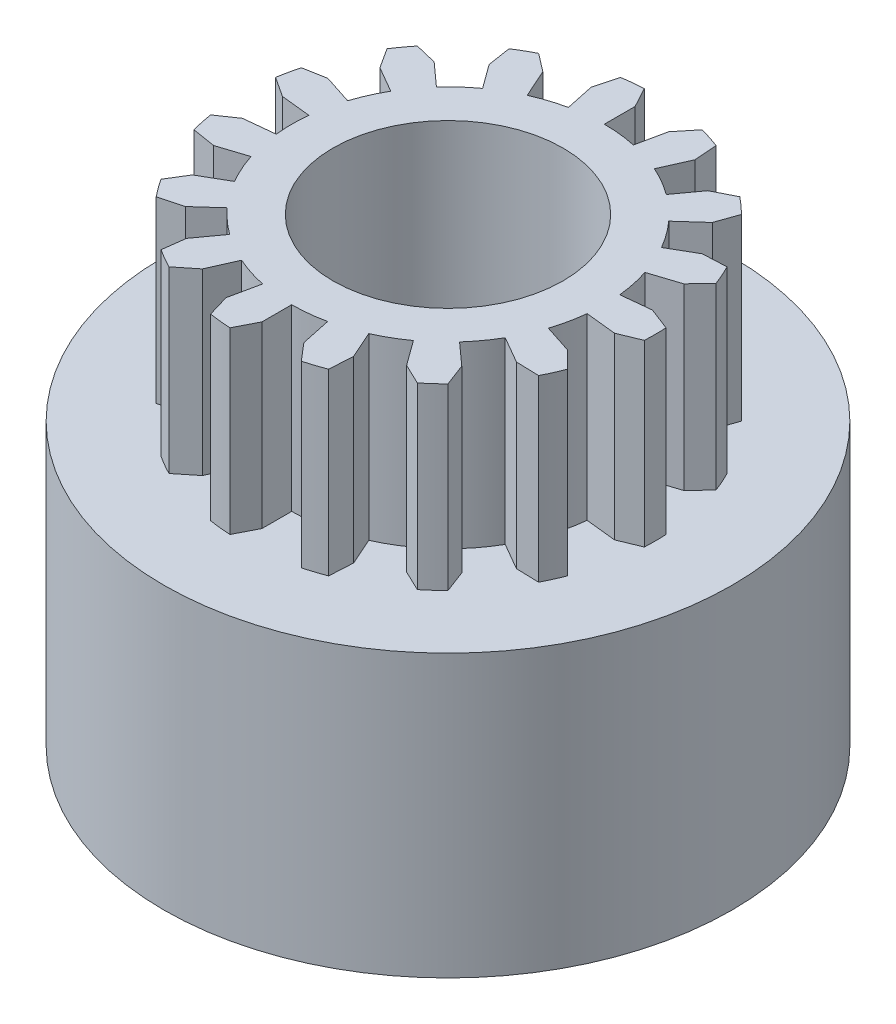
ISO-10303-21;
HEADER;
FILE_DESCRIPTION(('STEP AP214'),'2;1');
FILE_NAME('part.step','',(''),(''),'','','');
FILE_SCHEMA(('AUTOMOTIVE_DESIGN { 1 0 10303 214 1 1 1 1 }'));
ENDSEC;
DATA;
#1=APPLICATION_CONTEXT('core data for automotive mechanical design processes');
#2=APPLICATION_PROTOCOL_DEFINITION('international standard','automotive_design',2000,#1);
#3=PRODUCT_CONTEXT('',#1,'mechanical');
#4=PRODUCT('Part','Part','',(#3));
#5=PRODUCT_RELATED_PRODUCT_CATEGORY('part','',(#4));
#6=PRODUCT_DEFINITION_FORMATION('','',#4);
#7=PRODUCT_DEFINITION_CONTEXT('part definition',#1,'design');
#8=PRODUCT_DEFINITION('design','',#6,#7);
#9=PRODUCT_DEFINITION_SHAPE('','',#8);
#10=(LENGTH_UNIT() NAMED_UNIT(*) SI_UNIT(.MILLI.,.METRE.));
#11=(NAMED_UNIT(*) PLANE_ANGLE_UNIT() SI_UNIT($,.RADIAN.));
#12=(NAMED_UNIT(*) SI_UNIT($,.STERADIAN.) SOLID_ANGLE_UNIT());
#13=UNCERTAINTY_MEASURE_WITH_UNIT(LENGTH_MEASURE(1.E-05),#10,'distance_accuracy_value','');
#14=(GEOMETRIC_REPRESENTATION_CONTEXT(3) GLOBAL_UNCERTAINTY_ASSIGNED_CONTEXT((#13)) GLOBAL_UNIT_ASSIGNED_CONTEXT((#10,
#11,#12)) REPRESENTATION_CONTEXT('',''));
#15=CARTESIAN_POINT('',(0.,0.,0.));
#16=DIRECTION('',(0.,0.,1.));
#17=DIRECTION('',(1.,0.,0.));
#18=AXIS2_PLACEMENT_3D('',#15,#16,#17);
#19=CARTESIAN_POINT('',(11.1125,11.,0.));
#20=DIRECTION('',(0.,1.,0.));
#21=DIRECTION('',(0.,0.,1.));
#22=AXIS2_PLACEMENT_3D('',#19,#20,#21);
#23=PLANE('',#22);
#24=CARTESIAN_POINT('',(0.,11.,0.));
#25=DIRECTION('',(0.,-1.,0.));
#26=DIRECTION('',(0.,0.,-1.));
#27=AXIS2_PLACEMENT_3D('',#24,#25,#26);
#28=CIRCLE('',#27,11.1125);
#29=CARTESIAN_POINT('',(0.,11.,-11.1125));
#30=VERTEX_POINT('',#29);
#31=EDGE_CURVE('E11',#30,#30,#28,.T.);
#32=ORIENTED_EDGE('',*,*,#31,.F.);
#33=EDGE_LOOP('',(#32));
#34=FACE_BOUND('',#33,.T.);
#35=CARTESIAN_POINT('',(0.,11.,0.));
#36=DIRECTION('',(0.,1.,0.));
#37=DIRECTION('',(0.,0.,-1.));
#38=AXIS2_PLACEMENT_3D('',#35,#36,#37);
#39=CIRCLE('',#38,8.1125);
#40=CARTESIAN_POINT('',(8.10138210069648,11.,0.424575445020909));
#41=VERTEX_POINT('',#40);
#42=CARTESIAN_POINT('',(8.10138210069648,11.,-0.424575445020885));
#43=VERTEX_POINT('',#42);
#44=EDGE_CURVE('E622',#41,#43,#39,.T.);
#45=ORIENTED_EDGE('',*,*,#44,.F.);
#46=DIRECTION('',(0.924328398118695,0.,-0.381597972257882));
#47=VECTOR('',#46,1.);
#48=CARTESIAN_POINT('',(8.10138210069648,11.,0.424575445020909));
#49=LINE('',#48,#47);
#50=CARTESIAN_POINT('',(7.27713178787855,11.,0.764857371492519));
#51=VERTEX_POINT('',#50);
#52=EDGE_CURVE('E619',#51,#41,#49,.T.);
#53=ORIENTED_EDGE('',*,*,#52,.F.);
#54=DIRECTION('',(0.994521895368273,0.,0.104528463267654));
#55=VECTOR('',#54,1.);
#56=CARTESIAN_POINT('',(7.27713178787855,11.,0.764857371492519));
#57=LINE('',#56,#55);
#58=CARTESIAN_POINT('',(6.07901508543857,11.,0.63893023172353));
#59=VERTEX_POINT('',#58);
#60=EDGE_CURVE('E326',#59,#51,#57,.T.);
#61=ORIENTED_EDGE('',*,*,#60,.F.);
#62=CARTESIAN_POINT('',(0.,11.,0.));
#63=DIRECTION('',(0.,1.,0.));
#64=DIRECTION('',(0.,0.,-1.));
#65=AXIS2_PLACEMENT_3D('',#62,#63,#64);
#66=CIRCLE('',#65,6.1125);
#67=CARTESIAN_POINT('',(5.81333295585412,11.,1.88886637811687));
#68=VERTEX_POINT('',#67);
#69=EDGE_CURVE('E796',#68,#59,#66,.T.);
#70=ORIENTED_EDGE('',*,*,#69,.F.);
#71=DIRECTION('',(-0.951056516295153,0.,-0.309016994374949));
#72=VECTOR('',#71,1.);
#73=CARTESIAN_POINT('',(5.81333295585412,11.,1.88886637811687));
#74=LINE('',#73,#72);
#75=CARTESIAN_POINT('',(6.91804242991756,11.,2.24780824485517));
#76=VERTEX_POINT('',#75);
#77=EDGE_CURVE('E608',#76,#68,#74,.T.);
#78=ORIENTED_EDGE('',*,*,#77,.F.);
#79=DIRECTION('',(-0.705048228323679,0.,-0.709159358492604));
#80=VECTOR('',#79,1.);
#81=CARTESIAN_POINT('',(6.91804242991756,11.,2.24780824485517));
#82=LINE('',#81,#80);
#83=CARTESIAN_POINT('',(7.57367120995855,11.,2.90725999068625));
#84=VERTEX_POINT('',#83);
#85=EDGE_CURVE('E793',#84,#76,#82,.T.);
#86=ORIENTED_EDGE('',*,*,#85,.F.);
#87=CARTESIAN_POINT('',(0.,11.,0.));
#88=DIRECTION('',(0.,1.,0.));
#89=DIRECTION('',(0.,0.,-1.));
#90=AXIS2_PLACEMENT_3D('',#87,#88,#89);
#91=CIRCLE('',#90,8.1125);
#92=CARTESIAN_POINT('',(7.22829042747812,11.,3.68299792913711));
#93=VERTEX_POINT('',#92);
#94=EDGE_CURVE('E791',#93,#84,#91,.T.);
#95=ORIENTED_EDGE('',*,*,#94,.F.);
#96=DIRECTION('',(0.999625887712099,0.,0.0273511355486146));
#97=VECTOR('',#96,1.);
#98=CARTESIAN_POINT('',(7.22829042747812,11.,3.68299792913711));
#99=LINE('',#98,#97);
#100=CARTESIAN_POINT('',(6.33689516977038,11.,3.65860813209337));
#101=VERTEX_POINT('',#100);
#102=EDGE_CURVE('E789',#101,#93,#99,.T.);
#103=ORIENTED_EDGE('',*,*,#102,.F.);
#104=DIRECTION('',(0.866025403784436,0.,0.500000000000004));
#105=VECTOR('',#104,1.);
#106=CARTESIAN_POINT('',(6.33689516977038,11.,3.65860813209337));
#107=LINE('',#106,#105);
#108=CARTESIAN_POINT('',(5.29358028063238,11.,3.05625));
#109=VERTEX_POINT('',#108);
#110=EDGE_CURVE('E787',#109,#101,#107,.T.);
#111=ORIENTED_EDGE('',*,*,#110,.F.);
#112=CARTESIAN_POINT('',(0.,11.,0.));
#113=DIRECTION('',(0.,1.,0.));
#114=DIRECTION('',(0.,0.,-1.));
#115=AXIS2_PLACEMENT_3D('',#112,#113,#114);
#116=CIRCLE('',#115,6.1125);
#117=CARTESIAN_POINT('',(4.54247274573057,11.,4.09006083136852));
#118=VERTEX_POINT('',#117);
#119=EDGE_CURVE('E785',#118,#109,#116,.T.);
#120=ORIENTED_EDGE('',*,*,#119,.F.);
#121=DIRECTION('',(-0.743144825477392,0.,-0.66913060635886));
#122=VECTOR('',#121,1.);
#123=CARTESIAN_POINT('',(4.54247274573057,11.,4.09006083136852));
#124=LINE('',#123,#122);
#125=CARTESIAN_POINT('',(5.40568025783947,11.,4.86729636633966));
#126=VERTEX_POINT('',#125);
#127=EDGE_CURVE('E783',#126,#118,#124,.T.);
#128=ORIENTED_EDGE('',*,*,#127,.F.);
#129=DIRECTION('',(-0.355652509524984,0.,-0.934618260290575));
#130=VECTOR('',#129,1.);
#131=CARTESIAN_POINT('',(5.40568025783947,11.,4.86729636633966));
#132=LINE('',#131,#130);
#133=CARTESIAN_POINT('',(5.73640376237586,11.,5.73640376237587));
#134=VERTEX_POINT('',#133);
#135=EDGE_CURVE('E781',#134,#126,#132,.T.);
#136=ORIENTED_EDGE('',*,*,#135,.F.);
#137=CARTESIAN_POINT('',(0.,11.,0.));
#138=DIRECTION('',(0.,1.,0.));
#139=DIRECTION('',(0.,0.,-1.));
#140=AXIS2_PLACEMENT_3D('',#137,#138,#139);
#141=CIRCLE('',#140,8.1125);
#142=CARTESIAN_POINT('',(5.10536167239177,11.,6.3045966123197));
#143=VERTEX_POINT('',#142);
#144=EDGE_CURVE('E779',#143,#134,#141,.T.);
#145=ORIENTED_EDGE('',*,*,#144,.F.);
#146=DIRECTION('',(0.902078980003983,0.,0.431570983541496));
#147=VECTOR('',#146,1.);
#148=CARTESIAN_POINT('',(5.10536167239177,11.,6.3045966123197));
#149=LINE('',#148,#147);
#150=CARTESIAN_POINT('',(4.30095180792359,11.,5.91975230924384));
#151=VERTEX_POINT('',#150);
#152=EDGE_CURVE('E777',#151,#143,#149,.T.);
#153=ORIENTED_EDGE('',*,*,#152,.F.);
#154=DIRECTION('',(0.587785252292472,0.,0.809016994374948));
#155=VECTOR('',#154,1.);
#156=CARTESIAN_POINT('',(4.30095180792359,11.,5.91975230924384));
#157=LINE('',#156,#155);
#158=CARTESIAN_POINT('',(3.59283735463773,11.,4.94511637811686));
#159=VERTEX_POINT('',#158);
#160=EDGE_CURVE('E775',#159,#151,#157,.T.);
#161=ORIENTED_EDGE('',*,*,#160,.F.);
#162=CARTESIAN_POINT('',(0.,11.,0.));
#163=DIRECTION('',(0.,1.,0.));
#164=DIRECTION('',(0.,0.,-1.));
#165=AXIS2_PLACEMENT_3D('',#162,#163,#164);
#166=CIRCLE('',#165,6.11249999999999);
#167=CARTESIAN_POINT('',(2.48617773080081,11.,5.58404660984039));
#168=VERTEX_POINT('',#167);
#169=EDGE_CURVE('E773',#168,#159,#166,.T.);
#170=ORIENTED_EDGE('',*,*,#169,.F.);
#171=DIRECTION('',(-0.406736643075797,0.,-0.913545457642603));
#172=VECTOR('',#171,1.);
#173=CARTESIAN_POINT('',(2.48617773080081,11.,5.58404660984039));
#174=LINE('',#173,#172);
#175=CARTESIAN_POINT('',(2.95862686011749,11.,6.64518472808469));
#176=VERTEX_POINT('',#175);
#177=EDGE_CURVE('E771',#176,#168,#174,.T.);
#178=ORIENTED_EDGE('',*,*,#177,.F.);
#179=DIRECTION('',(0.0552387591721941,0.,-0.998473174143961));
#180=VECTOR('',#179,1.);
#181=CARTESIAN_POINT('',(2.95862686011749,11.,6.64518472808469));
#182=LINE('',#181,#180);
#183=CARTESIAN_POINT('',(2.90725999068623,11.,7.57367120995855));
#184=VERTEX_POINT('',#183);
#185=EDGE_CURVE('E769',#184,#176,#182,.T.);
#186=ORIENTED_EDGE('',*,*,#185,.F.);
#187=CARTESIAN_POINT('',(0.,11.,0.));
#188=DIRECTION('',(0.,1.,0.));
#189=DIRECTION('',(0.,0.,-1.));
#190=AXIS2_PLACEMENT_3D('',#187,#188,#189);
#191=CIRCLE('',#190,8.1125);
#192=CARTESIAN_POINT('',(2.09966950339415,11.,7.83607326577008));
#193=VERTEX_POINT('',#192);
#194=EDGE_CURVE('E767',#193,#184,#191,.T.);
#195=ORIENTED_EDGE('',*,*,#194,.F.);
#196=DIRECTION('',(0.648554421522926,0.,0.76116828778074));
#197=VECTOR('',#196,1.);
#198=CARTESIAN_POINT('',(2.09966950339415,11.,7.83607326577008));
#199=LINE('',#198,#197);
#200=CARTESIAN_POINT('',(1.52133480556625,11.,7.15731753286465));
#201=VERTEX_POINT('',#200);
#202=EDGE_CURVE('E765',#201,#193,#199,.T.);
#203=ORIENTED_EDGE('',*,*,#202,.F.);
#204=DIRECTION('',(0.207911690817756,0.,0.978147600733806));
#205=VECTOR('',#204,1.);
#206=CARTESIAN_POINT('',(1.52133480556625,11.,7.15731753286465));
#207=LINE('',#206,#205);
#208=CARTESIAN_POINT('',(1.27086021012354,11.,5.97892720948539));
#209=VERTEX_POINT('',#208);
#210=EDGE_CURVE('E763',#209,#201,#207,.T.);
#211=ORIENTED_EDGE('',*,*,#210,.F.);
#212=CARTESIAN_POINT('',(0.,11.,0.));
#213=DIRECTION('',(0.,1.,0.));
#214=DIRECTION('',(0.,0.,-1.));
#215=AXIS2_PLACEMENT_3D('',#212,#213,#214);
#216=CIRCLE('',#215,6.1125);
#217=CARTESIAN_POINT('',(0.,11.,6.1125));
#218=VERTEX_POINT('',#217);
#219=EDGE_CURVE('E761',#218,#209,#216,.T.);
#220=ORIENTED_EDGE('',*,*,#219,.F.);
#221=DIRECTION('',(0.,0.,-1.));
#222=VECTOR('',#221,1.);
#223=CARTESIAN_POINT('',(0.,11.,6.1125));
#224=LINE('',#223,#222);
#225=CARTESIAN_POINT('',(0.,11.,7.27406028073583));
#226=VERTEX_POINT('',#225);
#227=EDGE_CURVE('E759',#226,#218,#224,.T.);
#228=ORIENTED_EDGE('',*,*,#227,.F.);
#229=DIRECTION('',(0.456578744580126,0.,-0.889683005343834));
#230=VECTOR('',#229,1.);
#231=CARTESIAN_POINT('',(0.,11.,7.27406028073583));
#232=LINE('',#231,#230);
#233=CARTESIAN_POINT('',(-0.424575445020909,11.,8.10138210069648));
#234=VERTEX_POINT('',#233);
#235=EDGE_CURVE('E757',#234,#226,#232,.T.);
#236=ORIENTED_EDGE('',*,*,#235,.F.);
#237=CARTESIAN_POINT('',(0.,11.,0.));
#238=DIRECTION('',(0.,1.,0.));
#239=DIRECTION('',(0.,0.,-1.));
#240=AXIS2_PLACEMENT_3D('',#237,#238,#239);
#241=CIRCLE('',#240,8.1125);
#242=CARTESIAN_POINT('',(-1.26907459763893,11.,8.01262166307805));
#243=VERTEX_POINT('',#242);
#244=EDGE_CURVE('E755',#243,#234,#241,.T.);
#245=ORIENTED_EDGE('',*,*,#244,.F.);
#246=DIRECTION('',(0.282888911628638,0.,0.959152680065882));
#247=VECTOR('',#246,1.);
#248=CARTESIAN_POINT('',(-1.26907459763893,11.,8.01262166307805));
#249=LINE('',#248,#247);
#250=CARTESIAN_POINT('',(-1.52133480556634,11.,7.15731753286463));
#251=VERTEX_POINT('',#250);
#252=EDGE_CURVE('E753',#251,#243,#249,.T.);
#253=ORIENTED_EDGE('',*,*,#252,.F.);
#254=DIRECTION('',(-0.207911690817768,0.,0.978147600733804));
#255=VECTOR('',#254,1.);
#256=CARTESIAN_POINT('',(-1.52133480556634,11.,7.15731753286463));
#257=LINE('',#256,#255);
#258=CARTESIAN_POINT('',(-1.27086021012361,11.,5.97892720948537));
#259=VERTEX_POINT('',#258);
#260=EDGE_CURVE('E751',#259,#251,#257,.T.);
#261=ORIENTED_EDGE('',*,*,#260,.F.);
#262=CARTESIAN_POINT('',(0.,11.,0.));
#263=DIRECTION('',(0.,1.,0.));
#264=DIRECTION('',(0.,0.,-1.));
#265=AXIS2_PLACEMENT_3D('',#262,#263,#264);
#266=CIRCLE('',#265,6.11249999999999);
#267=CARTESIAN_POINT('',(-2.48617773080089,11.,5.58404660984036));
#268=VERTEX_POINT('',#267);
#269=EDGE_CURVE('E749',#268,#259,#266,.T.);
#270=ORIENTED_EDGE('',*,*,#269,.F.);
#271=DIRECTION('',(0.40673664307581,0.,-0.913545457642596));
#272=VECTOR('',#271,1.);
#273=CARTESIAN_POINT('',(-2.48617773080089,11.,5.58404660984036));
#274=LINE('',#273,#272);
#275=CARTESIAN_POINT('',(-2.95862686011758,11.,6.64518472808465));
#276=VERTEX_POINT('',#275);
#277=EDGE_CURVE('E747',#276,#268,#274,.T.);
#278=ORIENTED_EDGE('',*,*,#277,.F.);
#279=DIRECTION('',(0.778972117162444,0.,-0.627058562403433));
#280=VECTOR('',#279,1.);
#281=CARTESIAN_POINT('',(-2.95862686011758,11.,6.64518472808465));
#282=LINE('',#281,#280);
#283=CARTESIAN_POINT('',(-3.68299792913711,11.,7.22829042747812));
#284=VERTEX_POINT('',#283);
#285=EDGE_CURVE('E745',#284,#276,#282,.T.);
#286=ORIENTED_EDGE('',*,*,#285,.F.);
#287=CARTESIAN_POINT('',(0.,11.,0.));
#288=DIRECTION('',(0.,1.,0.));
#289=DIRECTION('',(0.,0.,-1.));
#290=AXIS2_PLACEMENT_3D('',#287,#288,#289);
#291=CIRCLE('',#290,8.1125);
#292=CARTESIAN_POINT('',(-4.41838417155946,11.,6.80371498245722));
#293=VERTEX_POINT('',#292);
#294=EDGE_CURVE('E743',#293,#284,#291,.T.);
#295=ORIENTED_EDGE('',*,*,#294,.F.);
#296=DIRECTION('',(-0.131690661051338,0.,0.991290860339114));
#297=VECTOR('',#296,1.);
#298=CARTESIAN_POINT('',(-4.41838417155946,11.,6.80371498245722));
#299=LINE('',#298,#297);
#300=CARTESIAN_POINT('',(-4.30095180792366,11.,5.91975230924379));
#301=VERTEX_POINT('',#300);
#302=EDGE_CURVE('E741',#301,#293,#299,.T.);
#303=ORIENTED_EDGE('',*,*,#302,.F.);
#304=DIRECTION('',(-0.587785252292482,0.,0.809016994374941));
#305=VECTOR('',#304,1.);
#306=CARTESIAN_POINT('',(-4.30095180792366,11.,5.91975230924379));
#307=LINE('',#306,#305);
#308=CARTESIAN_POINT('',(-3.5928373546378,11.,4.94511637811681));
#309=VERTEX_POINT('',#308);
#310=EDGE_CURVE('E739',#309,#301,#307,.T.);
#311=ORIENTED_EDGE('',*,*,#310,.F.);
#312=CARTESIAN_POINT('',(0.,11.,0.));
#313=DIRECTION('',(0.,1.,0.));
#314=DIRECTION('',(0.,0.,-1.));
#315=AXIS2_PLACEMENT_3D('',#312,#313,#314);
#316=CIRCLE('',#315,6.11249999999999);
#317=CARTESIAN_POINT('',(-4.54247274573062,11.,4.09006083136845));
#318=VERTEX_POINT('',#317);
#319=EDGE_CURVE('E737',#318,#309,#316,.T.);
#320=ORIENTED_EDGE('',*,*,#319,.F.);
#321=DIRECTION('',(0.743144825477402,0.,-0.669130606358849));
#322=VECTOR('',#321,1.);
#323=CARTESIAN_POINT('',(-4.54247274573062,11.,4.09006083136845));
#324=LINE('',#323,#322);
#325=CARTESIAN_POINT('',(-5.40568025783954,11.,4.86729636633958));
#326=VERTEX_POINT('',#325);
#327=EDGE_CURVE('E735',#326,#318,#324,.T.);
#328=ORIENTED_EDGE('',*,*,#327,.F.);
#329=DIRECTION('',(0.966674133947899,0.,-0.256009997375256));
#330=VECTOR('',#329,1.);
#331=CARTESIAN_POINT('',(-5.40568025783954,11.,4.86729636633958));
#332=LINE('',#331,#330);
#333=CARTESIAN_POINT('',(-6.3045966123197,11.,5.10536167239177));
#334=VERTEX_POINT('',#333);
#335=EDGE_CURVE('E733',#334,#326,#332,.T.);
#336=ORIENTED_EDGE('',*,*,#335,.F.);
#337=CARTESIAN_POINT('',(0.,11.,0.));
#338=DIRECTION('',(0.,1.,0.));
#339=DIRECTION('',(0.,0.,-1.));
#340=AXIS2_PLACEMENT_3D('',#337,#338,#339);
#341=CIRCLE('',#340,8.1125);
#342=CARTESIAN_POINT('',(-6.80371498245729,11.,4.41838417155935));
#343=VERTEX_POINT('',#342);
#344=EDGE_CURVE('E731',#343,#334,#341,.T.);
#345=ORIENTED_EDGE('',*,*,#344,.F.);
#346=DIRECTION('',(-0.523499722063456,0.,0.852025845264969));
#347=VECTOR('',#346,1.);
#348=CARTESIAN_POINT('',(-6.80371498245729,11.,4.41838417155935));
#349=LINE('',#348,#347);
#350=CARTESIAN_POINT('',(-6.33689516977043,11.,3.65860813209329));
#351=VERTEX_POINT('',#350);
#352=EDGE_CURVE('E729',#351,#343,#349,.T.);
#353=ORIENTED_EDGE('',*,*,#352,.F.);
#354=DIRECTION('',(-0.866025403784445,0.,0.499999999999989));
#355=VECTOR('',#354,1.);
#356=CARTESIAN_POINT('',(-6.33689516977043,11.,3.65860813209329));
#357=LINE('',#356,#355);
#358=CARTESIAN_POINT('',(-5.29358028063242,11.,3.05624999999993));
#359=VERTEX_POINT('',#358);
#360=EDGE_CURVE('E727',#359,#351,#357,.T.);
#361=ORIENTED_EDGE('',*,*,#360,.F.);
#362=CARTESIAN_POINT('',(0.,11.,0.));
#363=DIRECTION('',(0.,1.,0.));
#364=DIRECTION('',(0.,0.,-1.));
#365=AXIS2_PLACEMENT_3D('',#362,#363,#364);
#366=CIRCLE('',#365,6.11249999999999);
#367=CARTESIAN_POINT('',(-5.81333295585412,11.,1.88886637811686));
#368=VERTEX_POINT('',#367);
#369=EDGE_CURVE('E725',#368,#359,#366,.T.);
#370=ORIENTED_EDGE('',*,*,#369,.F.);
#371=DIRECTION('',(0.951056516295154,0.,-0.309016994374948));
#372=VECTOR('',#371,1.);
#373=CARTESIAN_POINT('',(-5.81333295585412,11.,1.88886637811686));
#374=LINE('',#373,#372);
#375=CARTESIAN_POINT('',(-6.91804242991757,11.,2.24780824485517));
#376=VERTEX_POINT('',#375);
#377=EDGE_CURVE('E723',#376,#368,#374,.T.);
#378=ORIENTED_EDGE('',*,*,#377,.F.);
#379=DIRECTION('',(0.987229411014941,0.,0.159305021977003));
#380=VECTOR('',#379,1.);
#381=CARTESIAN_POINT('',(-6.91804242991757,11.,2.24780824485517));
#382=LINE('',#381,#380);
#383=CARTESIAN_POINT('',(-7.83607326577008,11.,2.09966950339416));
#384=VERTEX_POINT('',#383);
#385=EDGE_CURVE('E721',#384,#376,#382,.T.);
#386=ORIENTED_EDGE('',*,*,#385,.F.);
#387=CARTESIAN_POINT('',(0.,11.,0.));
#388=DIRECTION('',(0.,1.,0.));
#389=DIRECTION('',(0.,0.,-1.));
#390=AXIS2_PLACEMENT_3D('',#387,#388,#389);
#391=CIRCLE('',#390,8.1125);
#392=CARTESIAN_POINT('',(-8.01262166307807,11.,1.2690745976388));
#393=VERTEX_POINT('',#392);
#394=EDGE_CURVE('E719',#393,#384,#391,.T.);
#395=ORIENTED_EDGE('',*,*,#394,.F.);
#396=DIRECTION('',(-0.824790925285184,0.,0.565437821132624));
#397=VECTOR('',#396,1.);
#398=CARTESIAN_POINT('',(-8.01262166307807,11.,1.26907459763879));
#399=LINE('',#398,#397);
#400=CARTESIAN_POINT('',(-7.27713178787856,11.,0.764857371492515));
#401=VERTEX_POINT('',#400);
#402=EDGE_CURVE('E717',#401,#393,#399,.T.);
#403=ORIENTED_EDGE('',*,*,#402,.F.);
#404=DIRECTION('',(-0.994521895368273,0.,0.104528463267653));
#405=VECTOR('',#404,1.);
#406=CARTESIAN_POINT('',(-7.27713178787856,11.,0.764857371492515));
#407=LINE('',#406,#405);
#408=CARTESIAN_POINT('',(-6.07901508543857,11.,0.638930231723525));
#409=VERTEX_POINT('',#408);
#410=EDGE_CURVE('E715',#409,#401,#407,.T.);
#411=ORIENTED_EDGE('',*,*,#410,.F.);
#412=CARTESIAN_POINT('',(0.,11.,0.));
#413=DIRECTION('',(0.,1.,0.));
#414=DIRECTION('',(0.,0.,-1.));
#415=AXIS2_PLACEMENT_3D('',#412,#413,#414);
#416=CIRCLE('',#415,6.11249999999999);
#417=CARTESIAN_POINT('',(-6.07901508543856,11.,-0.638930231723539));
#418=VERTEX_POINT('',#417);
#419=EDGE_CURVE('E713',#418,#409,#416,.T.);
#420=ORIENTED_EDGE('',*,*,#419,.F.);
#421=DIRECTION('',(0.994521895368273,0.,0.104528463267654));
#422=VECTOR('',#421,1.);
#423=CARTESIAN_POINT('',(-6.07901508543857,11.,-0.638930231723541));
#424=LINE('',#423,#422);
#425=CARTESIAN_POINT('',(-7.23421221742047,11.,-0.760346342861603));
#426=VERTEX_POINT('',#425);
#427=EDGE_CURVE('E711',#426,#418,#424,.T.);
#428=ORIENTED_EDGE('',*,*,#427,.F.);
#429=DIRECTION('',(0.837083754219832,0.,0.547074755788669));
#430=VECTOR('',#429,1.);
#431=CARTESIAN_POINT('',(-7.23421221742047,11.,-0.760346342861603));
#432=LINE('',#431,#430);
#433=CARTESIAN_POINT('',(-8.01262166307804,11.,-1.26907459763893));
#434=VERTEX_POINT('',#433);
#435=EDGE_CURVE('E709',#434,#426,#432,.T.);
#436=ORIENTED_EDGE('',*,*,#435,.F.);
#437=CARTESIAN_POINT('',(0.,11.,0.));
#438=DIRECTION('',(0.,1.,0.));
#439=DIRECTION('',(0.,0.,-1.));
#440=AXIS2_PLACEMENT_3D('',#437,#438,#439);
#441=CIRCLE('',#440,8.1125);
#442=CARTESIAN_POINT('',(-7.83607326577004,11.,-2.09966950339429));
#443=VERTEX_POINT('',#442);
#444=EDGE_CURVE('E707',#443,#434,#441,.T.);
#445=ORIENTED_EDGE('',*,*,#444,.F.);
#446=DIRECTION('',(-0.983468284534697,0.,0.181080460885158));
#447=VECTOR('',#446,1.);
#448=CARTESIAN_POINT('',(-7.83607326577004,11.,-2.09966950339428));
#449=LINE('',#448,#447);
#450=CARTESIAN_POINT('',(-6.95908620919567,11.,-2.26114417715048));
#451=VERTEX_POINT('',#450);
#452=EDGE_CURVE('E705',#451,#443,#449,.T.);
#453=ORIENTED_EDGE('',*,*,#452,.F.);
#454=DIRECTION('',(-0.951056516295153,0.,-0.309016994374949));
#455=VECTOR('',#454,1.);
#456=CARTESIAN_POINT('',(-6.95908620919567,11.,-2.26114417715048));
#457=LINE('',#456,#455);
#458=CARTESIAN_POINT('',(-5.81333295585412,11.,-1.88886637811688));
#459=VERTEX_POINT('',#458);
#460=EDGE_CURVE('E703',#459,#451,#457,.T.);
#461=ORIENTED_EDGE('',*,*,#460,.F.);
#462=CARTESIAN_POINT('',(0.,11.,0.));
#463=DIRECTION('',(0.,1.,0.));
#464=DIRECTION('',(0.,0.,-1.));
#465=AXIS2_PLACEMENT_3D('',#462,#463,#464);
#466=CIRCLE('',#465,6.1125);
#467=CARTESIAN_POINT('',(-5.29358028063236,11.,-3.05625000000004));
#468=VERTEX_POINT('',#467);
#469=EDGE_CURVE('E701',#468,#459,#466,.T.);
#470=ORIENTED_EDGE('',*,*,#469,.F.);
#471=DIRECTION('',(0.866025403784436,0.,0.500000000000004));
#472=VECTOR('',#471,1.);
#473=CARTESIAN_POINT('',(-5.29358028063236,11.,-3.05625000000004));
#474=LINE('',#473,#472);
#475=CARTESIAN_POINT('',(-6.29952099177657,11.,-3.63703014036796));
#476=VERTEX_POINT('',#475);
#477=EDGE_CURVE('E699',#476,#468,#474,.T.);
#478=ORIENTED_EDGE('',*,*,#477,.F.);
#479=DIRECTION('',(0.542198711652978,0.,0.840250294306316));
#480=VECTOR('',#479,1.);
#481=CARTESIAN_POINT('',(-6.29952099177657,11.,-3.63703014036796));
#482=LINE('',#481,#480);
#483=CARTESIAN_POINT('',(-6.80371498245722,11.,-4.41838417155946));
#484=VERTEX_POINT('',#483);
#485=EDGE_CURVE('E697',#484,#476,#482,.T.);
#486=ORIENTED_EDGE('',*,*,#485,.F.);
#487=CARTESIAN_POINT('',(0.,11.,0.));
#488=DIRECTION('',(0.,1.,0.));
#489=DIRECTION('',(0.,0.,-1.));
#490=AXIS2_PLACEMENT_3D('',#487,#488,#489);
#491=CIRCLE('',#490,8.1125);
#492=CARTESIAN_POINT('',(-6.30459661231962,11.,-5.10536167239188));
#493=VERTEX_POINT('',#492);
#494=EDGE_CURVE('E695',#493,#484,#491,.T.);
#495=ORIENTED_EDGE('',*,*,#494,.F.);
#496=DIRECTION('',(-0.972095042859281,0.,-0.234587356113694));
#497=VECTOR('',#496,1.);
#498=CARTESIAN_POINT('',(-6.30459661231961,11.,-5.10536167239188));
#499=LINE('',#498,#497);
#500=CARTESIAN_POINT('',(-5.4377514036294,11.,-4.89617335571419));
#501=VERTEX_POINT('',#500);
#502=EDGE_CURVE('E693',#501,#493,#499,.T.);
#503=ORIENTED_EDGE('',*,*,#502,.F.);
#504=DIRECTION('',(-0.743144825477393,0.,-0.66913060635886));
#505=VECTOR('',#504,1.);
#506=CARTESIAN_POINT('',(-5.4377514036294,11.,-4.89617335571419));
#507=LINE('',#506,#505);
#508=CARTESIAN_POINT('',(-4.54247274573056,11.,-4.09006083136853));
#509=VERTEX_POINT('',#508);
#510=EDGE_CURVE('E691',#509,#501,#507,.T.);
#511=ORIENTED_EDGE('',*,*,#510,.F.);
#512=CARTESIAN_POINT('',(0.,11.,0.));
#513=DIRECTION('',(0.,1.,0.));
#514=DIRECTION('',(0.,0.,-1.));
#515=AXIS2_PLACEMENT_3D('',#512,#513,#514);
#516=CIRCLE('',#515,6.1125);
#517=CARTESIAN_POINT('',(-3.59283735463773,11.,-4.94511637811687));
#518=VERTEX_POINT('',#517);
#519=EDGE_CURVE('E689',#518,#509,#516,.T.);
#520=ORIENTED_EDGE('',*,*,#519,.F.);
#521=DIRECTION('',(0.587785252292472,0.,0.809016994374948));
#522=VECTOR('',#521,1.);
#523=CARTESIAN_POINT('',(-3.59283735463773,11.,-4.94511637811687));
#524=LINE('',#523,#522);
#525=CARTESIAN_POINT('',(-4.27558535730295,11.,-5.88483838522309));
#526=VERTEX_POINT('',#525);
#527=EDGE_CURVE('E687',#526,#518,#524,.T.);
#528=ORIENTED_EDGE('',*,*,#527,.F.);
#529=DIRECTION('',(0.153562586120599,0.,0.988138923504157));
#530=VECTOR('',#529,1.);
#531=CARTESIAN_POINT('',(-4.27558535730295,11.,-5.88483838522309));
#532=LINE('',#531,#530);
#533=CARTESIAN_POINT('',(-4.41838417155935,11.,-6.80371498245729));
#534=VERTEX_POINT('',#533);
#535=EDGE_CURVE('E685',#534,#526,#532,.T.);
#536=ORIENTED_EDGE('',*,*,#535,.F.);
#537=CARTESIAN_POINT('',(0.,11.,0.));
#538=DIRECTION('',(0.,1.,0.));
#539=DIRECTION('',(0.,0.,-1.));
#540=AXIS2_PLACEMENT_3D('',#537,#538,#539);
#541=CIRCLE('',#540,8.1125);
#542=CARTESIAN_POINT('',(-3.68299792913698,11.,-7.22829042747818));
#543=VERTEX_POINT('',#542);
#544=EDGE_CURVE('E683',#543,#534,#541,.T.);
#545=ORIENTED_EDGE('',*,*,#544,.F.);
#546=DIRECTION('',(-0.792637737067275,0.,-0.609692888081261));
#547=VECTOR('',#546,1.);
#548=CARTESIAN_POINT('',(-3.68299792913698,11.,-7.22829042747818));
#549=LINE('',#548,#547);
#550=CARTESIAN_POINT('',(-2.97617997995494,11.,-6.68460968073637));
#551=VERTEX_POINT('',#550);
#552=EDGE_CURVE('E681',#551,#543,#549,.T.);
#553=ORIENTED_EDGE('',*,*,#552,.F.);
#554=DIRECTION('',(-0.406736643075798,0.,-0.913545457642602));
#555=VECTOR('',#554,1.);
#556=CARTESIAN_POINT('',(-2.97617997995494,11.,-6.68460968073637));
#557=LINE('',#556,#555);
#558=CARTESIAN_POINT('',(-2.48617773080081,11.,-5.58404660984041));
#559=VERTEX_POINT('',#558);
#560=EDGE_CURVE('E679',#559,#551,#557,.T.);
#561=ORIENTED_EDGE('',*,*,#560,.F.);
#562=CARTESIAN_POINT('',(0.,11.,0.));
#563=DIRECTION('',(0.,1.,0.));
#564=DIRECTION('',(0.,0.,-1.));
#565=AXIS2_PLACEMENT_3D('',#562,#563,#564);
#566=CIRCLE('',#565,6.1125);
#567=CARTESIAN_POINT('',(-1.27086021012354,11.,-5.97892720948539));
#568=VERTEX_POINT('',#567);
#569=EDGE_CURVE('E677',#568,#559,#566,.T.);
#570=ORIENTED_EDGE('',*,*,#569,.F.);
#571=DIRECTION('',(0.207911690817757,0.,0.978147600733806));
#572=VECTOR('',#571,1.);
#573=CARTESIAN_POINT('',(-1.27086021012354,11.,-5.97892720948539));
#574=LINE('',#573,#572);
#575=CARTESIAN_POINT('',(-1.51236217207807,11.,-7.11510461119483));
#576=VERTEX_POINT('',#575);
#577=EDGE_CURVE('E675',#576,#568,#574,.T.);
#578=ORIENTED_EDGE('',*,*,#577,.F.);
#579=DIRECTION('',(-0.261625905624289,0.,0.965169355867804));
#580=VECTOR('',#579,1.);
#581=CARTESIAN_POINT('',(-1.51236217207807,11.,-7.11510461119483));
#582=LINE('',#581,#580);
#583=CARTESIAN_POINT('',(-1.2690745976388,11.,-8.01262166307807));
#584=VERTEX_POINT('',#583);
#585=EDGE_CURVE('E673',#584,#576,#582,.T.);
#586=ORIENTED_EDGE('',*,*,#585,.F.);
#587=CARTESIAN_POINT('',(0.,11.,0.));
#588=DIRECTION('',(0.,1.,0.));
#589=DIRECTION('',(0.,0.,-1.));
#590=AXIS2_PLACEMENT_3D('',#587,#588,#589);
#591=CIRCLE('',#590,8.1125);
#592=CARTESIAN_POINT('',(-0.424575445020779,11.,-8.10138210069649));
#593=VERTEX_POINT('',#592);
#594=EDGE_CURVE('E671',#593,#584,#591,.T.);
#595=ORIENTED_EDGE('',*,*,#594,.F.);
#596=DIRECTION('',(-0.476126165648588,0.,-0.879376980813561));
#597=VECTOR('',#596,1.);
#598=CARTESIAN_POINT('',(-0.424575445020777,11.,-8.10138210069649));
#599=LINE('',#598,#597);
#600=CARTESIAN_POINT('',(0.,11.,-7.31721626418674));
#601=VERTEX_POINT('',#600);
#602=EDGE_CURVE('E669',#601,#593,#599,.T.);
#603=ORIENTED_EDGE('',*,*,#602,.F.);
#604=DIRECTION('',(0.,0.,-1.));
#605=VECTOR('',#604,1.);
#606=CARTESIAN_POINT('',(0.,11.,-7.31721626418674));
#607=LINE('',#606,#605);
#608=CARTESIAN_POINT('',(0.,11.,-6.1125));
#609=VERTEX_POINT('',#608);
#610=EDGE_CURVE('E667',#609,#601,#607,.T.);
#611=ORIENTED_EDGE('',*,*,#610,.F.);
#612=CARTESIAN_POINT('',(0.,11.,0.));
#613=DIRECTION('',(0.,1.,0.));
#614=DIRECTION('',(0.,0.,-1.));
#615=AXIS2_PLACEMENT_3D('',#612,#613,#614);
#616=CIRCLE('',#615,6.1125);
#617=CARTESIAN_POINT('',(1.27086021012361,11.,-5.97892720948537));
#618=VERTEX_POINT('',#617);
#619=EDGE_CURVE('E665',#618,#609,#616,.T.);
#620=ORIENTED_EDGE('',*,*,#619,.F.);
#621=DIRECTION('',(-0.207911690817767,0.,0.978147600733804));
#622=VECTOR('',#621,1.);
#623=CARTESIAN_POINT('',(1.27086021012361,11.,-5.97892720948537));
#624=LINE('',#623,#622);
#625=CARTESIAN_POINT('',(1.51236217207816,11.,-7.11510461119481));
#626=VERTEX_POINT('',#625);
#627=EDGE_CURVE('E663',#626,#618,#624,.T.);
#628=ORIENTED_EDGE('',*,*,#627,.F.);
#629=DIRECTION('',(-0.631576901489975,0.,0.775313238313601));
#630=VECTOR('',#629,1.);
#631=CARTESIAN_POINT('',(1.51236217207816,11.,-7.11510461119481));
#632=LINE('',#631,#630);
#633=CARTESIAN_POINT('',(2.09966950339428,11.,-7.83607326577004));
#634=VERTEX_POINT('',#633);
#635=EDGE_CURVE('E661',#634,#626,#632,.T.);
#636=ORIENTED_EDGE('',*,*,#635,.F.);
#637=CARTESIAN_POINT('',(0.,11.,0.));
#638=DIRECTION('',(0.,1.,0.));
#639=DIRECTION('',(0.,0.,-1.));
#640=AXIS2_PLACEMENT_3D('',#637,#638,#639);
#641=CIRCLE('',#640,8.1125);
#642=CARTESIAN_POINT('',(2.90725999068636,11.,-7.5736712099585));
#643=VERTEX_POINT('',#642);
#644=EDGE_CURVE('E659',#643,#634,#641,.T.);
#645=ORIENTED_EDGE('',*,*,#644,.F.);
#646=DIRECTION('',(-0.0772880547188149,0.,-0.997008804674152));
#647=VECTOR('',#646,1.);
#648=CARTESIAN_POINT('',(2.90725999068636,11.,-7.57367120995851));
#649=LINE('',#648,#647);
#650=CARTESIAN_POINT('',(2.97617997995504,11.,-6.68460968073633));
#651=VERTEX_POINT('',#650);
#652=EDGE_CURVE('E657',#651,#643,#649,.T.);
#653=ORIENTED_EDGE('',*,*,#652,.F.);
#654=DIRECTION('',(0.406736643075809,0.,-0.913545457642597));
#655=VECTOR('',#654,1.);
#656=CARTESIAN_POINT('',(2.97617997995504,11.,-6.68460968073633));
#657=LINE('',#656,#655);
#658=CARTESIAN_POINT('',(2.48617773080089,11.,-5.58404660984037));
#659=VERTEX_POINT('',#658);
#660=EDGE_CURVE('E655',#659,#651,#657,.T.);
#661=ORIENTED_EDGE('',*,*,#660,.F.);
#662=CARTESIAN_POINT('',(0.,11.,0.));
#663=DIRECTION('',(0.,1.,0.));
#664=DIRECTION('',(0.,0.,-1.));
#665=AXIS2_PLACEMENT_3D('',#662,#663,#664);
#666=CIRCLE('',#665,6.1125);
#667=CARTESIAN_POINT('',(3.5928373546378,11.,-4.94511637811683));
#668=VERTEX_POINT('',#667);
#669=EDGE_CURVE('E653',#668,#659,#666,.T.);
#670=ORIENTED_EDGE('',*,*,#669,.F.);
#671=DIRECTION('',(-0.587785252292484,0.,0.80901699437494));
#672=VECTOR('',#671,1.);
#673=CARTESIAN_POINT('',(3.5928373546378,11.,-4.94511637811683));
#674=LINE('',#673,#672);
#675=CARTESIAN_POINT('',(4.27558535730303,11.,-5.88483838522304));
#676=VERTEX_POINT('',#675);
#677=EDGE_CURVE('E651',#676,#668,#674,.T.);
#678=ORIENTED_EDGE('',*,*,#677,.F.);
#679=DIRECTION('',(-0.892322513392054,0.,0.451398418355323));
#680=VECTOR('',#679,1.);
#681=CARTESIAN_POINT('',(4.27558535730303,11.,-5.88483838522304));
#682=LINE('',#681,#680);
#683=CARTESIAN_POINT('',(5.10536167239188,11.,-6.30459661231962));
#684=VERTEX_POINT('',#683);
#685=EDGE_CURVE('E649',#684,#676,#682,.T.);
#686=ORIENTED_EDGE('',*,*,#685,.F.);
#687=CARTESIAN_POINT('',(0.,11.,0.));
#688=DIRECTION('',(0.,1.,0.));
#689=DIRECTION('',(0.,0.,-1.));
#690=AXIS2_PLACEMENT_3D('',#687,#688,#689);
#691=CIRCLE('',#690,8.1125);
#692=CARTESIAN_POINT('',(5.73640376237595,11.,-5.73640376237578));
#693=VERTEX_POINT('',#692);
#694=EDGE_CURVE('E647',#693,#684,#691,.T.);
#695=ORIENTED_EDGE('',*,*,#694,.F.);
#696=DIRECTION('',(0.334913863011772,0.,-0.942248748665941));
#697=VECTOR('',#696,1.);
#698=CARTESIAN_POINT('',(5.73640376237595,11.,-5.73640376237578));
#699=LINE('',#698,#697);
#700=CARTESIAN_POINT('',(5.43775140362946,11.,-4.89617335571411));
#701=VERTEX_POINT('',#700);
#702=EDGE_CURVE('E645',#701,#693,#699,.T.);
#703=ORIENTED_EDGE('',*,*,#702,.F.);
#704=DIRECTION('',(0.743144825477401,0.,-0.66913060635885));
#705=VECTOR('',#704,1.);
#706=CARTESIAN_POINT('',(5.43775140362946,11.,-4.89617335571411));
#707=LINE('',#706,#705);
#708=CARTESIAN_POINT('',(4.54247274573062,11.,-4.09006083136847));
#709=VERTEX_POINT('',#708);
#710=EDGE_CURVE('E643',#709,#701,#707,.T.);
#711=ORIENTED_EDGE('',*,*,#710,.F.);
#712=CARTESIAN_POINT('',(0.,11.,0.));
#713=DIRECTION('',(0.,1.,0.));
#714=DIRECTION('',(0.,0.,-1.));
#715=AXIS2_PLACEMENT_3D('',#712,#713,#714);
#716=CIRCLE('',#715,6.1125);
#717=CARTESIAN_POINT('',(5.29358028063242,11.,-3.05624999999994));
#718=VERTEX_POINT('',#717);
#719=EDGE_CURVE('E641',#718,#709,#716,.T.);
#720=ORIENTED_EDGE('',*,*,#719,.F.);
#721=DIRECTION('',(-0.866025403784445,0.,0.499999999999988));
#722=VECTOR('',#721,1.);
#723=CARTESIAN_POINT('',(5.29358028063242,11.,-3.05624999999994));
#724=LINE('',#723,#722);
#725=CARTESIAN_POINT('',(6.29952099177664,11.,-3.63703014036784));
#726=VERTEX_POINT('',#725);
#727=EDGE_CURVE('E639',#726,#718,#724,.T.);
#728=ORIENTED_EDGE('',*,*,#727,.F.);
#729=DIRECTION('',(-0.99877745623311,0.,0.0494327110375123));
#730=VECTOR('',#729,1.);
#731=CARTESIAN_POINT('',(6.29952099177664,11.,-3.63703014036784));
#732=LINE('',#731,#730);
#733=CARTESIAN_POINT('',(7.22829042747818,11.,-3.68299792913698));
#734=VERTEX_POINT('',#733);
#735=EDGE_CURVE('E637',#734,#726,#732,.T.);
#736=ORIENTED_EDGE('',*,*,#735,.F.);
#737=CARTESIAN_POINT('',(0.,11.,0.));
#738=DIRECTION('',(0.,1.,0.));
#739=DIRECTION('',(0.,0.,-1.));
#740=AXIS2_PLACEMENT_3D('',#737,#738,#739);
#741=CIRCLE('',#740,8.1125);
#742=CARTESIAN_POINT('',(7.57367120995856,11.,-2.90725999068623));
#743=VERTEX_POINT('',#742);
#744=EDGE_CURVE('E635',#743,#734,#741,.T.);
#745=ORIENTED_EDGE('',*,*,#744,.F.);
#746=DIRECTION('',(0.689206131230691,0.,-0.724565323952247));
#747=VECTOR('',#746,1.);
#748=CARTESIAN_POINT('',(7.57367120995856,11.,-2.90725999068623));
#749=LINE('',#748,#747);
#750=CARTESIAN_POINT('',(6.95908620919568,11.,-2.26114417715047));
#751=VERTEX_POINT('',#750);
#752=EDGE_CURVE('E633',#751,#743,#749,.T.);
#753=ORIENTED_EDGE('',*,*,#752,.F.);
#754=DIRECTION('',(0.951056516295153,0.,-0.309016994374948));
#755=VECTOR('',#754,1.);
#756=CARTESIAN_POINT('',(6.95908620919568,11.,-2.26114417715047));
#757=LINE('',#756,#755);
#758=CARTESIAN_POINT('',(5.81333295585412,11.,-1.88886637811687));
#759=VERTEX_POINT('',#758);
#760=EDGE_CURVE('E631',#759,#751,#757,.T.);
#761=ORIENTED_EDGE('',*,*,#760,.F.);
#762=CARTESIAN_POINT('',(0.,11.,0.));
#763=DIRECTION('',(0.,1.,0.));
#764=DIRECTION('',(0.,0.,-1.));
#765=AXIS2_PLACEMENT_3D('',#762,#763,#764);
#766=CIRCLE('',#765,6.1125);
#767=CARTESIAN_POINT('',(6.07901508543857,11.,-0.638930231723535));
#768=VERTEX_POINT('',#767);
#769=EDGE_CURVE('E629',#768,#759,#766,.T.);
#770=ORIENTED_EDGE('',*,*,#769,.F.);
#771=DIRECTION('',(-0.994521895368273,0.,0.104528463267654));
#772=VECTOR('',#771,1.);
#773=CARTESIAN_POINT('',(6.07901508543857,11.,-0.638930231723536));
#774=LINE('',#773,#772);
#775=CARTESIAN_POINT('',(7.23421221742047,11.,-0.760346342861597));
#776=VERTEX_POINT('',#775);
#777=EDGE_CURVE('E627',#776,#768,#774,.T.);
#778=ORIENTED_EDGE('',*,*,#777,.F.);
#779=DIRECTION('',(-0.932534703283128,0.,-0.361080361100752));
#780=VECTOR('',#779,1.);
#781=CARTESIAN_POINT('',(7.23421221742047,11.,-0.760346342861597));
#782=LINE('',#781,#780);
#783=EDGE_CURVE('E625',#43,#776,#782,.T.);
#784=ORIENTED_EDGE('',*,*,#783,.F.);
#785=EDGE_LOOP('',(#45,#53,#61,#70,#78,#86,#95,#103,#111,#120,#128,#136,#145,#153,#161,#170,
#178,#186,#195,#203,#211,#220,#228,#236,#245,#253,#261,#270,#278,#286,#295,#303,#311,#320,#328,
#336,#345,#353,#361,#370,#378,#386,#395,#403,#411,#420,#428,#436,#445,#453,#461,#470,#478,#486,
#495,#503,#511,#520,#528,#536,#545,#553,#561,#570,#578,#586,#595,#603,#611,#620,#628,#636,#645,
#653,#661,#670,#678,#686,#695,#703,#711,#720,#728,#736,#745,#753,#761,#770,#778,#784));
#786=FACE_BOUND('',#785,.T.);
#787=ADVANCED_FACE('F31',(#34,#786),#23,.T.);
#788=CARTESIAN_POINT('',(0.,11.,0.));
#789=DIRECTION('',(0.,-1.,0.));
#790=DIRECTION('',(0.,0.,-1.));
#791=AXIS2_PLACEMENT_3D('',#788,#789,#790);
#792=CYLINDRICAL_SURFACE('',#791,11.1125);
#793=ORIENTED_EDGE('',*,*,#31,.T.);
#794=EDGE_LOOP('',(#793));
#795=FACE_BOUND('',#794,.T.);
#796=CARTESIAN_POINT('',(0.,0.,0.));
#797=DIRECTION('',(0.,-1.,0.));
#798=DIRECTION('',(0.,0.,-1.));
#799=AXIS2_PLACEMENT_3D('',#796,#797,#798);
#800=CIRCLE('',#799,11.1125);
#801=CARTESIAN_POINT('',(0.,0.,-11.1125));
#802=VERTEX_POINT('',#801);
#803=EDGE_CURVE('E39',#802,#802,#800,.T.);
#804=ORIENTED_EDGE('',*,*,#803,.F.);
#805=EDGE_LOOP('',(#804));
#806=FACE_BOUND('',#805,.T.);
#807=ADVANCED_FACE('F33',(#795,#806),#792,.T.);
#808=CARTESIAN_POINT('',(0.,0.,0.));
#809=DIRECTION('',(0.,-1.,0.));
#810=DIRECTION('',(0.,0.,-1.));
#811=AXIS2_PLACEMENT_3D('',#808,#809,#810);
#812=PLANE('',#811);
#813=CARTESIAN_POINT('',(0.,0.,0.));
#814=DIRECTION('',(0.,-1.,0.));
#815=DIRECTION('',(0.,0.,-1.));
#816=AXIS2_PLACEMENT_3D('',#813,#814,#815);
#817=CIRCLE('',#816,6.50000000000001);
#818=CARTESIAN_POINT('',(0.,0.,-6.50000000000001));
#819=VERTEX_POINT('',#818);
#820=EDGE_CURVE('E2259',#819,#819,#817,.T.);
#821=ORIENTED_EDGE('',*,*,#820,.F.);
#822=EDGE_LOOP('',(#821));
#823=FACE_BOUND('',#822,.T.);
#824=ORIENTED_EDGE('',*,*,#803,.T.);
#825=EDGE_LOOP('',(#824));
#826=FACE_BOUND('',#825,.T.);
#827=ADVANCED_FACE('F1062',(#823,#826),#812,.T.);
#828=CARTESIAN_POINT('',(8.10138210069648,18.,0.424575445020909));
#829=DIRECTION('',(-0.381597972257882,0.,-0.924328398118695));
#830=DIRECTION('',(-0.924328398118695,0.,0.381597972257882));
#831=AXIS2_PLACEMENT_3D('',#828,#829,#830);
#832=PLANE('',#831);
#833=ORIENTED_EDGE('',*,*,#52,.T.);
#834=DIRECTION('',(0.,-1.,0.));
#835=VECTOR('',#834,1.);
#836=CARTESIAN_POINT('',(8.10138210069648,18.,0.424575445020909));
#837=LINE('',#836,#835);
#838=CARTESIAN_POINT('',(8.10138210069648,18.,0.424575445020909));
#839=VERTEX_POINT('',#838);
#840=EDGE_CURVE('E1058',#839,#41,#837,.T.);
#841=ORIENTED_EDGE('',*,*,#840,.F.);
#842=DIRECTION('',(0.924328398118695,0.,-0.381597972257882));
#843=VECTOR('',#842,1.);
#844=CARTESIAN_POINT('',(8.10138210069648,18.,0.424575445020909));
#845=LINE('',#844,#843);
#846=CARTESIAN_POINT('',(7.27713178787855,18.,0.764857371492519));
#847=VERTEX_POINT('',#846);
#848=EDGE_CURVE('E799',#847,#839,#845,.T.);
#849=ORIENTED_EDGE('',*,*,#848,.F.);
#850=DIRECTION('',(0.,-1.,0.));
#851=VECTOR('',#850,1.);
#852=CARTESIAN_POINT('',(7.27713178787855,18.,0.764857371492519));
#853=LINE('',#852,#851);
#854=EDGE_CURVE('E615',#847,#51,#853,.T.);
#855=ORIENTED_EDGE('',*,*,#854,.T.);
#856=EDGE_LOOP('',(#833,#841,#849,#855));
#857=FACE_BOUND('',#856,.T.);
#858=ADVANCED_FACE('F1070',(#857),#832,.F.);
#859=CARTESIAN_POINT('',(0.,18.,0.));
#860=DIRECTION('',(0.,-1.,0.));
#861=DIRECTION('',(0.,0.,-1.));
#862=AXIS2_PLACEMENT_3D('',#859,#860,#861);
#863=CYLINDRICAL_SURFACE('',#862,8.1125);
#864=ORIENTED_EDGE('',*,*,#44,.T.);
#865=DIRECTION('',(0.,-1.,0.));
#866=VECTOR('',#865,1.);
#867=CARTESIAN_POINT('',(8.10138210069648,18.,-0.424575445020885));
#868=LINE('',#867,#866);
#869=CARTESIAN_POINT('',(8.10138210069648,18.,-0.424575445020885));
#870=VERTEX_POINT('',#869);
#871=EDGE_CURVE('E1055',#870,#43,#868,.T.);
#872=ORIENTED_EDGE('',*,*,#871,.F.);
#873=CARTESIAN_POINT('',(0.,18.,0.));
#874=DIRECTION('',(0.,1.,0.));
#875=DIRECTION('',(0.,0.,-1.));
#876=AXIS2_PLACEMENT_3D('',#873,#874,#875);
#877=CIRCLE('',#876,8.1125);
#878=EDGE_CURVE('E334',#839,#870,#877,.T.);
#879=ORIENTED_EDGE('',*,*,#878,.F.);
#880=ORIENTED_EDGE('',*,*,#840,.T.);
#881=EDGE_LOOP('',(#864,#872,#879,#880));
#882=FACE_BOUND('',#881,.T.);
#883=ADVANCED_FACE('F1080',(#882),#863,.T.);
#884=CARTESIAN_POINT('',(7.23421221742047,18.,-0.760346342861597));
#885=DIRECTION('',(-0.361080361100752,0.,0.932534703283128));
#886=DIRECTION('',(0.932534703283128,0.,0.361080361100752));
#887=AXIS2_PLACEMENT_3D('',#884,#885,#886);
#888=PLANE('',#887);
#889=ORIENTED_EDGE('',*,*,#783,.T.);
#890=DIRECTION('',(0.,-1.,0.));
#891=VECTOR('',#890,1.);
#892=CARTESIAN_POINT('',(7.23421221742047,18.,-0.760346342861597));
#893=LINE('',#892,#891);
#894=CARTESIAN_POINT('',(7.23421221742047,18.,-0.760346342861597));
#895=VERTEX_POINT('',#894);
#896=EDGE_CURVE('E1052',#895,#776,#893,.T.);
#897=ORIENTED_EDGE('',*,*,#896,.F.);
#898=DIRECTION('',(-0.932534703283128,0.,-0.361080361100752));
#899=VECTOR('',#898,1.);
#900=CARTESIAN_POINT('',(7.23421221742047,18.,-0.760346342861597));
#901=LINE('',#900,#899);
#902=EDGE_CURVE('E1086',#870,#895,#901,.T.);
#903=ORIENTED_EDGE('',*,*,#902,.F.);
#904=ORIENTED_EDGE('',*,*,#871,.T.);
#905=EDGE_LOOP('',(#889,#897,#903,#904));
#906=FACE_BOUND('',#905,.T.);
#907=ADVANCED_FACE('F1084',(#906),#888,.F.);
#908=CARTESIAN_POINT('',(6.07901508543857,18.,-0.638930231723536));
#909=DIRECTION('',(0.104528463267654,0.,0.994521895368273));
#910=DIRECTION('',(0.994521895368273,0.,-0.104528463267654));
#911=AXIS2_PLACEMENT_3D('',#908,#909,#910);
#912=PLANE('',#911);
#913=ORIENTED_EDGE('',*,*,#777,.T.);
#914=DIRECTION('',(0.,-1.,0.));
#915=VECTOR('',#914,1.);
#916=CARTESIAN_POINT('',(6.07901508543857,18.,-0.638930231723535));
#917=LINE('',#916,#915);
#918=CARTESIAN_POINT('',(6.07901508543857,18.,-0.638930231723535));
#919=VERTEX_POINT('',#918);
#920=EDGE_CURVE('E1049',#919,#768,#917,.T.);
#921=ORIENTED_EDGE('',*,*,#920,.F.);
#922=DIRECTION('',(-0.994521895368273,0.,0.104528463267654));
#923=VECTOR('',#922,1.);
#924=CARTESIAN_POINT('',(6.07901508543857,18.,-0.638930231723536));
#925=LINE('',#924,#923);
#926=EDGE_CURVE('E1088',#895,#919,#925,.T.);
#927=ORIENTED_EDGE('',*,*,#926,.F.);
#928=ORIENTED_EDGE('',*,*,#896,.T.);
#929=EDGE_LOOP('',(#913,#921,#927,#928));
#930=FACE_BOUND('',#929,.T.);
#931=ADVANCED_FACE('F1672',(#930),#912,.F.);
#932=CARTESIAN_POINT('',(0.,18.,0.));
#933=DIRECTION('',(0.,-1.,0.));
#934=DIRECTION('',(0.,0.,-1.));
#935=AXIS2_PLACEMENT_3D('',#932,#933,#934);
#936=CYLINDRICAL_SURFACE('',#935,6.1125);
#937=ORIENTED_EDGE('',*,*,#769,.T.);
#938=DIRECTION('',(0.,-1.,0.));
#939=VECTOR('',#938,1.);
#940=CARTESIAN_POINT('',(5.81333295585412,18.,-1.88886637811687));
#941=LINE('',#940,#939);
#942=CARTESIAN_POINT('',(5.81333295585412,18.,-1.88886637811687));
#943=VERTEX_POINT('',#942);
#944=EDGE_CURVE('E1046',#943,#759,#941,.T.);
#945=ORIENTED_EDGE('',*,*,#944,.F.);
#946=CARTESIAN_POINT('',(0.,18.,0.));
#947=DIRECTION('',(0.,1.,0.));
#948=DIRECTION('',(0.,0.,-1.));
#949=AXIS2_PLACEMENT_3D('',#946,#947,#948);
#950=CIRCLE('',#949,6.1125);
#951=EDGE_CURVE('E1090',#919,#943,#950,.T.);
#952=ORIENTED_EDGE('',*,*,#951,.F.);
#953=ORIENTED_EDGE('',*,*,#920,.T.);
#954=EDGE_LOOP('',(#937,#945,#952,#953));
#955=FACE_BOUND('',#954,.T.);
#956=ADVANCED_FACE('F1669',(#955),#936,.T.);
#957=CARTESIAN_POINT('',(6.95908620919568,18.,-2.26114417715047));
#958=DIRECTION('',(-0.309016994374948,0.,-0.951056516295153));
#959=DIRECTION('',(-0.951056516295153,0.,0.309016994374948));
#960=AXIS2_PLACEMENT_3D('',#957,#958,#959);
#961=PLANE('',#960);
#962=ORIENTED_EDGE('',*,*,#760,.T.);
#963=DIRECTION('',(0.,-1.,0.));
#964=VECTOR('',#963,1.);
#965=CARTESIAN_POINT('',(6.95908620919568,18.,-2.26114417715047));
#966=LINE('',#965,#964);
#967=CARTESIAN_POINT('',(6.95908620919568,18.,-2.26114417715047));
#968=VERTEX_POINT('',#967);
#969=EDGE_CURVE('E1043',#968,#751,#966,.T.);
#970=ORIENTED_EDGE('',*,*,#969,.F.);
#971=DIRECTION('',(0.951056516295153,0.,-0.309016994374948));
#972=VECTOR('',#971,1.);
#973=CARTESIAN_POINT('',(6.95908620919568,18.,-2.26114417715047));
#974=LINE('',#973,#972);
#975=EDGE_CURVE('E1096',#943,#968,#974,.T.);
#976=ORIENTED_EDGE('',*,*,#975,.F.);
#977=ORIENTED_EDGE('',*,*,#944,.T.);
#978=EDGE_LOOP('',(#962,#970,#976,#977));
#979=FACE_BOUND('',#978,.T.);
#980=ADVANCED_FACE('F1665',(#979),#961,.F.);
#981=CARTESIAN_POINT('',(7.57367120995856,18.,-2.90725999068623));
#982=DIRECTION('',(-0.724565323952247,0.,-0.689206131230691));
#983=DIRECTION('',(-0.689206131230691,0.,0.724565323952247));
#984=AXIS2_PLACEMENT_3D('',#981,#982,#983);
#985=PLANE('',#984);
#986=ORIENTED_EDGE('',*,*,#752,.T.);
#987=DIRECTION('',(0.,-1.,0.));
#988=VECTOR('',#987,1.);
#989=CARTESIAN_POINT('',(7.57367120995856,18.,-2.90725999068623));
#990=LINE('',#989,#988);
#991=CARTESIAN_POINT('',(7.57367120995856,18.,-2.90725999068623));
#992=VERTEX_POINT('',#991);
#993=EDGE_CURVE('E1040',#992,#743,#990,.T.);
#994=ORIENTED_EDGE('',*,*,#993,.F.);
#995=DIRECTION('',(0.689206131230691,0.,-0.724565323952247));
#996=VECTOR('',#995,1.);
#997=CARTESIAN_POINT('',(7.57367120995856,18.,-2.90725999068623));
#998=LINE('',#997,#996);
#999=EDGE_CURVE('E1098',#968,#992,#998,.T.);
#1000=ORIENTED_EDGE('',*,*,#999,.F.);
#1001=ORIENTED_EDGE('',*,*,#969,.T.);
#1002=EDGE_LOOP('',(#986,#994,#1000,#1001));
#1003=FACE_BOUND('',#1002,.T.);
#1004=ADVANCED_FACE('F1660',(#1003),#985,.F.);
#1005=CARTESIAN_POINT('',(0.,18.,0.));
#1006=DIRECTION('',(0.,-1.,0.));
#1007=DIRECTION('',(0.,0.,-1.));
#1008=AXIS2_PLACEMENT_3D('',#1005,#1006,#1007);
#1009=CYLINDRICAL_SURFACE('',#1008,8.1125);
#1010=ORIENTED_EDGE('',*,*,#744,.T.);
#1011=DIRECTION('',(0.,-1.,0.));
#1012=VECTOR('',#1011,1.);
#1013=CARTESIAN_POINT('',(7.22829042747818,18.,-3.68299792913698));
#1014=LINE('',#1013,#1012);
#1015=CARTESIAN_POINT('',(7.22829042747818,18.,-3.68299792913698));
#1016=VERTEX_POINT('',#1015);
#1017=EDGE_CURVE('E1037',#1016,#734,#1014,.T.);
#1018=ORIENTED_EDGE('',*,*,#1017,.F.);
#1019=CARTESIAN_POINT('',(0.,18.,0.));
#1020=DIRECTION('',(0.,1.,0.));
#1021=DIRECTION('',(0.,0.,-1.));
#1022=AXIS2_PLACEMENT_3D('',#1019,#1020,#1021);
#1023=CIRCLE('',#1022,8.1125);
#1024=EDGE_CURVE('E1100',#992,#1016,#1023,.T.);
#1025=ORIENTED_EDGE('',*,*,#1024,.F.);
#1026=ORIENTED_EDGE('',*,*,#993,.T.);
#1027=EDGE_LOOP('',(#1010,#1018,#1025,#1026));
#1028=FACE_BOUND('',#1027,.T.);
#1029=ADVANCED_FACE('F1654',(#1028),#1009,.T.);
#1030=CARTESIAN_POINT('',(6.29952099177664,18.,-3.63703014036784));
#1031=DIRECTION('',(0.0494327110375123,0.,0.99877745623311));
#1032=DIRECTION('',(0.99877745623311,0.,-0.0494327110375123));
#1033=AXIS2_PLACEMENT_3D('',#1030,#1031,#1032);
#1034=PLANE('',#1033);
#1035=ORIENTED_EDGE('',*,*,#735,.T.);
#1036=DIRECTION('',(0.,-1.,0.));
#1037=VECTOR('',#1036,1.);
#1038=CARTESIAN_POINT('',(6.29952099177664,18.,-3.63703014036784));
#1039=LINE('',#1038,#1037);
#1040=CARTESIAN_POINT('',(6.29952099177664,18.,-3.63703014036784));
#1041=VERTEX_POINT('',#1040);
#1042=EDGE_CURVE('E1034',#1041,#726,#1039,.T.);
#1043=ORIENTED_EDGE('',*,*,#1042,.F.);
#1044=DIRECTION('',(-0.99877745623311,0.,0.0494327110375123));
#1045=VECTOR('',#1044,1.);
#1046=CARTESIAN_POINT('',(6.29952099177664,18.,-3.63703014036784));
#1047=LINE('',#1046,#1045);
#1048=EDGE_CURVE('E1102',#1016,#1041,#1047,.T.);
#1049=ORIENTED_EDGE('',*,*,#1048,.F.);
#1050=ORIENTED_EDGE('',*,*,#1017,.T.);
#1051=EDGE_LOOP('',(#1035,#1043,#1049,#1050));
#1052=FACE_BOUND('',#1051,.T.);
#1053=ADVANCED_FACE('F1650',(#1052),#1034,.F.);
#1054=CARTESIAN_POINT('',(5.29358028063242,18.,-3.05624999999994));
#1055=DIRECTION('',(0.499999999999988,0.,0.866025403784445));
#1056=DIRECTION('',(0.866025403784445,0.,-0.499999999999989));
#1057=AXIS2_PLACEMENT_3D('',#1054,#1055,#1056);
#1058=PLANE('',#1057);
#1059=ORIENTED_EDGE('',*,*,#727,.T.);
#1060=DIRECTION('',(0.,-1.,0.));
#1061=VECTOR('',#1060,1.);
#1062=CARTESIAN_POINT('',(5.29358028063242,18.,-3.05624999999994));
#1063=LINE('',#1062,#1061);
#1064=CARTESIAN_POINT('',(5.29358028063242,18.,-3.05624999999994));
#1065=VERTEX_POINT('',#1064);
#1066=EDGE_CURVE('E1031',#1065,#718,#1063,.T.);
#1067=ORIENTED_EDGE('',*,*,#1066,.F.);
#1068=DIRECTION('',(-0.866025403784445,0.,0.499999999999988));
#1069=VECTOR('',#1068,1.);
#1070=CARTESIAN_POINT('',(5.29358028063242,18.,-3.05624999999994));
#1071=LINE('',#1070,#1069);
#1072=EDGE_CURVE('E1104',#1041,#1065,#1071,.T.);
#1073=ORIENTED_EDGE('',*,*,#1072,.F.);
#1074=ORIENTED_EDGE('',*,*,#1042,.T.);
#1075=EDGE_LOOP('',(#1059,#1067,#1073,#1074));
#1076=FACE_BOUND('',#1075,.T.);
#1077=ADVANCED_FACE('F1645',(#1076),#1058,.F.);
#1078=CARTESIAN_POINT('',(0.,18.,0.));
#1079=DIRECTION('',(0.,-1.,0.));
#1080=DIRECTION('',(0.,0.,-1.));
#1081=AXIS2_PLACEMENT_3D('',#1078,#1079,#1080);
#1082=CYLINDRICAL_SURFACE('',#1081,6.1125);
#1083=ORIENTED_EDGE('',*,*,#719,.T.);
#1084=DIRECTION('',(0.,-1.,0.));
#1085=VECTOR('',#1084,1.);
#1086=CARTESIAN_POINT('',(4.54247274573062,18.,-4.09006083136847));
#1087=LINE('',#1086,#1085);
#1088=CARTESIAN_POINT('',(4.54247274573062,18.,-4.09006083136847));
#1089=VERTEX_POINT('',#1088);
#1090=EDGE_CURVE('E1028',#1089,#709,#1087,.T.);
#1091=ORIENTED_EDGE('',*,*,#1090,.F.);
#1092=CARTESIAN_POINT('',(0.,18.,0.));
#1093=DIRECTION('',(0.,1.,0.));
#1094=DIRECTION('',(0.,0.,-1.));
#1095=AXIS2_PLACEMENT_3D('',#1092,#1093,#1094);
#1096=CIRCLE('',#1095,6.1125);
#1097=EDGE_CURVE('E1106',#1065,#1089,#1096,.T.);
#1098=ORIENTED_EDGE('',*,*,#1097,.F.);
#1099=ORIENTED_EDGE('',*,*,#1066,.T.);
#1100=EDGE_LOOP('',(#1083,#1091,#1098,#1099));
#1101=FACE_BOUND('',#1100,.T.);
#1102=ADVANCED_FACE('F1639',(#1101),#1082,.T.);
#1103=CARTESIAN_POINT('',(5.43775140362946,18.,-4.89617335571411));
#1104=DIRECTION('',(-0.66913060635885,0.,-0.743144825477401));
#1105=DIRECTION('',(-0.743144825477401,0.,0.66913060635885));
#1106=AXIS2_PLACEMENT_3D('',#1103,#1104,#1105);
#1107=PLANE('',#1106);
#1108=ORIENTED_EDGE('',*,*,#710,.T.);
#1109=DIRECTION('',(0.,-1.,0.));
#1110=VECTOR('',#1109,1.);
#1111=CARTESIAN_POINT('',(5.43775140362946,18.,-4.89617335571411));
#1112=LINE('',#1111,#1110);
#1113=CARTESIAN_POINT('',(5.43775140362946,18.,-4.89617335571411));
#1114=VERTEX_POINT('',#1113);
#1115=EDGE_CURVE('E1025',#1114,#701,#1112,.T.);
#1116=ORIENTED_EDGE('',*,*,#1115,.F.);
#1117=DIRECTION('',(0.743144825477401,0.,-0.66913060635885));
#1118=VECTOR('',#1117,1.);
#1119=CARTESIAN_POINT('',(5.43775140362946,18.,-4.89617335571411));
#1120=LINE('',#1119,#1118);
#1121=EDGE_CURVE('E1108',#1089,#1114,#1120,.T.);
#1122=ORIENTED_EDGE('',*,*,#1121,.F.);
#1123=ORIENTED_EDGE('',*,*,#1090,.T.);
#1124=EDGE_LOOP('',(#1108,#1116,#1122,#1123));
#1125=FACE_BOUND('',#1124,.T.);
#1126=ADVANCED_FACE('F1635',(#1125),#1107,.F.);
#1127=CARTESIAN_POINT('',(5.73640376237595,18.,-5.73640376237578));
#1128=DIRECTION('',(-0.942248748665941,0.,-0.334913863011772));
#1129=DIRECTION('',(-0.334913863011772,0.,0.942248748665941));
#1130=AXIS2_PLACEMENT_3D('',#1127,#1128,#1129);
#1131=PLANE('',#1130);
#1132=ORIENTED_EDGE('',*,*,#702,.T.);
#1133=DIRECTION('',(0.,-1.,0.));
#1134=VECTOR('',#1133,1.);
#1135=CARTESIAN_POINT('',(5.73640376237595,18.,-5.73640376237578));
#1136=LINE('',#1135,#1134);
#1137=CARTESIAN_POINT('',(5.73640376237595,18.,-5.73640376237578));
#1138=VERTEX_POINT('',#1137);
#1139=EDGE_CURVE('E1022',#1138,#693,#1136,.T.);
#1140=ORIENTED_EDGE('',*,*,#1139,.F.);
#1141=DIRECTION('',(0.334913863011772,0.,-0.942248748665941));
#1142=VECTOR('',#1141,1.);
#1143=CARTESIAN_POINT('',(5.73640376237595,18.,-5.73640376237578));
#1144=LINE('',#1143,#1142);
#1145=EDGE_CURVE('E1110',#1114,#1138,#1144,.T.);
#1146=ORIENTED_EDGE('',*,*,#1145,.F.);
#1147=ORIENTED_EDGE('',*,*,#1115,.T.);
#1148=EDGE_LOOP('',(#1132,#1140,#1146,#1147));
#1149=FACE_BOUND('',#1148,.T.);
#1150=ADVANCED_FACE('F1630',(#1149),#1131,.F.);
#1151=CARTESIAN_POINT('',(0.,18.,0.));
#1152=DIRECTION('',(0.,-1.,0.));
#1153=DIRECTION('',(0.,0.,-1.));
#1154=AXIS2_PLACEMENT_3D('',#1151,#1152,#1153);
#1155=CYLINDRICAL_SURFACE('',#1154,8.1125);
#1156=ORIENTED_EDGE('',*,*,#694,.T.);
#1157=DIRECTION('',(0.,-1.,0.));
#1158=VECTOR('',#1157,1.);
#1159=CARTESIAN_POINT('',(5.10536167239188,18.,-6.30459661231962));
#1160=LINE('',#1159,#1158);
#1161=CARTESIAN_POINT('',(5.10536167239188,18.,-6.30459661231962));
#1162=VERTEX_POINT('',#1161);
#1163=EDGE_CURVE('E1019',#1162,#684,#1160,.T.);
#1164=ORIENTED_EDGE('',*,*,#1163,.F.);
#1165=CARTESIAN_POINT('',(0.,18.,0.));
#1166=DIRECTION('',(0.,1.,0.));
#1167=DIRECTION('',(0.,0.,-1.));
#1168=AXIS2_PLACEMENT_3D('',#1165,#1166,#1167);
#1169=CIRCLE('',#1168,8.1125);
#1170=EDGE_CURVE('E1112',#1138,#1162,#1169,.T.);
#1171=ORIENTED_EDGE('',*,*,#1170,.F.);
#1172=ORIENTED_EDGE('',*,*,#1139,.T.);
#1173=EDGE_LOOP('',(#1156,#1164,#1171,#1172));
#1174=FACE_BOUND('',#1173,.T.);
#1175=ADVANCED_FACE('F1624',(#1174),#1155,.T.);
#1176=CARTESIAN_POINT('',(4.27558535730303,18.,-5.88483838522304));
#1177=DIRECTION('',(0.451398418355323,0.,0.892322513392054));
#1178=DIRECTION('',(0.892322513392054,0.,-0.451398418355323));
#1179=AXIS2_PLACEMENT_3D('',#1176,#1177,#1178);
#1180=PLANE('',#1179);
#1181=ORIENTED_EDGE('',*,*,#685,.T.);
#1182=DIRECTION('',(0.,-1.,0.));
#1183=VECTOR('',#1182,1.);
#1184=CARTESIAN_POINT('',(4.27558535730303,18.,-5.88483838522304));
#1185=LINE('',#1184,#1183);
#1186=CARTESIAN_POINT('',(4.27558535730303,18.,-5.88483838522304));
#1187=VERTEX_POINT('',#1186);
#1188=EDGE_CURVE('E1016',#1187,#676,#1185,.T.);
#1189=ORIENTED_EDGE('',*,*,#1188,.F.);
#1190=DIRECTION('',(-0.892322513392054,0.,0.451398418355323));
#1191=VECTOR('',#1190,1.);
#1192=CARTESIAN_POINT('',(4.27558535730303,18.,-5.88483838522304));
#1193=LINE('',#1192,#1191);
#1194=EDGE_CURVE('E1114',#1162,#1187,#1193,.T.);
#1195=ORIENTED_EDGE('',*,*,#1194,.F.);
#1196=ORIENTED_EDGE('',*,*,#1163,.T.);
#1197=EDGE_LOOP('',(#1181,#1189,#1195,#1196));
#1198=FACE_BOUND('',#1197,.T.);
#1199=ADVANCED_FACE('F1620',(#1198),#1180,.F.);
#1200=CARTESIAN_POINT('',(3.5928373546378,18.,-4.94511637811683));
#1201=DIRECTION('',(0.80901699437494,0.,0.587785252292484));
#1202=DIRECTION('',(0.587785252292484,0.,-0.80901699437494));
#1203=AXIS2_PLACEMENT_3D('',#1200,#1201,#1202);
#1204=PLANE('',#1203);
#1205=ORIENTED_EDGE('',*,*,#677,.T.);
#1206=DIRECTION('',(0.,-1.,0.));
#1207=VECTOR('',#1206,1.);
#1208=CARTESIAN_POINT('',(3.5928373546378,18.,-4.94511637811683));
#1209=LINE('',#1208,#1207);
#1210=CARTESIAN_POINT('',(3.5928373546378,18.,-4.94511637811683));
#1211=VERTEX_POINT('',#1210);
#1212=EDGE_CURVE('E1013',#1211,#668,#1209,.T.);
#1213=ORIENTED_EDGE('',*,*,#1212,.F.);
#1214=DIRECTION('',(-0.587785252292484,0.,0.80901699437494));
#1215=VECTOR('',#1214,1.);
#1216=CARTESIAN_POINT('',(3.5928373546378,18.,-4.94511637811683));
#1217=LINE('',#1216,#1215);
#1218=EDGE_CURVE('E1116',#1187,#1211,#1217,.T.);
#1219=ORIENTED_EDGE('',*,*,#1218,.F.);
#1220=ORIENTED_EDGE('',*,*,#1188,.T.);
#1221=EDGE_LOOP('',(#1205,#1213,#1219,#1220));
#1222=FACE_BOUND('',#1221,.T.);
#1223=ADVANCED_FACE('F1615',(#1222),#1204,.F.);
#1224=CARTESIAN_POINT('',(0.,18.,0.));
#1225=DIRECTION('',(0.,-1.,0.));
#1226=DIRECTION('',(0.,0.,-1.));
#1227=AXIS2_PLACEMENT_3D('',#1224,#1225,#1226);
#1228=CYLINDRICAL_SURFACE('',#1227,6.1125);
#1229=ORIENTED_EDGE('',*,*,#669,.T.);
#1230=DIRECTION('',(0.,-1.,0.));
#1231=VECTOR('',#1230,1.);
#1232=CARTESIAN_POINT('',(2.48617773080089,18.,-5.58404660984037));
#1233=LINE('',#1232,#1231);
#1234=CARTESIAN_POINT('',(2.48617773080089,18.,-5.58404660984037));
#1235=VERTEX_POINT('',#1234);
#1236=EDGE_CURVE('E1010',#1235,#659,#1233,.T.);
#1237=ORIENTED_EDGE('',*,*,#1236,.F.);
#1238=CARTESIAN_POINT('',(0.,18.,0.));
#1239=DIRECTION('',(0.,1.,0.));
#1240=DIRECTION('',(0.,0.,-1.));
#1241=AXIS2_PLACEMENT_3D('',#1238,#1239,#1240);
#1242=CIRCLE('',#1241,6.1125);
#1243=EDGE_CURVE('E1118',#1211,#1235,#1242,.T.);
#1244=ORIENTED_EDGE('',*,*,#1243,.F.);
#1245=ORIENTED_EDGE('',*,*,#1212,.T.);
#1246=EDGE_LOOP('',(#1229,#1237,#1244,#1245));
#1247=FACE_BOUND('',#1246,.T.);
#1248=ADVANCED_FACE('F1609',(#1247),#1228,.T.);
#1249=CARTESIAN_POINT('',(2.97617997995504,18.,-6.68460968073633));
#1250=DIRECTION('',(-0.913545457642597,0.,-0.406736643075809));
#1251=DIRECTION('',(-0.406736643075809,0.,0.913545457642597));
#1252=AXIS2_PLACEMENT_3D('',#1249,#1250,#1251);
#1253=PLANE('',#1252);
#1254=ORIENTED_EDGE('',*,*,#660,.T.);
#1255=DIRECTION('',(0.,-1.,0.));
#1256=VECTOR('',#1255,1.);
#1257=CARTESIAN_POINT('',(2.97617997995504,18.,-6.68460968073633));
#1258=LINE('',#1257,#1256);
#1259=CARTESIAN_POINT('',(2.97617997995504,18.,-6.68460968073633));
#1260=VERTEX_POINT('',#1259);
#1261=EDGE_CURVE('E1007',#1260,#651,#1258,.T.);
#1262=ORIENTED_EDGE('',*,*,#1261,.F.);
#1263=DIRECTION('',(0.406736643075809,0.,-0.913545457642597));
#1264=VECTOR('',#1263,1.);
#1265=CARTESIAN_POINT('',(2.97617997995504,18.,-6.68460968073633));
#1266=LINE('',#1265,#1264);
#1267=EDGE_CURVE('E1120',#1235,#1260,#1266,.T.);
#1268=ORIENTED_EDGE('',*,*,#1267,.F.);
#1269=ORIENTED_EDGE('',*,*,#1236,.T.);
#1270=EDGE_LOOP('',(#1254,#1262,#1268,#1269));
#1271=FACE_BOUND('',#1270,.T.);
#1272=ADVANCED_FACE('F1605',(#1271),#1253,.F.);
#1273=CARTESIAN_POINT('',(2.90725999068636,18.,-7.57367120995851));
#1274=DIRECTION('',(-0.997008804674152,0.,0.0772880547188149));
#1275=DIRECTION('',(0.0772880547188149,0.,0.997008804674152));
#1276=AXIS2_PLACEMENT_3D('',#1273,#1274,#1275);
#1277=PLANE('',#1276);
#1278=ORIENTED_EDGE('',*,*,#652,.T.);
#1279=DIRECTION('',(0.,-1.,0.));
#1280=VECTOR('',#1279,1.);
#1281=CARTESIAN_POINT('',(2.90725999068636,18.,-7.5736712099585));
#1282=LINE('',#1281,#1280);
#1283=CARTESIAN_POINT('',(2.90725999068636,18.,-7.5736712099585));
#1284=VERTEX_POINT('',#1283);
#1285=EDGE_CURVE('E1004',#1284,#643,#1282,.T.);
#1286=ORIENTED_EDGE('',*,*,#1285,.F.);
#1287=DIRECTION('',(-0.0772880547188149,0.,-0.997008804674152));
#1288=VECTOR('',#1287,1.);
#1289=CARTESIAN_POINT('',(2.90725999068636,18.,-7.57367120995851));
#1290=LINE('',#1289,#1288);
#1291=EDGE_CURVE('E1122',#1260,#1284,#1290,.T.);
#1292=ORIENTED_EDGE('',*,*,#1291,.F.);
#1293=ORIENTED_EDGE('',*,*,#1261,.T.);
#1294=EDGE_LOOP('',(#1278,#1286,#1292,#1293));
#1295=FACE_BOUND('',#1294,.T.);
#1296=ADVANCED_FACE('F1600',(#1295),#1277,.F.);
#1297=CARTESIAN_POINT('',(0.,18.,0.));
#1298=DIRECTION('',(0.,-1.,0.));
#1299=DIRECTION('',(0.,0.,-1.));
#1300=AXIS2_PLACEMENT_3D('',#1297,#1298,#1299);
#1301=CYLINDRICAL_SURFACE('',#1300,8.1125);
#1302=ORIENTED_EDGE('',*,*,#644,.T.);
#1303=DIRECTION('',(0.,-1.,0.));
#1304=VECTOR('',#1303,1.);
#1305=CARTESIAN_POINT('',(2.09966950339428,18.,-7.83607326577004));
#1306=LINE('',#1305,#1304);
#1307=CARTESIAN_POINT('',(2.09966950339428,18.,-7.83607326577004));
#1308=VERTEX_POINT('',#1307);
#1309=EDGE_CURVE('E1001',#1308,#634,#1306,.T.);
#1310=ORIENTED_EDGE('',*,*,#1309,.F.);
#1311=CARTESIAN_POINT('',(0.,18.,0.));
#1312=DIRECTION('',(0.,1.,0.));
#1313=DIRECTION('',(0.,0.,-1.));
#1314=AXIS2_PLACEMENT_3D('',#1311,#1312,#1313);
#1315=CIRCLE('',#1314,8.1125);
#1316=EDGE_CURVE('E1124',#1284,#1308,#1315,.T.);
#1317=ORIENTED_EDGE('',*,*,#1316,.F.);
#1318=ORIENTED_EDGE('',*,*,#1285,.T.);
#1319=EDGE_LOOP('',(#1302,#1310,#1317,#1318));
#1320=FACE_BOUND('',#1319,.T.);
#1321=ADVANCED_FACE('F1594',(#1320),#1301,.T.);
#1322=CARTESIAN_POINT('',(1.51236217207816,18.,-7.11510461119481));
#1323=DIRECTION('',(0.775313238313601,0.,0.631576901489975));
#1324=DIRECTION('',(0.631576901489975,0.,-0.775313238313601));
#1325=AXIS2_PLACEMENT_3D('',#1322,#1323,#1324);
#1326=PLANE('',#1325);
#1327=ORIENTED_EDGE('',*,*,#635,.T.);
#1328=DIRECTION('',(0.,-1.,0.));
#1329=VECTOR('',#1328,1.);
#1330=CARTESIAN_POINT('',(1.51236217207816,18.,-7.11510461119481));
#1331=LINE('',#1330,#1329);
#1332=CARTESIAN_POINT('',(1.51236217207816,18.,-7.11510461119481));
#1333=VERTEX_POINT('',#1332);
#1334=EDGE_CURVE('E998',#1333,#626,#1331,.T.);
#1335=ORIENTED_EDGE('',*,*,#1334,.F.);
#1336=DIRECTION('',(-0.631576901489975,0.,0.775313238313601));
#1337=VECTOR('',#1336,1.);
#1338=CARTESIAN_POINT('',(1.51236217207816,18.,-7.11510461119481));
#1339=LINE('',#1338,#1337);
#1340=EDGE_CURVE('E1126',#1308,#1333,#1339,.T.);
#1341=ORIENTED_EDGE('',*,*,#1340,.F.);
#1342=ORIENTED_EDGE('',*,*,#1309,.T.);
#1343=EDGE_LOOP('',(#1327,#1335,#1341,#1342));
#1344=FACE_BOUND('',#1343,.T.);
#1345=ADVANCED_FACE('F1590',(#1344),#1326,.F.);
#1346=CARTESIAN_POINT('',(1.27086021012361,18.,-5.97892720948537));
#1347=DIRECTION('',(0.978147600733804,0.,0.207911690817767));
#1348=DIRECTION('',(0.207911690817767,0.,-0.978147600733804));
#1349=AXIS2_PLACEMENT_3D('',#1346,#1347,#1348);
#1350=PLANE('',#1349);
#1351=ORIENTED_EDGE('',*,*,#627,.T.);
#1352=DIRECTION('',(0.,-1.,0.));
#1353=VECTOR('',#1352,1.);
#1354=CARTESIAN_POINT('',(1.27086021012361,18.,-5.97892720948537));
#1355=LINE('',#1354,#1353);
#1356=CARTESIAN_POINT('',(1.27086021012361,18.,-5.97892720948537));
#1357=VERTEX_POINT('',#1356);
#1358=EDGE_CURVE('E995',#1357,#618,#1355,.T.);
#1359=ORIENTED_EDGE('',*,*,#1358,.F.);
#1360=DIRECTION('',(-0.207911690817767,0.,0.978147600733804));
#1361=VECTOR('',#1360,1.);
#1362=CARTESIAN_POINT('',(1.27086021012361,18.,-5.97892720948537));
#1363=LINE('',#1362,#1361);
#1364=EDGE_CURVE('E1128',#1333,#1357,#1363,.T.);
#1365=ORIENTED_EDGE('',*,*,#1364,.F.);
#1366=ORIENTED_EDGE('',*,*,#1334,.T.);
#1367=EDGE_LOOP('',(#1351,#1359,#1365,#1366));
#1368=FACE_BOUND('',#1367,.T.);
#1369=ADVANCED_FACE('F1585',(#1368),#1350,.F.);
#1370=CARTESIAN_POINT('',(0.,18.,0.));
#1371=DIRECTION('',(0.,-1.,0.));
#1372=DIRECTION('',(0.,0.,-1.));
#1373=AXIS2_PLACEMENT_3D('',#1370,#1371,#1372);
#1374=CYLINDRICAL_SURFACE('',#1373,6.1125);
#1375=ORIENTED_EDGE('',*,*,#619,.T.);
#1376=DIRECTION('',(0.,-1.,0.));
#1377=VECTOR('',#1376,1.);
#1378=CARTESIAN_POINT('',(0.,18.,-6.1125));
#1379=LINE('',#1378,#1377);
#1380=CARTESIAN_POINT('',(0.,18.,-6.1125));
#1381=VERTEX_POINT('',#1380);
#1382=EDGE_CURVE('E992',#1381,#609,#1379,.T.);
#1383=ORIENTED_EDGE('',*,*,#1382,.F.);
#1384=CARTESIAN_POINT('',(0.,18.,0.));
#1385=DIRECTION('',(0.,1.,0.));
#1386=DIRECTION('',(0.,0.,-1.));
#1387=AXIS2_PLACEMENT_3D('',#1384,#1385,#1386);
#1388=CIRCLE('',#1387,6.1125);
#1389=EDGE_CURVE('E1130',#1357,#1381,#1388,.T.);
#1390=ORIENTED_EDGE('',*,*,#1389,.F.);
#1391=ORIENTED_EDGE('',*,*,#1358,.T.);
#1392=EDGE_LOOP('',(#1375,#1383,#1390,#1391));
#1393=FACE_BOUND('',#1392,.T.);
#1394=ADVANCED_FACE('F1579',(#1393),#1374,.T.);
#1395=CARTESIAN_POINT('',(0.,18.,-7.31721626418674));
#1396=DIRECTION('',(-1.,0.,0.));
#1397=DIRECTION('',(0.,0.,1.));
#1398=AXIS2_PLACEMENT_3D('',#1395,#1396,#1397);
#1399=PLANE('',#1398);
#1400=ORIENTED_EDGE('',*,*,#610,.T.);
#1401=DIRECTION('',(0.,-1.,0.));
#1402=VECTOR('',#1401,1.);
#1403=CARTESIAN_POINT('',(0.,18.,-7.31721626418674));
#1404=LINE('',#1403,#1402);
#1405=CARTESIAN_POINT('',(0.,18.,-7.31721626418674));
#1406=VERTEX_POINT('',#1405);
#1407=EDGE_CURVE('E989',#1406,#601,#1404,.T.);
#1408=ORIENTED_EDGE('',*,*,#1407,.F.);
#1409=DIRECTION('',(0.,0.,-1.));
#1410=VECTOR('',#1409,1.);
#1411=CARTESIAN_POINT('',(0.,18.,-7.31721626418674));
#1412=LINE('',#1411,#1410);
#1413=EDGE_CURVE('E1132',#1381,#1406,#1412,.T.);
#1414=ORIENTED_EDGE('',*,*,#1413,.F.);
#1415=ORIENTED_EDGE('',*,*,#1382,.T.);
#1416=EDGE_LOOP('',(#1400,#1408,#1414,#1415));
#1417=FACE_BOUND('',#1416,.T.);
#1418=ADVANCED_FACE('F1575',(#1417),#1399,.F.);
#1419=CARTESIAN_POINT('',(-0.424575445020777,18.,-8.10138210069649));
#1420=DIRECTION('',(-0.879376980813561,0.,0.476126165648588));
#1421=DIRECTION('',(0.476126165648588,0.,0.879376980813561));
#1422=AXIS2_PLACEMENT_3D('',#1419,#1420,#1421);
#1423=PLANE('',#1422);
#1424=ORIENTED_EDGE('',*,*,#602,.T.);
#1425=DIRECTION('',(0.,-1.,0.));
#1426=VECTOR('',#1425,1.);
#1427=CARTESIAN_POINT('',(-0.424575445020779,18.,-8.10138210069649));
#1428=LINE('',#1427,#1426);
#1429=CARTESIAN_POINT('',(-0.424575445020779,18.,-8.10138210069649));
#1430=VERTEX_POINT('',#1429);
#1431=EDGE_CURVE('E986',#1430,#593,#1428,.T.);
#1432=ORIENTED_EDGE('',*,*,#1431,.F.);
#1433=DIRECTION('',(-0.476126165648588,0.,-0.879376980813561));
#1434=VECTOR('',#1433,1.);
#1435=CARTESIAN_POINT('',(-0.424575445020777,18.,-8.10138210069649));
#1436=LINE('',#1435,#1434);
#1437=EDGE_CURVE('E1134',#1406,#1430,#1436,.T.);
#1438=ORIENTED_EDGE('',*,*,#1437,.F.);
#1439=ORIENTED_EDGE('',*,*,#1407,.T.);
#1440=EDGE_LOOP('',(#1424,#1432,#1438,#1439));
#1441=FACE_BOUND('',#1440,.T.);
#1442=ADVANCED_FACE('F1570',(#1441),#1423,.F.);
#1443=CARTESIAN_POINT('',(0.,18.,0.));
#1444=DIRECTION('',(0.,-1.,0.));
#1445=DIRECTION('',(0.,0.,-1.));
#1446=AXIS2_PLACEMENT_3D('',#1443,#1444,#1445);
#1447=CYLINDRICAL_SURFACE('',#1446,8.1125);
#1448=ORIENTED_EDGE('',*,*,#594,.T.);
#1449=DIRECTION('',(0.,-1.,0.));
#1450=VECTOR('',#1449,1.);
#1451=CARTESIAN_POINT('',(-1.2690745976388,18.,-8.01262166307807));
#1452=LINE('',#1451,#1450);
#1453=CARTESIAN_POINT('',(-1.2690745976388,18.,-8.01262166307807));
#1454=VERTEX_POINT('',#1453);
#1455=EDGE_CURVE('E983',#1454,#584,#1452,.T.);
#1456=ORIENTED_EDGE('',*,*,#1455,.F.);
#1457=CARTESIAN_POINT('',(0.,18.,0.));
#1458=DIRECTION('',(0.,1.,0.));
#1459=DIRECTION('',(0.,0.,-1.));
#1460=AXIS2_PLACEMENT_3D('',#1457,#1458,#1459);
#1461=CIRCLE('',#1460,8.1125);
#1462=EDGE_CURVE('E1136',#1430,#1454,#1461,.T.);
#1463=ORIENTED_EDGE('',*,*,#1462,.F.);
#1464=ORIENTED_EDGE('',*,*,#1431,.T.);
#1465=EDGE_LOOP('',(#1448,#1456,#1463,#1464));
#1466=FACE_BOUND('',#1465,.T.);
#1467=ADVANCED_FACE('F1564',(#1466),#1447,.T.);
#1468=CARTESIAN_POINT('',(-1.51236217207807,18.,-7.11510461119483));
#1469=DIRECTION('',(0.965169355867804,0.,0.261625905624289));
#1470=DIRECTION('',(0.261625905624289,0.,-0.965169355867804));
#1471=AXIS2_PLACEMENT_3D('',#1468,#1469,#1470);
#1472=PLANE('',#1471);
#1473=ORIENTED_EDGE('',*,*,#585,.T.);
#1474=DIRECTION('',(0.,-1.,0.));
#1475=VECTOR('',#1474,1.);
#1476=CARTESIAN_POINT('',(-1.51236217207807,18.,-7.11510461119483));
#1477=LINE('',#1476,#1475);
#1478=CARTESIAN_POINT('',(-1.51236217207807,18.,-7.11510461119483));
#1479=VERTEX_POINT('',#1478);
#1480=EDGE_CURVE('E980',#1479,#576,#1477,.T.);
#1481=ORIENTED_EDGE('',*,*,#1480,.F.);
#1482=DIRECTION('',(-0.261625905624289,0.,0.965169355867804));
#1483=VECTOR('',#1482,1.);
#1484=CARTESIAN_POINT('',(-1.51236217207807,18.,-7.11510461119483));
#1485=LINE('',#1484,#1483);
#1486=EDGE_CURVE('E1138',#1454,#1479,#1485,.T.);
#1487=ORIENTED_EDGE('',*,*,#1486,.F.);
#1488=ORIENTED_EDGE('',*,*,#1455,.T.);
#1489=EDGE_LOOP('',(#1473,#1481,#1487,#1488));
#1490=FACE_BOUND('',#1489,.T.);
#1491=ADVANCED_FACE('F1560',(#1490),#1472,.F.);
#1492=CARTESIAN_POINT('',(-1.27086021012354,18.,-5.97892720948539));
#1493=DIRECTION('',(0.978147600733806,0.,-0.207911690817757));
#1494=DIRECTION('',(-0.207911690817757,0.,-0.978147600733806));
#1495=AXIS2_PLACEMENT_3D('',#1492,#1493,#1494);
#1496=PLANE('',#1495);
#1497=ORIENTED_EDGE('',*,*,#577,.T.);
#1498=DIRECTION('',(0.,-1.,0.));
#1499=VECTOR('',#1498,1.);
#1500=CARTESIAN_POINT('',(-1.27086021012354,18.,-5.97892720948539));
#1501=LINE('',#1500,#1499);
#1502=CARTESIAN_POINT('',(-1.27086021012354,18.,-5.97892720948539));
#1503=VERTEX_POINT('',#1502);
#1504=EDGE_CURVE('E977',#1503,#568,#1501,.T.);
#1505=ORIENTED_EDGE('',*,*,#1504,.F.);
#1506=DIRECTION('',(0.207911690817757,0.,0.978147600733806));
#1507=VECTOR('',#1506,1.);
#1508=CARTESIAN_POINT('',(-1.27086021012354,18.,-5.97892720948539));
#1509=LINE('',#1508,#1507);
#1510=EDGE_CURVE('E1140',#1479,#1503,#1509,.T.);
#1511=ORIENTED_EDGE('',*,*,#1510,.F.);
#1512=ORIENTED_EDGE('',*,*,#1480,.T.);
#1513=EDGE_LOOP('',(#1497,#1505,#1511,#1512));
#1514=FACE_BOUND('',#1513,.T.);
#1515=ADVANCED_FACE('F1555',(#1514),#1496,.F.);
#1516=CARTESIAN_POINT('',(0.,18.,0.));
#1517=DIRECTION('',(0.,-1.,0.));
#1518=DIRECTION('',(0.,0.,-1.));
#1519=AXIS2_PLACEMENT_3D('',#1516,#1517,#1518);
#1520=CYLINDRICAL_SURFACE('',#1519,6.1125);
#1521=ORIENTED_EDGE('',*,*,#569,.T.);
#1522=DIRECTION('',(0.,-1.,0.));
#1523=VECTOR('',#1522,1.);
#1524=CARTESIAN_POINT('',(-2.48617773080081,18.,-5.58404660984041));
#1525=LINE('',#1524,#1523);
#1526=CARTESIAN_POINT('',(-2.48617773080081,18.,-5.58404660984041));
#1527=VERTEX_POINT('',#1526);
#1528=EDGE_CURVE('E974',#1527,#559,#1525,.T.);
#1529=ORIENTED_EDGE('',*,*,#1528,.F.);
#1530=CARTESIAN_POINT('',(0.,18.,0.));
#1531=DIRECTION('',(0.,1.,0.));
#1532=DIRECTION('',(0.,0.,-1.));
#1533=AXIS2_PLACEMENT_3D('',#1530,#1531,#1532);
#1534=CIRCLE('',#1533,6.1125);
#1535=EDGE_CURVE('E1142',#1503,#1527,#1534,.T.);
#1536=ORIENTED_EDGE('',*,*,#1535,.F.);
#1537=ORIENTED_EDGE('',*,*,#1504,.T.);
#1538=EDGE_LOOP('',(#1521,#1529,#1536,#1537));
#1539=FACE_BOUND('',#1538,.T.);
#1540=ADVANCED_FACE('F1549',(#1539),#1520,.T.);
#1541=CARTESIAN_POINT('',(-2.97617997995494,18.,-6.68460968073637));
#1542=DIRECTION('',(-0.913545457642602,0.,0.406736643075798));
#1543=DIRECTION('',(0.406736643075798,0.,0.913545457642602));
#1544=AXIS2_PLACEMENT_3D('',#1541,#1542,#1543);
#1545=PLANE('',#1544);
#1546=ORIENTED_EDGE('',*,*,#560,.T.);
#1547=DIRECTION('',(0.,-1.,0.));
#1548=VECTOR('',#1547,1.);
#1549=CARTESIAN_POINT('',(-2.97617997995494,18.,-6.68460968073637));
#1550=LINE('',#1549,#1548);
#1551=CARTESIAN_POINT('',(-2.97617997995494,18.,-6.68460968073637));
#1552=VERTEX_POINT('',#1551);
#1553=EDGE_CURVE('E971',#1552,#551,#1550,.T.);
#1554=ORIENTED_EDGE('',*,*,#1553,.F.);
#1555=DIRECTION('',(-0.406736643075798,0.,-0.913545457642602));
#1556=VECTOR('',#1555,1.);
#1557=CARTESIAN_POINT('',(-2.97617997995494,18.,-6.68460968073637));
#1558=LINE('',#1557,#1556);
#1559=EDGE_CURVE('E1144',#1527,#1552,#1558,.T.);
#1560=ORIENTED_EDGE('',*,*,#1559,.F.);
#1561=ORIENTED_EDGE('',*,*,#1528,.T.);
#1562=EDGE_LOOP('',(#1546,#1554,#1560,#1561));
#1563=FACE_BOUND('',#1562,.T.);
#1564=ADVANCED_FACE('F1545',(#1563),#1545,.F.);
#1565=CARTESIAN_POINT('',(-3.68299792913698,18.,-7.22829042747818));
#1566=DIRECTION('',(-0.609692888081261,0.,0.792637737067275));
#1567=DIRECTION('',(0.792637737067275,0.,0.609692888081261));
#1568=AXIS2_PLACEMENT_3D('',#1565,#1566,#1567);
#1569=PLANE('',#1568);
#1570=ORIENTED_EDGE('',*,*,#552,.T.);
#1571=DIRECTION('',(0.,-1.,0.));
#1572=VECTOR('',#1571,1.);
#1573=CARTESIAN_POINT('',(-3.68299792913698,18.,-7.22829042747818));
#1574=LINE('',#1573,#1572);
#1575=CARTESIAN_POINT('',(-3.68299792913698,18.,-7.22829042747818));
#1576=VERTEX_POINT('',#1575);
#1577=EDGE_CURVE('E968',#1576,#543,#1574,.T.);
#1578=ORIENTED_EDGE('',*,*,#1577,.F.);
#1579=DIRECTION('',(-0.792637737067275,0.,-0.609692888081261));
#1580=VECTOR('',#1579,1.);
#1581=CARTESIAN_POINT('',(-3.68299792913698,18.,-7.22829042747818));
#1582=LINE('',#1581,#1580);
#1583=EDGE_CURVE('E1146',#1552,#1576,#1582,.T.);
#1584=ORIENTED_EDGE('',*,*,#1583,.F.);
#1585=ORIENTED_EDGE('',*,*,#1553,.T.);
#1586=EDGE_LOOP('',(#1570,#1578,#1584,#1585));
#1587=FACE_BOUND('',#1586,.T.);
#1588=ADVANCED_FACE('F1540',(#1587),#1569,.F.);
#1589=CARTESIAN_POINT('',(0.,18.,0.));
#1590=DIRECTION('',(0.,-1.,0.));
#1591=DIRECTION('',(0.,0.,-1.));
#1592=AXIS2_PLACEMENT_3D('',#1589,#1590,#1591);
#1593=CYLINDRICAL_SURFACE('',#1592,8.1125);
#1594=ORIENTED_EDGE('',*,*,#544,.T.);
#1595=DIRECTION('',(0.,-1.,0.));
#1596=VECTOR('',#1595,1.);
#1597=CARTESIAN_POINT('',(-4.41838417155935,18.,-6.80371498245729));
#1598=LINE('',#1597,#1596);
#1599=CARTESIAN_POINT('',(-4.41838417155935,18.,-6.80371498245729));
#1600=VERTEX_POINT('',#1599);
#1601=EDGE_CURVE('E965',#1600,#534,#1598,.T.);
#1602=ORIENTED_EDGE('',*,*,#1601,.F.);
#1603=CARTESIAN_POINT('',(0.,18.,0.));
#1604=DIRECTION('',(0.,1.,0.));
#1605=DIRECTION('',(0.,0.,-1.));
#1606=AXIS2_PLACEMENT_3D('',#1603,#1604,#1605);
#1607=CIRCLE('',#1606,8.1125);
#1608=EDGE_CURVE('E1148',#1576,#1600,#1607,.T.);
#1609=ORIENTED_EDGE('',*,*,#1608,.F.);
#1610=ORIENTED_EDGE('',*,*,#1577,.T.);
#1611=EDGE_LOOP('',(#1594,#1602,#1609,#1610));
#1612=FACE_BOUND('',#1611,.T.);
#1613=ADVANCED_FACE('F1534',(#1612),#1593,.T.);
#1614=CARTESIAN_POINT('',(-4.27558535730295,18.,-5.88483838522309));
#1615=DIRECTION('',(0.988138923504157,0.,-0.153562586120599));
#1616=DIRECTION('',(-0.153562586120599,0.,-0.988138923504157));
#1617=AXIS2_PLACEMENT_3D('',#1614,#1615,#1616);
#1618=PLANE('',#1617);
#1619=ORIENTED_EDGE('',*,*,#535,.T.);
#1620=DIRECTION('',(0.,-1.,0.));
#1621=VECTOR('',#1620,1.);
#1622=CARTESIAN_POINT('',(-4.27558535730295,18.,-5.88483838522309));
#1623=LINE('',#1622,#1621);
#1624=CARTESIAN_POINT('',(-4.27558535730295,18.,-5.88483838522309));
#1625=VERTEX_POINT('',#1624);
#1626=EDGE_CURVE('E962',#1625,#526,#1623,.T.);
#1627=ORIENTED_EDGE('',*,*,#1626,.F.);
#1628=DIRECTION('',(0.153562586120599,0.,0.988138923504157));
#1629=VECTOR('',#1628,1.);
#1630=CARTESIAN_POINT('',(-4.27558535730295,18.,-5.88483838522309));
#1631=LINE('',#1630,#1629);
#1632=EDGE_CURVE('E1150',#1600,#1625,#1631,.T.);
#1633=ORIENTED_EDGE('',*,*,#1632,.F.);
#1634=ORIENTED_EDGE('',*,*,#1601,.T.);
#1635=EDGE_LOOP('',(#1619,#1627,#1633,#1634));
#1636=FACE_BOUND('',#1635,.T.);
#1637=ADVANCED_FACE('F1530',(#1636),#1618,.F.);
#1638=CARTESIAN_POINT('',(-3.59283735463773,18.,-4.94511637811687));
#1639=DIRECTION('',(0.809016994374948,0.,-0.587785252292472));
#1640=DIRECTION('',(-0.587785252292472,0.,-0.809016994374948));
#1641=AXIS2_PLACEMENT_3D('',#1638,#1639,#1640);
#1642=PLANE('',#1641);
#1643=ORIENTED_EDGE('',*,*,#527,.T.);
#1644=DIRECTION('',(0.,-1.,0.));
#1645=VECTOR('',#1644,1.);
#1646=CARTESIAN_POINT('',(-3.59283735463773,18.,-4.94511637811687));
#1647=LINE('',#1646,#1645);
#1648=CARTESIAN_POINT('',(-3.59283735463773,18.,-4.94511637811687));
#1649=VERTEX_POINT('',#1648);
#1650=EDGE_CURVE('E959',#1649,#518,#1647,.T.);
#1651=ORIENTED_EDGE('',*,*,#1650,.F.);
#1652=DIRECTION('',(0.587785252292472,0.,0.809016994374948));
#1653=VECTOR('',#1652,1.);
#1654=CARTESIAN_POINT('',(-3.59283735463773,18.,-4.94511637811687));
#1655=LINE('',#1654,#1653);
#1656=EDGE_CURVE('E1152',#1625,#1649,#1655,.T.);
#1657=ORIENTED_EDGE('',*,*,#1656,.F.);
#1658=ORIENTED_EDGE('',*,*,#1626,.T.);
#1659=EDGE_LOOP('',(#1643,#1651,#1657,#1658));
#1660=FACE_BOUND('',#1659,.T.);
#1661=ADVANCED_FACE('F1525',(#1660),#1642,.F.);
#1662=CARTESIAN_POINT('',(0.,18.,0.));
#1663=DIRECTION('',(0.,-1.,0.));
#1664=DIRECTION('',(0.,0.,-1.));
#1665=AXIS2_PLACEMENT_3D('',#1662,#1663,#1664);
#1666=CYLINDRICAL_SURFACE('',#1665,6.1125);
#1667=ORIENTED_EDGE('',*,*,#519,.T.);
#1668=DIRECTION('',(0.,-1.,0.));
#1669=VECTOR('',#1668,1.);
#1670=CARTESIAN_POINT('',(-4.54247274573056,18.,-4.09006083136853));
#1671=LINE('',#1670,#1669);
#1672=CARTESIAN_POINT('',(-4.54247274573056,18.,-4.09006083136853));
#1673=VERTEX_POINT('',#1672);
#1674=EDGE_CURVE('E956',#1673,#509,#1671,.T.);
#1675=ORIENTED_EDGE('',*,*,#1674,.F.);
#1676=CARTESIAN_POINT('',(0.,18.,0.));
#1677=DIRECTION('',(0.,1.,0.));
#1678=DIRECTION('',(0.,0.,-1.));
#1679=AXIS2_PLACEMENT_3D('',#1676,#1677,#1678);
#1680=CIRCLE('',#1679,6.1125);
#1681=EDGE_CURVE('E1154',#1649,#1673,#1680,.T.);
#1682=ORIENTED_EDGE('',*,*,#1681,.F.);
#1683=ORIENTED_EDGE('',*,*,#1650,.T.);
#1684=EDGE_LOOP('',(#1667,#1675,#1682,#1683));
#1685=FACE_BOUND('',#1684,.T.);
#1686=ADVANCED_FACE('F1519',(#1685),#1666,.T.);
#1687=CARTESIAN_POINT('',(-5.4377514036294,18.,-4.89617335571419));
#1688=DIRECTION('',(-0.66913060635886,0.,0.743144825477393));
#1689=DIRECTION('',(0.743144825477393,0.,0.66913060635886));
#1690=AXIS2_PLACEMENT_3D('',#1687,#1688,#1689);
#1691=PLANE('',#1690);
#1692=ORIENTED_EDGE('',*,*,#510,.T.);
#1693=DIRECTION('',(0.,-1.,0.));
#1694=VECTOR('',#1693,1.);
#1695=CARTESIAN_POINT('',(-5.4377514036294,18.,-4.89617335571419));
#1696=LINE('',#1695,#1694);
#1697=CARTESIAN_POINT('',(-5.4377514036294,18.,-4.89617335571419));
#1698=VERTEX_POINT('',#1697);
#1699=EDGE_CURVE('E953',#1698,#501,#1696,.T.);
#1700=ORIENTED_EDGE('',*,*,#1699,.F.);
#1701=DIRECTION('',(-0.743144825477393,0.,-0.66913060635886));
#1702=VECTOR('',#1701,1.);
#1703=CARTESIAN_POINT('',(-5.4377514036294,18.,-4.89617335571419));
#1704=LINE('',#1703,#1702);
#1705=EDGE_CURVE('E1156',#1673,#1698,#1704,.T.);
#1706=ORIENTED_EDGE('',*,*,#1705,.F.);
#1707=ORIENTED_EDGE('',*,*,#1674,.T.);
#1708=EDGE_LOOP('',(#1692,#1700,#1706,#1707));
#1709=FACE_BOUND('',#1708,.T.);
#1710=ADVANCED_FACE('F1515',(#1709),#1691,.F.);
#1711=CARTESIAN_POINT('',(-6.30459661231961,18.,-5.10536167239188));
#1712=DIRECTION('',(-0.234587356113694,0.,0.972095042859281));
#1713=DIRECTION('',(0.972095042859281,0.,0.234587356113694));
#1714=AXIS2_PLACEMENT_3D('',#1711,#1712,#1713);
#1715=PLANE('',#1714);
#1716=ORIENTED_EDGE('',*,*,#502,.T.);
#1717=DIRECTION('',(0.,-1.,0.));
#1718=VECTOR('',#1717,1.);
#1719=CARTESIAN_POINT('',(-6.30459661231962,18.,-5.10536167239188));
#1720=LINE('',#1719,#1718);
#1721=CARTESIAN_POINT('',(-6.30459661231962,18.,-5.10536167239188));
#1722=VERTEX_POINT('',#1721);
#1723=EDGE_CURVE('E950',#1722,#493,#1720,.T.);
#1724=ORIENTED_EDGE('',*,*,#1723,.F.);
#1725=DIRECTION('',(-0.972095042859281,0.,-0.234587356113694));
#1726=VECTOR('',#1725,1.);
#1727=CARTESIAN_POINT('',(-6.30459661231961,18.,-5.10536167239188));
#1728=LINE('',#1727,#1726);
#1729=EDGE_CURVE('E1158',#1698,#1722,#1728,.T.);
#1730=ORIENTED_EDGE('',*,*,#1729,.F.);
#1731=ORIENTED_EDGE('',*,*,#1699,.T.);
#1732=EDGE_LOOP('',(#1716,#1724,#1730,#1731));
#1733=FACE_BOUND('',#1732,.T.);
#1734=ADVANCED_FACE('F1510',(#1733),#1715,.F.);
#1735=CARTESIAN_POINT('',(0.,18.,0.));
#1736=DIRECTION('',(0.,-1.,0.));
#1737=DIRECTION('',(0.,0.,-1.));
#1738=AXIS2_PLACEMENT_3D('',#1735,#1736,#1737);
#1739=CYLINDRICAL_SURFACE('',#1738,8.1125);
#1740=ORIENTED_EDGE('',*,*,#494,.T.);
#1741=DIRECTION('',(0.,-1.,0.));
#1742=VECTOR('',#1741,1.);
#1743=CARTESIAN_POINT('',(-6.80371498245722,18.,-4.41838417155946));
#1744=LINE('',#1743,#1742);
#1745=CARTESIAN_POINT('',(-6.80371498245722,18.,-4.41838417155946));
#1746=VERTEX_POINT('',#1745);
#1747=EDGE_CURVE('E947',#1746,#484,#1744,.T.);
#1748=ORIENTED_EDGE('',*,*,#1747,.F.);
#1749=CARTESIAN_POINT('',(0.,18.,0.));
#1750=DIRECTION('',(0.,1.,0.));
#1751=DIRECTION('',(0.,0.,-1.));
#1752=AXIS2_PLACEMENT_3D('',#1749,#1750,#1751);
#1753=CIRCLE('',#1752,8.1125);
#1754=EDGE_CURVE('E1160',#1722,#1746,#1753,.T.);
#1755=ORIENTED_EDGE('',*,*,#1754,.F.);
#1756=ORIENTED_EDGE('',*,*,#1723,.T.);
#1757=EDGE_LOOP('',(#1740,#1748,#1755,#1756));
#1758=FACE_BOUND('',#1757,.T.);
#1759=ADVANCED_FACE('F1504',(#1758),#1739,.T.);
#1760=CARTESIAN_POINT('',(-6.29952099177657,18.,-3.63703014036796));
#1761=DIRECTION('',(0.840250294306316,0.,-0.542198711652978));
#1762=DIRECTION('',(-0.542198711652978,0.,-0.840250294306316));
#1763=AXIS2_PLACEMENT_3D('',#1760,#1761,#1762);
#1764=PLANE('',#1763);
#1765=ORIENTED_EDGE('',*,*,#485,.T.);
#1766=DIRECTION('',(0.,-1.,0.));
#1767=VECTOR('',#1766,1.);
#1768=CARTESIAN_POINT('',(-6.29952099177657,18.,-3.63703014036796));
#1769=LINE('',#1768,#1767);
#1770=CARTESIAN_POINT('',(-6.29952099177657,18.,-3.63703014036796));
#1771=VERTEX_POINT('',#1770);
#1772=EDGE_CURVE('E944',#1771,#476,#1769,.T.);
#1773=ORIENTED_EDGE('',*,*,#1772,.F.);
#1774=DIRECTION('',(0.542198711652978,0.,0.840250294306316));
#1775=VECTOR('',#1774,1.);
#1776=CARTESIAN_POINT('',(-6.29952099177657,18.,-3.63703014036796));
#1777=LINE('',#1776,#1775);
#1778=EDGE_CURVE('E1162',#1746,#1771,#1777,.T.);
#1779=ORIENTED_EDGE('',*,*,#1778,.F.);
#1780=ORIENTED_EDGE('',*,*,#1747,.T.);
#1781=EDGE_LOOP('',(#1765,#1773,#1779,#1780));
#1782=FACE_BOUND('',#1781,.T.);
#1783=ADVANCED_FACE('F1500',(#1782),#1764,.F.);
#1784=CARTESIAN_POINT('',(-5.29358028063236,18.,-3.05625000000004));
#1785=DIRECTION('',(0.500000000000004,0.,-0.866025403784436));
#1786=DIRECTION('',(-0.866025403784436,0.,-0.500000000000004));
#1787=AXIS2_PLACEMENT_3D('',#1784,#1785,#1786);
#1788=PLANE('',#1787);
#1789=ORIENTED_EDGE('',*,*,#477,.T.);
#1790=DIRECTION('',(0.,-1.,0.));
#1791=VECTOR('',#1790,1.);
#1792=CARTESIAN_POINT('',(-5.29358028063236,18.,-3.05625000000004));
#1793=LINE('',#1792,#1791);
#1794=CARTESIAN_POINT('',(-5.29358028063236,18.,-3.05625000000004));
#1795=VERTEX_POINT('',#1794);
#1796=EDGE_CURVE('E941',#1795,#468,#1793,.T.);
#1797=ORIENTED_EDGE('',*,*,#1796,.F.);
#1798=DIRECTION('',(0.866025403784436,0.,0.500000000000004));
#1799=VECTOR('',#1798,1.);
#1800=CARTESIAN_POINT('',(-5.29358028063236,18.,-3.05625000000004));
#1801=LINE('',#1800,#1799);
#1802=EDGE_CURVE('E1164',#1771,#1795,#1801,.T.);
#1803=ORIENTED_EDGE('',*,*,#1802,.F.);
#1804=ORIENTED_EDGE('',*,*,#1772,.T.);
#1805=EDGE_LOOP('',(#1789,#1797,#1803,#1804));
#1806=FACE_BOUND('',#1805,.T.);
#1807=ADVANCED_FACE('F1495',(#1806),#1788,.F.);
#1808=CARTESIAN_POINT('',(0.,18.,0.));
#1809=DIRECTION('',(0.,-1.,0.));
#1810=DIRECTION('',(0.,0.,-1.));
#1811=AXIS2_PLACEMENT_3D('',#1808,#1809,#1810);
#1812=CYLINDRICAL_SURFACE('',#1811,6.1125);
#1813=ORIENTED_EDGE('',*,*,#469,.T.);
#1814=DIRECTION('',(0.,-1.,0.));
#1815=VECTOR('',#1814,1.);
#1816=CARTESIAN_POINT('',(-5.81333295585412,18.,-1.88886637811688));
#1817=LINE('',#1816,#1815);
#1818=CARTESIAN_POINT('',(-5.81333295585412,18.,-1.88886637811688));
#1819=VERTEX_POINT('',#1818);
#1820=EDGE_CURVE('E938',#1819,#459,#1817,.T.);
#1821=ORIENTED_EDGE('',*,*,#1820,.F.);
#1822=CARTESIAN_POINT('',(0.,18.,0.));
#1823=DIRECTION('',(0.,1.,0.));
#1824=DIRECTION('',(0.,0.,-1.));
#1825=AXIS2_PLACEMENT_3D('',#1822,#1823,#1824);
#1826=CIRCLE('',#1825,6.1125);
#1827=EDGE_CURVE('E1166',#1795,#1819,#1826,.T.);
#1828=ORIENTED_EDGE('',*,*,#1827,.F.);
#1829=ORIENTED_EDGE('',*,*,#1796,.T.);
#1830=EDGE_LOOP('',(#1813,#1821,#1828,#1829));
#1831=FACE_BOUND('',#1830,.T.);
#1832=ADVANCED_FACE('F1489',(#1831),#1812,.T.);
#1833=CARTESIAN_POINT('',(-6.95908620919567,18.,-2.26114417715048));
#1834=DIRECTION('',(-0.309016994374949,0.,0.951056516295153));
#1835=DIRECTION('',(0.951056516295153,0.,0.309016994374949));
#1836=AXIS2_PLACEMENT_3D('',#1833,#1834,#1835);
#1837=PLANE('',#1836);
#1838=ORIENTED_EDGE('',*,*,#460,.T.);
#1839=DIRECTION('',(0.,-1.,0.));
#1840=VECTOR('',#1839,1.);
#1841=CARTESIAN_POINT('',(-6.95908620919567,18.,-2.26114417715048));
#1842=LINE('',#1841,#1840);
#1843=CARTESIAN_POINT('',(-6.95908620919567,18.,-2.26114417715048));
#1844=VERTEX_POINT('',#1843);
#1845=EDGE_CURVE('E935',#1844,#451,#1842,.T.);
#1846=ORIENTED_EDGE('',*,*,#1845,.F.);
#1847=DIRECTION('',(-0.951056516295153,0.,-0.309016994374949));
#1848=VECTOR('',#1847,1.);
#1849=CARTESIAN_POINT('',(-6.95908620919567,18.,-2.26114417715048));
#1850=LINE('',#1849,#1848);
#1851=EDGE_CURVE('E1168',#1819,#1844,#1850,.T.);
#1852=ORIENTED_EDGE('',*,*,#1851,.F.);
#1853=ORIENTED_EDGE('',*,*,#1820,.T.);
#1854=EDGE_LOOP('',(#1838,#1846,#1852,#1853));
#1855=FACE_BOUND('',#1854,.T.);
#1856=ADVANCED_FACE('F1485',(#1855),#1837,.F.);
#1857=CARTESIAN_POINT('',(-7.83607326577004,18.,-2.09966950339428));
#1858=DIRECTION('',(0.181080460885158,0.,0.983468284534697));
#1859=DIRECTION('',(0.983468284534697,0.,-0.181080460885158));
#1860=AXIS2_PLACEMENT_3D('',#1857,#1858,#1859);
#1861=PLANE('',#1860);
#1862=ORIENTED_EDGE('',*,*,#452,.T.);
#1863=DIRECTION('',(0.,-1.,0.));
#1864=VECTOR('',#1863,1.);
#1865=CARTESIAN_POINT('',(-7.83607326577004,18.,-2.09966950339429));
#1866=LINE('',#1865,#1864);
#1867=CARTESIAN_POINT('',(-7.83607326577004,18.,-2.09966950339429));
#1868=VERTEX_POINT('',#1867);
#1869=EDGE_CURVE('E932',#1868,#443,#1866,.T.);
#1870=ORIENTED_EDGE('',*,*,#1869,.F.);
#1871=DIRECTION('',(-0.983468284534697,0.,0.181080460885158));
#1872=VECTOR('',#1871,1.);
#1873=CARTESIAN_POINT('',(-7.83607326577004,18.,-2.09966950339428));
#1874=LINE('',#1873,#1872);
#1875=EDGE_CURVE('E1170',#1844,#1868,#1874,.T.);
#1876=ORIENTED_EDGE('',*,*,#1875,.F.);
#1877=ORIENTED_EDGE('',*,*,#1845,.T.);
#1878=EDGE_LOOP('',(#1862,#1870,#1876,#1877));
#1879=FACE_BOUND('',#1878,.T.);
#1880=ADVANCED_FACE('F1480',(#1879),#1861,.F.);
#1881=CARTESIAN_POINT('',(0.,18.,0.));
#1882=DIRECTION('',(0.,-1.,0.));
#1883=DIRECTION('',(0.,0.,-1.));
#1884=AXIS2_PLACEMENT_3D('',#1881,#1882,#1883);
#1885=CYLINDRICAL_SURFACE('',#1884,8.1125);
#1886=ORIENTED_EDGE('',*,*,#444,.T.);
#1887=DIRECTION('',(0.,-1.,0.));
#1888=VECTOR('',#1887,1.);
#1889=CARTESIAN_POINT('',(-8.01262166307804,18.,-1.26907459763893));
#1890=LINE('',#1889,#1888);
#1891=CARTESIAN_POINT('',(-8.01262166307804,18.,-1.26907459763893));
#1892=VERTEX_POINT('',#1891);
#1893=EDGE_CURVE('E929',#1892,#434,#1890,.T.);
#1894=ORIENTED_EDGE('',*,*,#1893,.F.);
#1895=CARTESIAN_POINT('',(0.,18.,0.));
#1896=DIRECTION('',(0.,1.,0.));
#1897=DIRECTION('',(0.,0.,-1.));
#1898=AXIS2_PLACEMENT_3D('',#1895,#1896,#1897);
#1899=CIRCLE('',#1898,8.1125);
#1900=EDGE_CURVE('E1172',#1868,#1892,#1899,.T.);
#1901=ORIENTED_EDGE('',*,*,#1900,.F.);
#1902=ORIENTED_EDGE('',*,*,#1869,.T.);
#1903=EDGE_LOOP('',(#1886,#1894,#1901,#1902));
#1904=FACE_BOUND('',#1903,.T.);
#1905=ADVANCED_FACE('F1474',(#1904),#1885,.T.);
#1906=CARTESIAN_POINT('',(-7.23421221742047,18.,-0.760346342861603));
#1907=DIRECTION('',(0.547074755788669,0.,-0.837083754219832));
#1908=DIRECTION('',(-0.837083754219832,0.,-0.547074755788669));
#1909=AXIS2_PLACEMENT_3D('',#1906,#1907,#1908);
#1910=PLANE('',#1909);
#1911=ORIENTED_EDGE('',*,*,#435,.T.);
#1912=DIRECTION('',(0.,-1.,0.));
#1913=VECTOR('',#1912,1.);
#1914=CARTESIAN_POINT('',(-7.23421221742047,18.,-0.760346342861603));
#1915=LINE('',#1914,#1913);
#1916=CARTESIAN_POINT('',(-7.23421221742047,18.,-0.760346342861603));
#1917=VERTEX_POINT('',#1916);
#1918=EDGE_CURVE('E926',#1917,#426,#1915,.T.);
#1919=ORIENTED_EDGE('',*,*,#1918,.F.);
#1920=DIRECTION('',(0.837083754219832,0.,0.547074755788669));
#1921=VECTOR('',#1920,1.);
#1922=CARTESIAN_POINT('',(-7.23421221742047,18.,-0.760346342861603));
#1923=LINE('',#1922,#1921);
#1924=EDGE_CURVE('E1174',#1892,#1917,#1923,.T.);
#1925=ORIENTED_EDGE('',*,*,#1924,.F.);
#1926=ORIENTED_EDGE('',*,*,#1893,.T.);
#1927=EDGE_LOOP('',(#1911,#1919,#1925,#1926));
#1928=FACE_BOUND('',#1927,.T.);
#1929=ADVANCED_FACE('F1470',(#1928),#1910,.F.);
#1930=CARTESIAN_POINT('',(-6.07901508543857,18.,-0.638930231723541));
#1931=DIRECTION('',(0.104528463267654,0.,-0.994521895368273));
#1932=DIRECTION('',(-0.994521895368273,0.,-0.104528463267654));
#1933=AXIS2_PLACEMENT_3D('',#1930,#1931,#1932);
#1934=PLANE('',#1933);
#1935=ORIENTED_EDGE('',*,*,#427,.T.);
#1936=DIRECTION('',(0.,-1.,0.));
#1937=VECTOR('',#1936,1.);
#1938=CARTESIAN_POINT('',(-6.07901508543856,18.,-0.638930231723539));
#1939=LINE('',#1938,#1937);
#1940=CARTESIAN_POINT('',(-6.07901508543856,18.,-0.638930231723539));
#1941=VERTEX_POINT('',#1940);
#1942=EDGE_CURVE('E923',#1941,#418,#1939,.T.);
#1943=ORIENTED_EDGE('',*,*,#1942,.F.);
#1944=DIRECTION('',(0.994521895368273,0.,0.104528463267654));
#1945=VECTOR('',#1944,1.);
#1946=CARTESIAN_POINT('',(-6.07901508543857,18.,-0.638930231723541));
#1947=LINE('',#1946,#1945);
#1948=EDGE_CURVE('E1176',#1917,#1941,#1947,.T.);
#1949=ORIENTED_EDGE('',*,*,#1948,.F.);
#1950=ORIENTED_EDGE('',*,*,#1918,.T.);
#1951=EDGE_LOOP('',(#1935,#1943,#1949,#1950));
#1952=FACE_BOUND('',#1951,.T.);
#1953=ADVANCED_FACE('F1465',(#1952),#1934,.F.);
#1954=CARTESIAN_POINT('',(0.,18.,0.));
#1955=DIRECTION('',(0.,-1.,0.));
#1956=DIRECTION('',(0.,0.,-1.));
#1957=AXIS2_PLACEMENT_3D('',#1954,#1955,#1956);
#1958=CYLINDRICAL_SURFACE('',#1957,6.11249999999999);
#1959=ORIENTED_EDGE('',*,*,#419,.T.);
#1960=DIRECTION('',(0.,-1.,0.));
#1961=VECTOR('',#1960,1.);
#1962=CARTESIAN_POINT('',(-6.07901508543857,18.,0.638930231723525));
#1963=LINE('',#1962,#1961);
#1964=CARTESIAN_POINT('',(-6.07901508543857,18.,0.638930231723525));
#1965=VERTEX_POINT('',#1964);
#1966=EDGE_CURVE('E920',#1965,#409,#1963,.T.);
#1967=ORIENTED_EDGE('',*,*,#1966,.F.);
#1968=CARTESIAN_POINT('',(0.,18.,0.));
#1969=DIRECTION('',(0.,1.,0.));
#1970=DIRECTION('',(0.,0.,-1.));
#1971=AXIS2_PLACEMENT_3D('',#1968,#1969,#1970);
#1972=CIRCLE('',#1971,6.11249999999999);
#1973=EDGE_CURVE('E1178',#1941,#1965,#1972,.T.);
#1974=ORIENTED_EDGE('',*,*,#1973,.F.);
#1975=ORIENTED_EDGE('',*,*,#1942,.T.);
#1976=EDGE_LOOP('',(#1959,#1967,#1974,#1975));
#1977=FACE_BOUND('',#1976,.T.);
#1978=ADVANCED_FACE('F1459',(#1977),#1958,.T.);
#1979=CARTESIAN_POINT('',(-7.27713178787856,18.,0.764857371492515));
#1980=DIRECTION('',(0.104528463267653,0.,0.994521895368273));
#1981=DIRECTION('',(0.994521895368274,0.,-0.104528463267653));
#1982=AXIS2_PLACEMENT_3D('',#1979,#1980,#1981);
#1983=PLANE('',#1982);
#1984=ORIENTED_EDGE('',*,*,#410,.T.);
#1985=DIRECTION('',(0.,-1.,0.));
#1986=VECTOR('',#1985,1.);
#1987=CARTESIAN_POINT('',(-7.27713178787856,18.,0.764857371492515));
#1988=LINE('',#1987,#1986);
#1989=CARTESIAN_POINT('',(-7.27713178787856,18.,0.764857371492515));
#1990=VERTEX_POINT('',#1989);
#1991=EDGE_CURVE('E917',#1990,#401,#1988,.T.);
#1992=ORIENTED_EDGE('',*,*,#1991,.F.);
#1993=DIRECTION('',(-0.994521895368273,0.,0.104528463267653));
#1994=VECTOR('',#1993,1.);
#1995=CARTESIAN_POINT('',(-7.27713178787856,18.,0.764857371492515));
#1996=LINE('',#1995,#1994);
#1997=EDGE_CURVE('E1180',#1965,#1990,#1996,.T.);
#1998=ORIENTED_EDGE('',*,*,#1997,.F.);
#1999=ORIENTED_EDGE('',*,*,#1966,.T.);
#2000=EDGE_LOOP('',(#1984,#1992,#1998,#1999));
#2001=FACE_BOUND('',#2000,.T.);
#2002=ADVANCED_FACE('F1455',(#2001),#1983,.F.);
#2003=CARTESIAN_POINT('',(-8.01262166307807,18.,1.26907459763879));
#2004=DIRECTION('',(0.565437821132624,0.,0.824790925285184));
#2005=DIRECTION('',(0.824790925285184,0.,-0.565437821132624));
#2006=AXIS2_PLACEMENT_3D('',#2003,#2004,#2005);
#2007=PLANE('',#2006);
#2008=ORIENTED_EDGE('',*,*,#402,.T.);
#2009=DIRECTION('',(0.,-1.,0.));
#2010=VECTOR('',#2009,1.);
#2011=CARTESIAN_POINT('',(-8.01262166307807,18.,1.2690745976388));
#2012=LINE('',#2011,#2010);
#2013=CARTESIAN_POINT('',(-8.01262166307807,18.,1.2690745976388));
#2014=VERTEX_POINT('',#2013);
#2015=EDGE_CURVE('E914',#2014,#393,#2012,.T.);
#2016=ORIENTED_EDGE('',*,*,#2015,.F.);
#2017=DIRECTION('',(-0.824790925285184,0.,0.565437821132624));
#2018=VECTOR('',#2017,1.);
#2019=CARTESIAN_POINT('',(-8.01262166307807,18.,1.26907459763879));
#2020=LINE('',#2019,#2018);
#2021=EDGE_CURVE('E1182',#1990,#2014,#2020,.T.);
#2022=ORIENTED_EDGE('',*,*,#2021,.F.);
#2023=ORIENTED_EDGE('',*,*,#1991,.T.);
#2024=EDGE_LOOP('',(#2008,#2016,#2022,#2023));
#2025=FACE_BOUND('',#2024,.T.);
#2026=ADVANCED_FACE('F1450',(#2025),#2007,.F.);
#2027=CARTESIAN_POINT('',(0.,18.,0.));
#2028=DIRECTION('',(0.,-1.,0.));
#2029=DIRECTION('',(0.,0.,-1.));
#2030=AXIS2_PLACEMENT_3D('',#2027,#2028,#2029);
#2031=CYLINDRICAL_SURFACE('',#2030,8.1125);
#2032=ORIENTED_EDGE('',*,*,#394,.T.);
#2033=DIRECTION('',(0.,-1.,0.));
#2034=VECTOR('',#2033,1.);
#2035=CARTESIAN_POINT('',(-7.83607326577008,18.,2.09966950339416));
#2036=LINE('',#2035,#2034);
#2037=CARTESIAN_POINT('',(-7.83607326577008,18.,2.09966950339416));
#2038=VERTEX_POINT('',#2037);
#2039=EDGE_CURVE('E911',#2038,#384,#2036,.T.);
#2040=ORIENTED_EDGE('',*,*,#2039,.F.);
#2041=CARTESIAN_POINT('',(0.,18.,0.));
#2042=DIRECTION('',(0.,1.,0.));
#2043=DIRECTION('',(0.,0.,-1.));
#2044=AXIS2_PLACEMENT_3D('',#2041,#2042,#2043);
#2045=CIRCLE('',#2044,8.1125);
#2046=EDGE_CURVE('E1184',#2014,#2038,#2045,.T.);
#2047=ORIENTED_EDGE('',*,*,#2046,.F.);
#2048=ORIENTED_EDGE('',*,*,#2015,.T.);
#2049=EDGE_LOOP('',(#2032,#2040,#2047,#2048));
#2050=FACE_BOUND('',#2049,.T.);
#2051=ADVANCED_FACE('F1444',(#2050),#2031,.T.);
#2052=CARTESIAN_POINT('',(-6.91804242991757,18.,2.24780824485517));
#2053=DIRECTION('',(0.159305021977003,0.,-0.987229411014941));
#2054=DIRECTION('',(-0.987229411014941,0.,-0.159305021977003));
#2055=AXIS2_PLACEMENT_3D('',#2052,#2053,#2054);
#2056=PLANE('',#2055);
#2057=ORIENTED_EDGE('',*,*,#385,.T.);
#2058=DIRECTION('',(0.,-1.,0.));
#2059=VECTOR('',#2058,1.);
#2060=CARTESIAN_POINT('',(-6.91804242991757,18.,2.24780824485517));
#2061=LINE('',#2060,#2059);
#2062=CARTESIAN_POINT('',(-6.91804242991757,18.,2.24780824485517));
#2063=VERTEX_POINT('',#2062);
#2064=EDGE_CURVE('E908',#2063,#376,#2061,.T.);
#2065=ORIENTED_EDGE('',*,*,#2064,.F.);
#2066=DIRECTION('',(0.987229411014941,0.,0.159305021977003));
#2067=VECTOR('',#2066,1.);
#2068=CARTESIAN_POINT('',(-6.91804242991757,18.,2.24780824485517));
#2069=LINE('',#2068,#2067);
#2070=EDGE_CURVE('E1186',#2038,#2063,#2069,.T.);
#2071=ORIENTED_EDGE('',*,*,#2070,.F.);
#2072=ORIENTED_EDGE('',*,*,#2039,.T.);
#2073=EDGE_LOOP('',(#2057,#2065,#2071,#2072));
#2074=FACE_BOUND('',#2073,.T.);
#2075=ADVANCED_FACE('F1440',(#2074),#2056,.F.);
#2076=CARTESIAN_POINT('',(-5.81333295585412,18.,1.88886637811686));
#2077=DIRECTION('',(-0.309016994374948,0.,-0.951056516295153));
#2078=DIRECTION('',(-0.951056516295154,0.,0.309016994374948));
#2079=AXIS2_PLACEMENT_3D('',#2076,#2077,#2078);
#2080=PLANE('',#2079);
#2081=ORIENTED_EDGE('',*,*,#377,.T.);
#2082=DIRECTION('',(0.,-1.,0.));
#2083=VECTOR('',#2082,1.);
#2084=CARTESIAN_POINT('',(-5.81333295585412,18.,1.88886637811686));
#2085=LINE('',#2084,#2083);
#2086=CARTESIAN_POINT('',(-5.81333295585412,18.,1.88886637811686));
#2087=VERTEX_POINT('',#2086);
#2088=EDGE_CURVE('E905',#2087,#368,#2085,.T.);
#2089=ORIENTED_EDGE('',*,*,#2088,.F.);
#2090=DIRECTION('',(0.951056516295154,0.,-0.309016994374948));
#2091=VECTOR('',#2090,1.);
#2092=CARTESIAN_POINT('',(-5.81333295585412,18.,1.88886637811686));
#2093=LINE('',#2092,#2091);
#2094=EDGE_CURVE('E1188',#2063,#2087,#2093,.T.);
#2095=ORIENTED_EDGE('',*,*,#2094,.F.);
#2096=ORIENTED_EDGE('',*,*,#2064,.T.);
#2097=EDGE_LOOP('',(#2081,#2089,#2095,#2096));
#2098=FACE_BOUND('',#2097,.T.);
#2099=ADVANCED_FACE('F1435',(#2098),#2080,.F.);
#2100=CARTESIAN_POINT('',(0.,18.,0.));
#2101=DIRECTION('',(0.,-1.,0.));
#2102=DIRECTION('',(0.,0.,-1.));
#2103=AXIS2_PLACEMENT_3D('',#2100,#2101,#2102);
#2104=CYLINDRICAL_SURFACE('',#2103,6.11249999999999);
#2105=ORIENTED_EDGE('',*,*,#369,.T.);
#2106=DIRECTION('',(0.,-1.,0.));
#2107=VECTOR('',#2106,1.);
#2108=CARTESIAN_POINT('',(-5.29358028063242,18.,3.05624999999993));
#2109=LINE('',#2108,#2107);
#2110=CARTESIAN_POINT('',(-5.29358028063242,18.,3.05624999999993));
#2111=VERTEX_POINT('',#2110);
#2112=EDGE_CURVE('E902',#2111,#359,#2109,.T.);
#2113=ORIENTED_EDGE('',*,*,#2112,.F.);
#2114=CARTESIAN_POINT('',(0.,18.,0.));
#2115=DIRECTION('',(0.,1.,0.));
#2116=DIRECTION('',(0.,0.,-1.));
#2117=AXIS2_PLACEMENT_3D('',#2114,#2115,#2116);
#2118=CIRCLE('',#2117,6.11249999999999);
#2119=EDGE_CURVE('E1190',#2087,#2111,#2118,.T.);
#2120=ORIENTED_EDGE('',*,*,#2119,.F.);
#2121=ORIENTED_EDGE('',*,*,#2088,.T.);
#2122=EDGE_LOOP('',(#2105,#2113,#2120,#2121));
#2123=FACE_BOUND('',#2122,.T.);
#2124=ADVANCED_FACE('F1429',(#2123),#2104,.T.);
#2125=CARTESIAN_POINT('',(-6.33689516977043,18.,3.65860813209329));
#2126=DIRECTION('',(0.499999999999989,0.,0.866025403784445));
#2127=DIRECTION('',(0.866025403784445,0.,-0.49999999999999));
#2128=AXIS2_PLACEMENT_3D('',#2125,#2126,#2127);
#2129=PLANE('',#2128);
#2130=ORIENTED_EDGE('',*,*,#360,.T.);
#2131=DIRECTION('',(0.,-1.,0.));
#2132=VECTOR('',#2131,1.);
#2133=CARTESIAN_POINT('',(-6.33689516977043,18.,3.65860813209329));
#2134=LINE('',#2133,#2132);
#2135=CARTESIAN_POINT('',(-6.33689516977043,18.,3.65860813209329));
#2136=VERTEX_POINT('',#2135);
#2137=EDGE_CURVE('E899',#2136,#351,#2134,.T.);
#2138=ORIENTED_EDGE('',*,*,#2137,.F.);
#2139=DIRECTION('',(-0.866025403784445,0.,0.499999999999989));
#2140=VECTOR('',#2139,1.);
#2141=CARTESIAN_POINT('',(-6.33689516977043,18.,3.65860813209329));
#2142=LINE('',#2141,#2140);
#2143=EDGE_CURVE('E1192',#2111,#2136,#2142,.T.);
#2144=ORIENTED_EDGE('',*,*,#2143,.F.);
#2145=ORIENTED_EDGE('',*,*,#2112,.T.);
#2146=EDGE_LOOP('',(#2130,#2138,#2144,#2145));
#2147=FACE_BOUND('',#2146,.T.);
#2148=ADVANCED_FACE('F1425',(#2147),#2129,.F.);
#2149=CARTESIAN_POINT('',(-6.80371498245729,18.,4.41838417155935));
#2150=DIRECTION('',(0.852025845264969,0.,0.523499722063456));
#2151=DIRECTION('',(0.523499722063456,0.,-0.852025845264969));
#2152=AXIS2_PLACEMENT_3D('',#2149,#2150,#2151);
#2153=PLANE('',#2152);
#2154=ORIENTED_EDGE('',*,*,#352,.T.);
#2155=DIRECTION('',(0.,-1.,0.));
#2156=VECTOR('',#2155,1.);
#2157=CARTESIAN_POINT('',(-6.80371498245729,18.,4.41838417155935));
#2158=LINE('',#2157,#2156);
#2159=CARTESIAN_POINT('',(-6.80371498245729,18.,4.41838417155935));
#2160=VERTEX_POINT('',#2159);
#2161=EDGE_CURVE('E896',#2160,#343,#2158,.T.);
#2162=ORIENTED_EDGE('',*,*,#2161,.F.);
#2163=DIRECTION('',(-0.523499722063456,0.,0.852025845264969));
#2164=VECTOR('',#2163,1.);
#2165=CARTESIAN_POINT('',(-6.80371498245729,18.,4.41838417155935));
#2166=LINE('',#2165,#2164);
#2167=EDGE_CURVE('E1194',#2136,#2160,#2166,.T.);
#2168=ORIENTED_EDGE('',*,*,#2167,.F.);
#2169=ORIENTED_EDGE('',*,*,#2137,.T.);
#2170=EDGE_LOOP('',(#2154,#2162,#2168,#2169));
#2171=FACE_BOUND('',#2170,.T.);
#2172=ADVANCED_FACE('F1420',(#2171),#2153,.F.);
#2173=CARTESIAN_POINT('',(0.,18.,0.));
#2174=DIRECTION('',(0.,-1.,0.));
#2175=DIRECTION('',(0.,0.,-1.));
#2176=AXIS2_PLACEMENT_3D('',#2173,#2174,#2175);
#2177=CYLINDRICAL_SURFACE('',#2176,8.1125);
#2178=ORIENTED_EDGE('',*,*,#344,.T.);
#2179=DIRECTION('',(0.,-1.,0.));
#2180=VECTOR('',#2179,1.);
#2181=CARTESIAN_POINT('',(-6.3045966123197,18.,5.10536167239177));
#2182=LINE('',#2181,#2180);
#2183=CARTESIAN_POINT('',(-6.3045966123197,18.,5.10536167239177));
#2184=VERTEX_POINT('',#2183);
#2185=EDGE_CURVE('E893',#2184,#334,#2182,.T.);
#2186=ORIENTED_EDGE('',*,*,#2185,.F.);
#2187=CARTESIAN_POINT('',(0.,18.,0.));
#2188=DIRECTION('',(0.,1.,0.));
#2189=DIRECTION('',(0.,0.,-1.));
#2190=AXIS2_PLACEMENT_3D('',#2187,#2188,#2189);
#2191=CIRCLE('',#2190,8.1125);
#2192=EDGE_CURVE('E1196',#2160,#2184,#2191,.T.);
#2193=ORIENTED_EDGE('',*,*,#2192,.F.);
#2194=ORIENTED_EDGE('',*,*,#2161,.T.);
#2195=EDGE_LOOP('',(#2178,#2186,#2193,#2194));
#2196=FACE_BOUND('',#2195,.T.);
#2197=ADVANCED_FACE('F1414',(#2196),#2177,.T.);
#2198=CARTESIAN_POINT('',(-5.40568025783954,18.,4.86729636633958));
#2199=DIRECTION('',(-0.256009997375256,0.,-0.966674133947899));
#2200=DIRECTION('',(-0.9666741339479,0.,0.256009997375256));
#2201=AXIS2_PLACEMENT_3D('',#2198,#2199,#2200);
#2202=PLANE('',#2201);
#2203=ORIENTED_EDGE('',*,*,#335,.T.);
#2204=DIRECTION('',(0.,-1.,0.));
#2205=VECTOR('',#2204,1.);
#2206=CARTESIAN_POINT('',(-5.40568025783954,18.,4.86729636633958));
#2207=LINE('',#2206,#2205);
#2208=CARTESIAN_POINT('',(-5.40568025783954,18.,4.86729636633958));
#2209=VERTEX_POINT('',#2208);
#2210=EDGE_CURVE('E890',#2209,#326,#2207,.T.);
#2211=ORIENTED_EDGE('',*,*,#2210,.F.);
#2212=DIRECTION('',(0.966674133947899,0.,-0.256009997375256));
#2213=VECTOR('',#2212,1.);
#2214=CARTESIAN_POINT('',(-5.40568025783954,18.,4.86729636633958));
#2215=LINE('',#2214,#2213);
#2216=EDGE_CURVE('E1198',#2184,#2209,#2215,.T.);
#2217=ORIENTED_EDGE('',*,*,#2216,.F.);
#2218=ORIENTED_EDGE('',*,*,#2185,.T.);
#2219=EDGE_LOOP('',(#2203,#2211,#2217,#2218));
#2220=FACE_BOUND('',#2219,.T.);
#2221=ADVANCED_FACE('F1410',(#2220),#2202,.F.);
#2222=CARTESIAN_POINT('',(-4.54247274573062,18.,4.09006083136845));
#2223=DIRECTION('',(-0.669130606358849,0.,-0.743144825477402));
#2224=DIRECTION('',(-0.743144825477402,0.,0.669130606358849));
#2225=AXIS2_PLACEMENT_3D('',#2222,#2223,#2224);
#2226=PLANE('',#2225);
#2227=ORIENTED_EDGE('',*,*,#327,.T.);
#2228=DIRECTION('',(0.,-1.,0.));
#2229=VECTOR('',#2228,1.);
#2230=CARTESIAN_POINT('',(-4.54247274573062,18.,4.09006083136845));
#2231=LINE('',#2230,#2229);
#2232=CARTESIAN_POINT('',(-4.54247274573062,18.,4.09006083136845));
#2233=VERTEX_POINT('',#2232);
#2234=EDGE_CURVE('E887',#2233,#318,#2231,.T.);
#2235=ORIENTED_EDGE('',*,*,#2234,.F.);
#2236=DIRECTION('',(0.743144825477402,0.,-0.669130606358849));
#2237=VECTOR('',#2236,1.);
#2238=CARTESIAN_POINT('',(-4.54247274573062,18.,4.09006083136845));
#2239=LINE('',#2238,#2237);
#2240=EDGE_CURVE('E1200',#2209,#2233,#2239,.T.);
#2241=ORIENTED_EDGE('',*,*,#2240,.F.);
#2242=ORIENTED_EDGE('',*,*,#2210,.T.);
#2243=EDGE_LOOP('',(#2227,#2235,#2241,#2242));
#2244=FACE_BOUND('',#2243,.T.);
#2245=ADVANCED_FACE('F1405',(#2244),#2226,.F.);
#2246=CARTESIAN_POINT('',(0.,18.,0.));
#2247=DIRECTION('',(0.,-1.,0.));
#2248=DIRECTION('',(0.,0.,-1.));
#2249=AXIS2_PLACEMENT_3D('',#2246,#2247,#2248);
#2250=CYLINDRICAL_SURFACE('',#2249,6.11249999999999);
#2251=ORIENTED_EDGE('',*,*,#319,.T.);
#2252=DIRECTION('',(0.,-1.,0.));
#2253=VECTOR('',#2252,1.);
#2254=CARTESIAN_POINT('',(-3.5928373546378,18.,4.94511637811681));
#2255=LINE('',#2254,#2253);
#2256=CARTESIAN_POINT('',(-3.5928373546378,18.,4.94511637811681));
#2257=VERTEX_POINT('',#2256);
#2258=EDGE_CURVE('E884',#2257,#309,#2255,.T.);
#2259=ORIENTED_EDGE('',*,*,#2258,.F.);
#2260=CARTESIAN_POINT('',(0.,18.,0.));
#2261=DIRECTION('',(0.,1.,0.));
#2262=DIRECTION('',(0.,0.,-1.));
#2263=AXIS2_PLACEMENT_3D('',#2260,#2261,#2262);
#2264=CIRCLE('',#2263,6.11249999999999);
#2265=EDGE_CURVE('E1202',#2233,#2257,#2264,.T.);
#2266=ORIENTED_EDGE('',*,*,#2265,.F.);
#2267=ORIENTED_EDGE('',*,*,#2234,.T.);
#2268=EDGE_LOOP('',(#2251,#2259,#2266,#2267));
#2269=FACE_BOUND('',#2268,.T.);
#2270=ADVANCED_FACE('F1399',(#2269),#2250,.T.);
#2271=CARTESIAN_POINT('',(-4.30095180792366,18.,5.91975230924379));
#2272=DIRECTION('',(0.809016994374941,0.,0.587785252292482));
#2273=DIRECTION('',(0.587785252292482,0.,-0.809016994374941));
#2274=AXIS2_PLACEMENT_3D('',#2271,#2272,#2273);
#2275=PLANE('',#2274);
#2276=ORIENTED_EDGE('',*,*,#310,.T.);
#2277=DIRECTION('',(0.,-1.,0.));
#2278=VECTOR('',#2277,1.);
#2279=CARTESIAN_POINT('',(-4.30095180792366,18.,5.91975230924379));
#2280=LINE('',#2279,#2278);
#2281=CARTESIAN_POINT('',(-4.30095180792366,18.,5.91975230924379));
#2282=VERTEX_POINT('',#2281);
#2283=EDGE_CURVE('E881',#2282,#301,#2280,.T.);
#2284=ORIENTED_EDGE('',*,*,#2283,.F.);
#2285=DIRECTION('',(-0.587785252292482,0.,0.809016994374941));
#2286=VECTOR('',#2285,1.);
#2287=CARTESIAN_POINT('',(-4.30095180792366,18.,5.91975230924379));
#2288=LINE('',#2287,#2286);
#2289=EDGE_CURVE('E1204',#2257,#2282,#2288,.T.);
#2290=ORIENTED_EDGE('',*,*,#2289,.F.);
#2291=ORIENTED_EDGE('',*,*,#2258,.T.);
#2292=EDGE_LOOP('',(#2276,#2284,#2290,#2291));
#2293=FACE_BOUND('',#2292,.T.);
#2294=ADVANCED_FACE('F1395',(#2293),#2275,.F.);
#2295=CARTESIAN_POINT('',(-4.41838417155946,18.,6.80371498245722));
#2296=DIRECTION('',(0.991290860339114,0.,0.131690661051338));
#2297=DIRECTION('',(0.131690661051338,0.,-0.991290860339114));
#2298=AXIS2_PLACEMENT_3D('',#2295,#2296,#2297);
#2299=PLANE('',#2298);
#2300=ORIENTED_EDGE('',*,*,#302,.T.);
#2301=DIRECTION('',(0.,-1.,0.));
#2302=VECTOR('',#2301,1.);
#2303=CARTESIAN_POINT('',(-4.41838417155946,18.,6.80371498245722));
#2304=LINE('',#2303,#2302);
#2305=CARTESIAN_POINT('',(-4.41838417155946,18.,6.80371498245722));
#2306=VERTEX_POINT('',#2305);
#2307=EDGE_CURVE('E878',#2306,#293,#2304,.T.);
#2308=ORIENTED_EDGE('',*,*,#2307,.F.);
#2309=DIRECTION('',(-0.131690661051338,0.,0.991290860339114));
#2310=VECTOR('',#2309,1.);
#2311=CARTESIAN_POINT('',(-4.41838417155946,18.,6.80371498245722));
#2312=LINE('',#2311,#2310);
#2313=EDGE_CURVE('E1206',#2282,#2306,#2312,.T.);
#2314=ORIENTED_EDGE('',*,*,#2313,.F.);
#2315=ORIENTED_EDGE('',*,*,#2283,.T.);
#2316=EDGE_LOOP('',(#2300,#2308,#2314,#2315));
#2317=FACE_BOUND('',#2316,.T.);
#2318=ADVANCED_FACE('F1390',(#2317),#2299,.F.);
#2319=CARTESIAN_POINT('',(0.,18.,0.));
#2320=DIRECTION('',(0.,-1.,0.));
#2321=DIRECTION('',(0.,0.,-1.));
#2322=AXIS2_PLACEMENT_3D('',#2319,#2320,#2321);
#2323=CYLINDRICAL_SURFACE('',#2322,8.1125);
#2324=ORIENTED_EDGE('',*,*,#294,.T.);
#2325=DIRECTION('',(0.,-1.,0.));
#2326=VECTOR('',#2325,1.);
#2327=CARTESIAN_POINT('',(-3.68299792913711,18.,7.22829042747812));
#2328=LINE('',#2327,#2326);
#2329=CARTESIAN_POINT('',(-3.68299792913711,18.,7.22829042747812));
#2330=VERTEX_POINT('',#2329);
#2331=EDGE_CURVE('E875',#2330,#284,#2328,.T.);
#2332=ORIENTED_EDGE('',*,*,#2331,.F.);
#2333=CARTESIAN_POINT('',(0.,18.,0.));
#2334=DIRECTION('',(0.,1.,0.));
#2335=DIRECTION('',(0.,0.,-1.));
#2336=AXIS2_PLACEMENT_3D('',#2333,#2334,#2335);
#2337=CIRCLE('',#2336,8.1125);
#2338=EDGE_CURVE('E1208',#2306,#2330,#2337,.T.);
#2339=ORIENTED_EDGE('',*,*,#2338,.F.);
#2340=ORIENTED_EDGE('',*,*,#2307,.T.);
#2341=EDGE_LOOP('',(#2324,#2332,#2339,#2340));
#2342=FACE_BOUND('',#2341,.T.);
#2343=ADVANCED_FACE('F1384',(#2342),#2323,.T.);
#2344=CARTESIAN_POINT('',(-2.95862686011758,18.,6.64518472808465));
#2345=DIRECTION('',(-0.627058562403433,0.,-0.778972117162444));
#2346=DIRECTION('',(-0.778972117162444,0.,0.627058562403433));
#2347=AXIS2_PLACEMENT_3D('',#2344,#2345,#2346);
#2348=PLANE('',#2347);
#2349=ORIENTED_EDGE('',*,*,#285,.T.);
#2350=DIRECTION('',(0.,-1.,0.));
#2351=VECTOR('',#2350,1.);
#2352=CARTESIAN_POINT('',(-2.95862686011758,18.,6.64518472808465));
#2353=LINE('',#2352,#2351);
#2354=CARTESIAN_POINT('',(-2.95862686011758,18.,6.64518472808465));
#2355=VERTEX_POINT('',#2354);
#2356=EDGE_CURVE('E872',#2355,#276,#2353,.T.);
#2357=ORIENTED_EDGE('',*,*,#2356,.F.);
#2358=DIRECTION('',(0.778972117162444,0.,-0.627058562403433));
#2359=VECTOR('',#2358,1.);
#2360=CARTESIAN_POINT('',(-2.95862686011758,18.,6.64518472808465));
#2361=LINE('',#2360,#2359);
#2362=EDGE_CURVE('E1210',#2330,#2355,#2361,.T.);
#2363=ORIENTED_EDGE('',*,*,#2362,.F.);
#2364=ORIENTED_EDGE('',*,*,#2331,.T.);
#2365=EDGE_LOOP('',(#2349,#2357,#2363,#2364));
#2366=FACE_BOUND('',#2365,.T.);
#2367=ADVANCED_FACE('F1380',(#2366),#2348,.F.);
#2368=CARTESIAN_POINT('',(-2.48617773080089,18.,5.58404660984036));
#2369=DIRECTION('',(-0.913545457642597,0.,-0.40673664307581));
#2370=DIRECTION('',(-0.40673664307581,0.,0.913545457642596));
#2371=AXIS2_PLACEMENT_3D('',#2368,#2369,#2370);
#2372=PLANE('',#2371);
#2373=ORIENTED_EDGE('',*,*,#277,.T.);
#2374=DIRECTION('',(0.,-1.,0.));
#2375=VECTOR('',#2374,1.);
#2376=CARTESIAN_POINT('',(-2.48617773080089,18.,5.58404660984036));
#2377=LINE('',#2376,#2375);
#2378=CARTESIAN_POINT('',(-2.48617773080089,18.,5.58404660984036));
#2379=VERTEX_POINT('',#2378);
#2380=EDGE_CURVE('E869',#2379,#268,#2377,.T.);
#2381=ORIENTED_EDGE('',*,*,#2380,.F.);
#2382=DIRECTION('',(0.40673664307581,0.,-0.913545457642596));
#2383=VECTOR('',#2382,1.);
#2384=CARTESIAN_POINT('',(-2.48617773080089,18.,5.58404660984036));
#2385=LINE('',#2384,#2383);
#2386=EDGE_CURVE('E1212',#2355,#2379,#2385,.T.);
#2387=ORIENTED_EDGE('',*,*,#2386,.F.);
#2388=ORIENTED_EDGE('',*,*,#2356,.T.);
#2389=EDGE_LOOP('',(#2373,#2381,#2387,#2388));
#2390=FACE_BOUND('',#2389,.T.);
#2391=ADVANCED_FACE('F1375',(#2390),#2372,.F.);
#2392=CARTESIAN_POINT('',(0.,18.,0.));
#2393=DIRECTION('',(0.,-1.,0.));
#2394=DIRECTION('',(0.,0.,-1.));
#2395=AXIS2_PLACEMENT_3D('',#2392,#2393,#2394);
#2396=CYLINDRICAL_SURFACE('',#2395,6.11249999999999);
#2397=ORIENTED_EDGE('',*,*,#269,.T.);
#2398=DIRECTION('',(0.,-1.,0.));
#2399=VECTOR('',#2398,1.);
#2400=CARTESIAN_POINT('',(-1.27086021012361,18.,5.97892720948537));
#2401=LINE('',#2400,#2399);
#2402=CARTESIAN_POINT('',(-1.27086021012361,18.,5.97892720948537));
#2403=VERTEX_POINT('',#2402);
#2404=EDGE_CURVE('E866',#2403,#259,#2401,.T.);
#2405=ORIENTED_EDGE('',*,*,#2404,.F.);
#2406=CARTESIAN_POINT('',(0.,18.,0.));
#2407=DIRECTION('',(0.,1.,0.));
#2408=DIRECTION('',(0.,0.,-1.));
#2409=AXIS2_PLACEMENT_3D('',#2406,#2407,#2408);
#2410=CIRCLE('',#2409,6.11249999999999);
#2411=EDGE_CURVE('E1214',#2379,#2403,#2410,.T.);
#2412=ORIENTED_EDGE('',*,*,#2411,.F.);
#2413=ORIENTED_EDGE('',*,*,#2380,.T.);
#2414=EDGE_LOOP('',(#2397,#2405,#2412,#2413));
#2415=FACE_BOUND('',#2414,.T.);
#2416=ADVANCED_FACE('F1369',(#2415),#2396,.T.);
#2417=CARTESIAN_POINT('',(-1.52133480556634,18.,7.15731753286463));
#2418=DIRECTION('',(0.978147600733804,0.,0.207911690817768));
#2419=DIRECTION('',(0.207911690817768,0.,-0.978147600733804));
#2420=AXIS2_PLACEMENT_3D('',#2417,#2418,#2419);
#2421=PLANE('',#2420);
#2422=ORIENTED_EDGE('',*,*,#260,.T.);
#2423=DIRECTION('',(0.,-1.,0.));
#2424=VECTOR('',#2423,1.);
#2425=CARTESIAN_POINT('',(-1.52133480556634,18.,7.15731753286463));
#2426=LINE('',#2425,#2424);
#2427=CARTESIAN_POINT('',(-1.52133480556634,18.,7.15731753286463));
#2428=VERTEX_POINT('',#2427);
#2429=EDGE_CURVE('E863',#2428,#251,#2426,.T.);
#2430=ORIENTED_EDGE('',*,*,#2429,.F.);
#2431=DIRECTION('',(-0.207911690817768,0.,0.978147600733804));
#2432=VECTOR('',#2431,1.);
#2433=CARTESIAN_POINT('',(-1.52133480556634,18.,7.15731753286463));
#2434=LINE('',#2433,#2432);
#2435=EDGE_CURVE('E1216',#2403,#2428,#2434,.T.);
#2436=ORIENTED_EDGE('',*,*,#2435,.F.);
#2437=ORIENTED_EDGE('',*,*,#2404,.T.);
#2438=EDGE_LOOP('',(#2422,#2430,#2436,#2437));
#2439=FACE_BOUND('',#2438,.T.);
#2440=ADVANCED_FACE('F1365',(#2439),#2421,.F.);
#2441=CARTESIAN_POINT('',(-1.26907459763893,18.,8.01262166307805));
#2442=DIRECTION('',(0.959152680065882,0.,-0.282888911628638));
#2443=DIRECTION('',(-0.282888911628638,0.,-0.959152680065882));
#2444=AXIS2_PLACEMENT_3D('',#2441,#2442,#2443);
#2445=PLANE('',#2444);
#2446=ORIENTED_EDGE('',*,*,#252,.T.);
#2447=DIRECTION('',(0.,-1.,0.));
#2448=VECTOR('',#2447,1.);
#2449=CARTESIAN_POINT('',(-1.26907459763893,18.,8.01262166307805));
#2450=LINE('',#2449,#2448);
#2451=CARTESIAN_POINT('',(-1.26907459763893,18.,8.01262166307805));
#2452=VERTEX_POINT('',#2451);
#2453=EDGE_CURVE('E860',#2452,#243,#2450,.T.);
#2454=ORIENTED_EDGE('',*,*,#2453,.F.);
#2455=DIRECTION('',(0.282888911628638,0.,0.959152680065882));
#2456=VECTOR('',#2455,1.);
#2457=CARTESIAN_POINT('',(-1.26907459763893,18.,8.01262166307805));
#2458=LINE('',#2457,#2456);
#2459=EDGE_CURVE('E1218',#2428,#2452,#2458,.T.);
#2460=ORIENTED_EDGE('',*,*,#2459,.F.);
#2461=ORIENTED_EDGE('',*,*,#2429,.T.);
#2462=EDGE_LOOP('',(#2446,#2454,#2460,#2461));
#2463=FACE_BOUND('',#2462,.T.);
#2464=ADVANCED_FACE('F1360',(#2463),#2445,.F.);
#2465=CARTESIAN_POINT('',(0.,18.,0.));
#2466=DIRECTION('',(0.,-1.,0.));
#2467=DIRECTION('',(0.,0.,-1.));
#2468=AXIS2_PLACEMENT_3D('',#2465,#2466,#2467);
#2469=CYLINDRICAL_SURFACE('',#2468,8.1125);
#2470=ORIENTED_EDGE('',*,*,#244,.T.);
#2471=DIRECTION('',(0.,-1.,0.));
#2472=VECTOR('',#2471,1.);
#2473=CARTESIAN_POINT('',(-0.424575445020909,18.,8.10138210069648));
#2474=LINE('',#2473,#2472);
#2475=CARTESIAN_POINT('',(-0.424575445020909,18.,8.10138210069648));
#2476=VERTEX_POINT('',#2475);
#2477=EDGE_CURVE('E857',#2476,#234,#2474,.T.);
#2478=ORIENTED_EDGE('',*,*,#2477,.F.);
#2479=CARTESIAN_POINT('',(0.,18.,0.));
#2480=DIRECTION('',(0.,1.,0.));
#2481=DIRECTION('',(0.,0.,-1.));
#2482=AXIS2_PLACEMENT_3D('',#2479,#2480,#2481);
#2483=CIRCLE('',#2482,8.1125);
#2484=EDGE_CURVE('E1220',#2452,#2476,#2483,.T.);
#2485=ORIENTED_EDGE('',*,*,#2484,.F.);
#2486=ORIENTED_EDGE('',*,*,#2453,.T.);
#2487=EDGE_LOOP('',(#2470,#2478,#2485,#2486));
#2488=FACE_BOUND('',#2487,.T.);
#2489=ADVANCED_FACE('F1354',(#2488),#2469,.T.);
#2490=CARTESIAN_POINT('',(0.,18.,7.27406028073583));
#2491=DIRECTION('',(-0.889683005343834,0.,-0.456578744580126));
#2492=DIRECTION('',(-0.456578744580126,0.,0.889683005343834));
#2493=AXIS2_PLACEMENT_3D('',#2490,#2491,#2492);
#2494=PLANE('',#2493);
#2495=ORIENTED_EDGE('',*,*,#235,.T.);
#2496=DIRECTION('',(0.,-1.,0.));
#2497=VECTOR('',#2496,1.);
#2498=CARTESIAN_POINT('',(0.,18.,7.27406028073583));
#2499=LINE('',#2498,#2497);
#2500=CARTESIAN_POINT('',(0.,18.,7.27406028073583));
#2501=VERTEX_POINT('',#2500);
#2502=EDGE_CURVE('E854',#2501,#226,#2499,.T.);
#2503=ORIENTED_EDGE('',*,*,#2502,.F.);
#2504=DIRECTION('',(0.456578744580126,0.,-0.889683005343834));
#2505=VECTOR('',#2504,1.);
#2506=CARTESIAN_POINT('',(0.,18.,7.27406028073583));
#2507=LINE('',#2506,#2505);
#2508=EDGE_CURVE('E1222',#2476,#2501,#2507,.T.);
#2509=ORIENTED_EDGE('',*,*,#2508,.F.);
#2510=ORIENTED_EDGE('',*,*,#2477,.T.);
#2511=EDGE_LOOP('',(#2495,#2503,#2509,#2510));
#2512=FACE_BOUND('',#2511,.T.);
#2513=ADVANCED_FACE('F1350',(#2512),#2494,.F.);
#2514=CARTESIAN_POINT('',(0.,18.,6.1125));
#2515=DIRECTION('',(-1.,0.,0.));
#2516=DIRECTION('',(0.,0.,1.));
#2517=AXIS2_PLACEMENT_3D('',#2514,#2515,#2516);
#2518=PLANE('',#2517);
#2519=ORIENTED_EDGE('',*,*,#227,.T.);
#2520=DIRECTION('',(0.,-1.,0.));
#2521=VECTOR('',#2520,1.);
#2522=CARTESIAN_POINT('',(0.,18.,6.1125));
#2523=LINE('',#2522,#2521);
#2524=CARTESIAN_POINT('',(0.,18.,6.1125));
#2525=VERTEX_POINT('',#2524);
#2526=EDGE_CURVE('E851',#2525,#218,#2523,.T.);
#2527=ORIENTED_EDGE('',*,*,#2526,.F.);
#2528=DIRECTION('',(0.,0.,-1.));
#2529=VECTOR('',#2528,1.);
#2530=CARTESIAN_POINT('',(0.,18.,6.1125));
#2531=LINE('',#2530,#2529);
#2532=EDGE_CURVE('E1224',#2501,#2525,#2531,.T.);
#2533=ORIENTED_EDGE('',*,*,#2532,.F.);
#2534=ORIENTED_EDGE('',*,*,#2502,.T.);
#2535=EDGE_LOOP('',(#2519,#2527,#2533,#2534));
#2536=FACE_BOUND('',#2535,.T.);
#2537=ADVANCED_FACE('F1345',(#2536),#2518,.F.);
#2538=CARTESIAN_POINT('',(0.,18.,0.));
#2539=DIRECTION('',(0.,-1.,0.));
#2540=DIRECTION('',(0.,0.,-1.));
#2541=AXIS2_PLACEMENT_3D('',#2538,#2539,#2540);
#2542=CYLINDRICAL_SURFACE('',#2541,6.1125);
#2543=ORIENTED_EDGE('',*,*,#219,.T.);
#2544=DIRECTION('',(0.,-1.,0.));
#2545=VECTOR('',#2544,1.);
#2546=CARTESIAN_POINT('',(1.27086021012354,18.,5.97892720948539));
#2547=LINE('',#2546,#2545);
#2548=CARTESIAN_POINT('',(1.27086021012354,18.,5.97892720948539));
#2549=VERTEX_POINT('',#2548);
#2550=EDGE_CURVE('E848',#2549,#209,#2547,.T.);
#2551=ORIENTED_EDGE('',*,*,#2550,.F.);
#2552=CARTESIAN_POINT('',(0.,18.,0.));
#2553=DIRECTION('',(0.,1.,0.));
#2554=DIRECTION('',(0.,0.,-1.));
#2555=AXIS2_PLACEMENT_3D('',#2552,#2553,#2554);
#2556=CIRCLE('',#2555,6.1125);
#2557=EDGE_CURVE('E1226',#2525,#2549,#2556,.T.);
#2558=ORIENTED_EDGE('',*,*,#2557,.F.);
#2559=ORIENTED_EDGE('',*,*,#2526,.T.);
#2560=EDGE_LOOP('',(#2543,#2551,#2558,#2559));
#2561=FACE_BOUND('',#2560,.T.);
#2562=ADVANCED_FACE('F1339',(#2561),#2542,.T.);
#2563=CARTESIAN_POINT('',(1.52133480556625,18.,7.15731753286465));
#2564=DIRECTION('',(0.978147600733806,0.,-0.207911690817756));
#2565=DIRECTION('',(-0.207911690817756,0.,-0.978147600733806));
#2566=AXIS2_PLACEMENT_3D('',#2563,#2564,#2565);
#2567=PLANE('',#2566);
#2568=ORIENTED_EDGE('',*,*,#210,.T.);
#2569=DIRECTION('',(0.,-1.,0.));
#2570=VECTOR('',#2569,1.);
#2571=CARTESIAN_POINT('',(1.52133480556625,18.,7.15731753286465));
#2572=LINE('',#2571,#2570);
#2573=CARTESIAN_POINT('',(1.52133480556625,18.,7.15731753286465));
#2574=VERTEX_POINT('',#2573);
#2575=EDGE_CURVE('E845',#2574,#201,#2572,.T.);
#2576=ORIENTED_EDGE('',*,*,#2575,.F.);
#2577=DIRECTION('',(0.207911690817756,0.,0.978147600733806));
#2578=VECTOR('',#2577,1.);
#2579=CARTESIAN_POINT('',(1.52133480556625,18.,7.15731753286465));
#2580=LINE('',#2579,#2578);
#2581=EDGE_CURVE('E1228',#2549,#2574,#2580,.T.);
#2582=ORIENTED_EDGE('',*,*,#2581,.F.);
#2583=ORIENTED_EDGE('',*,*,#2550,.T.);
#2584=EDGE_LOOP('',(#2568,#2576,#2582,#2583));
#2585=FACE_BOUND('',#2584,.T.);
#2586=ADVANCED_FACE('F1335',(#2585),#2567,.F.);
#2587=CARTESIAN_POINT('',(2.09966950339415,18.,7.83607326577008));
#2588=DIRECTION('',(0.76116828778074,0.,-0.648554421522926));
#2589=DIRECTION('',(-0.648554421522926,0.,-0.76116828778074));
#2590=AXIS2_PLACEMENT_3D('',#2587,#2588,#2589);
#2591=PLANE('',#2590);
#2592=ORIENTED_EDGE('',*,*,#202,.T.);
#2593=DIRECTION('',(0.,-1.,0.));
#2594=VECTOR('',#2593,1.);
#2595=CARTESIAN_POINT('',(2.09966950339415,18.,7.83607326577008));
#2596=LINE('',#2595,#2594);
#2597=CARTESIAN_POINT('',(2.09966950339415,18.,7.83607326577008));
#2598=VERTEX_POINT('',#2597);
#2599=EDGE_CURVE('E842',#2598,#193,#2596,.T.);
#2600=ORIENTED_EDGE('',*,*,#2599,.F.);
#2601=DIRECTION('',(0.648554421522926,0.,0.76116828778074));
#2602=VECTOR('',#2601,1.);
#2603=CARTESIAN_POINT('',(2.09966950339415,18.,7.83607326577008));
#2604=LINE('',#2603,#2602);
#2605=EDGE_CURVE('E1230',#2574,#2598,#2604,.T.);
#2606=ORIENTED_EDGE('',*,*,#2605,.F.);
#2607=ORIENTED_EDGE('',*,*,#2575,.T.);
#2608=EDGE_LOOP('',(#2592,#2600,#2606,#2607));
#2609=FACE_BOUND('',#2608,.T.);
#2610=ADVANCED_FACE('F1330',(#2609),#2591,.F.);
#2611=CARTESIAN_POINT('',(0.,18.,0.));
#2612=DIRECTION('',(0.,-1.,0.));
#2613=DIRECTION('',(0.,0.,-1.));
#2614=AXIS2_PLACEMENT_3D('',#2611,#2612,#2613);
#2615=CYLINDRICAL_SURFACE('',#2614,8.1125);
#2616=ORIENTED_EDGE('',*,*,#194,.T.);
#2617=DIRECTION('',(0.,-1.,0.));
#2618=VECTOR('',#2617,1.);
#2619=CARTESIAN_POINT('',(2.90725999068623,18.,7.57367120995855));
#2620=LINE('',#2619,#2618);
#2621=CARTESIAN_POINT('',(2.90725999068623,18.,7.57367120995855));
#2622=VERTEX_POINT('',#2621);
#2623=EDGE_CURVE('E839',#2622,#184,#2620,.T.);
#2624=ORIENTED_EDGE('',*,*,#2623,.F.);
#2625=CARTESIAN_POINT('',(0.,18.,0.));
#2626=DIRECTION('',(0.,1.,0.));
#2627=DIRECTION('',(0.,0.,-1.));
#2628=AXIS2_PLACEMENT_3D('',#2625,#2626,#2627);
#2629=CIRCLE('',#2628,8.1125);
#2630=EDGE_CURVE('E1232',#2598,#2622,#2629,.T.);
#2631=ORIENTED_EDGE('',*,*,#2630,.F.);
#2632=ORIENTED_EDGE('',*,*,#2599,.T.);
#2633=EDGE_LOOP('',(#2616,#2624,#2631,#2632));
#2634=FACE_BOUND('',#2633,.T.);
#2635=ADVANCED_FACE('F1324',(#2634),#2615,.T.);
#2636=CARTESIAN_POINT('',(2.95862686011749,18.,6.64518472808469));
#2637=DIRECTION('',(-0.998473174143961,0.,-0.0552387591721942));
#2638=DIRECTION('',(-0.0552387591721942,0.,0.998473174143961));
#2639=AXIS2_PLACEMENT_3D('',#2636,#2637,#2638);
#2640=PLANE('',#2639);
#2641=ORIENTED_EDGE('',*,*,#185,.T.);
#2642=DIRECTION('',(0.,-1.,0.));
#2643=VECTOR('',#2642,1.);
#2644=CARTESIAN_POINT('',(2.95862686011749,18.,6.64518472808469));
#2645=LINE('',#2644,#2643);
#2646=CARTESIAN_POINT('',(2.95862686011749,18.,6.64518472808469));
#2647=VERTEX_POINT('',#2646);
#2648=EDGE_CURVE('E836',#2647,#176,#2645,.T.);
#2649=ORIENTED_EDGE('',*,*,#2648,.F.);
#2650=DIRECTION('',(0.0552387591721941,0.,-0.998473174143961));
#2651=VECTOR('',#2650,1.);
#2652=CARTESIAN_POINT('',(2.95862686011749,18.,6.64518472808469));
#2653=LINE('',#2652,#2651);
#2654=EDGE_CURVE('E1234',#2622,#2647,#2653,.T.);
#2655=ORIENTED_EDGE('',*,*,#2654,.F.);
#2656=ORIENTED_EDGE('',*,*,#2623,.T.);
#2657=EDGE_LOOP('',(#2641,#2649,#2655,#2656));
#2658=FACE_BOUND('',#2657,.T.);
#2659=ADVANCED_FACE('F1320',(#2658),#2640,.F.);
#2660=CARTESIAN_POINT('',(2.48617773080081,18.,5.58404660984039));
#2661=DIRECTION('',(-0.913545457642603,0.,0.406736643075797));
#2662=DIRECTION('',(0.406736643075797,0.,0.913545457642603));
#2663=AXIS2_PLACEMENT_3D('',#2660,#2661,#2662);
#2664=PLANE('',#2663);
#2665=ORIENTED_EDGE('',*,*,#177,.T.);
#2666=DIRECTION('',(0.,-1.,0.));
#2667=VECTOR('',#2666,1.);
#2668=CARTESIAN_POINT('',(2.48617773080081,18.,5.58404660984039));
#2669=LINE('',#2668,#2667);
#2670=CARTESIAN_POINT('',(2.48617773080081,18.,5.58404660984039));
#2671=VERTEX_POINT('',#2670);
#2672=EDGE_CURVE('E833',#2671,#168,#2669,.T.);
#2673=ORIENTED_EDGE('',*,*,#2672,.F.);
#2674=DIRECTION('',(-0.406736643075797,0.,-0.913545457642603));
#2675=VECTOR('',#2674,1.);
#2676=CARTESIAN_POINT('',(2.48617773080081,18.,5.58404660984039));
#2677=LINE('',#2676,#2675);
#2678=EDGE_CURVE('E1236',#2647,#2671,#2677,.T.);
#2679=ORIENTED_EDGE('',*,*,#2678,.F.);
#2680=ORIENTED_EDGE('',*,*,#2648,.T.);
#2681=EDGE_LOOP('',(#2665,#2673,#2679,#2680));
#2682=FACE_BOUND('',#2681,.T.);
#2683=ADVANCED_FACE('F1315',(#2682),#2664,.F.);
#2684=CARTESIAN_POINT('',(0.,18.,0.));
#2685=DIRECTION('',(0.,-1.,0.));
#2686=DIRECTION('',(0.,0.,-1.));
#2687=AXIS2_PLACEMENT_3D('',#2684,#2685,#2686);
#2688=CYLINDRICAL_SURFACE('',#2687,6.11249999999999);
#2689=ORIENTED_EDGE('',*,*,#169,.T.);
#2690=DIRECTION('',(0.,-1.,0.));
#2691=VECTOR('',#2690,1.);
#2692=CARTESIAN_POINT('',(3.59283735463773,18.,4.94511637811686));
#2693=LINE('',#2692,#2691);
#2694=CARTESIAN_POINT('',(3.59283735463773,18.,4.94511637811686));
#2695=VERTEX_POINT('',#2694);
#2696=EDGE_CURVE('E830',#2695,#159,#2693,.T.);
#2697=ORIENTED_EDGE('',*,*,#2696,.F.);
#2698=CARTESIAN_POINT('',(0.,18.,0.));
#2699=DIRECTION('',(0.,1.,0.));
#2700=DIRECTION('',(0.,0.,-1.));
#2701=AXIS2_PLACEMENT_3D('',#2698,#2699,#2700);
#2702=CIRCLE('',#2701,6.11249999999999);
#2703=EDGE_CURVE('E1238',#2671,#2695,#2702,.T.);
#2704=ORIENTED_EDGE('',*,*,#2703,.F.);
#2705=ORIENTED_EDGE('',*,*,#2672,.T.);
#2706=EDGE_LOOP('',(#2689,#2697,#2704,#2705));
#2707=FACE_BOUND('',#2706,.T.);
#2708=ADVANCED_FACE('F1309',(#2707),#2688,.T.);
#2709=CARTESIAN_POINT('',(4.30095180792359,18.,5.91975230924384));
#2710=DIRECTION('',(0.809016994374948,0.,-0.587785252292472));
#2711=DIRECTION('',(-0.587785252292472,0.,-0.809016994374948));
#2712=AXIS2_PLACEMENT_3D('',#2709,#2710,#2711);
#2713=PLANE('',#2712);
#2714=ORIENTED_EDGE('',*,*,#160,.T.);
#2715=DIRECTION('',(0.,-1.,0.));
#2716=VECTOR('',#2715,1.);
#2717=CARTESIAN_POINT('',(4.30095180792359,18.,5.91975230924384));
#2718=LINE('',#2717,#2716);
#2719=CARTESIAN_POINT('',(4.30095180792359,18.,5.91975230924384));
#2720=VERTEX_POINT('',#2719);
#2721=EDGE_CURVE('E827',#2720,#151,#2718,.T.);
#2722=ORIENTED_EDGE('',*,*,#2721,.F.);
#2723=DIRECTION('',(0.587785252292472,0.,0.809016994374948));
#2724=VECTOR('',#2723,1.);
#2725=CARTESIAN_POINT('',(4.30095180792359,18.,5.91975230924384));
#2726=LINE('',#2725,#2724);
#2727=EDGE_CURVE('E1240',#2695,#2720,#2726,.T.);
#2728=ORIENTED_EDGE('',*,*,#2727,.F.);
#2729=ORIENTED_EDGE('',*,*,#2696,.T.);
#2730=EDGE_LOOP('',(#2714,#2722,#2728,#2729));
#2731=FACE_BOUND('',#2730,.T.);
#2732=ADVANCED_FACE('F1305',(#2731),#2713,.F.);
#2733=CARTESIAN_POINT('',(5.10536167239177,18.,6.3045966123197));
#2734=DIRECTION('',(0.431570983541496,0.,-0.902078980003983));
#2735=DIRECTION('',(-0.902078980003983,0.,-0.431570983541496));
#2736=AXIS2_PLACEMENT_3D('',#2733,#2734,#2735);
#2737=PLANE('',#2736);
#2738=ORIENTED_EDGE('',*,*,#152,.T.);
#2739=DIRECTION('',(0.,-1.,0.));
#2740=VECTOR('',#2739,1.);
#2741=CARTESIAN_POINT('',(5.10536167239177,18.,6.3045966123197));
#2742=LINE('',#2741,#2740);
#2743=CARTESIAN_POINT('',(5.10536167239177,18.,6.3045966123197));
#2744=VERTEX_POINT('',#2743);
#2745=EDGE_CURVE('E824',#2744,#143,#2742,.T.);
#2746=ORIENTED_EDGE('',*,*,#2745,.F.);
#2747=DIRECTION('',(0.902078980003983,0.,0.431570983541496));
#2748=VECTOR('',#2747,1.);
#2749=CARTESIAN_POINT('',(5.10536167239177,18.,6.3045966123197));
#2750=LINE('',#2749,#2748);
#2751=EDGE_CURVE('E1242',#2720,#2744,#2750,.T.);
#2752=ORIENTED_EDGE('',*,*,#2751,.F.);
#2753=ORIENTED_EDGE('',*,*,#2721,.T.);
#2754=EDGE_LOOP('',(#2738,#2746,#2752,#2753));
#2755=FACE_BOUND('',#2754,.T.);
#2756=ADVANCED_FACE('F1300',(#2755),#2737,.F.);
#2757=CARTESIAN_POINT('',(0.,18.,0.));
#2758=DIRECTION('',(0.,-1.,0.));
#2759=DIRECTION('',(0.,0.,-1.));
#2760=AXIS2_PLACEMENT_3D('',#2757,#2758,#2759);
#2761=CYLINDRICAL_SURFACE('',#2760,8.1125);
#2762=ORIENTED_EDGE('',*,*,#144,.T.);
#2763=DIRECTION('',(0.,-1.,0.));
#2764=VECTOR('',#2763,1.);
#2765=CARTESIAN_POINT('',(5.73640376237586,18.,5.73640376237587));
#2766=LINE('',#2765,#2764);
#2767=CARTESIAN_POINT('',(5.73640376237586,18.,5.73640376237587));
#2768=VERTEX_POINT('',#2767);
#2769=EDGE_CURVE('E821',#2768,#134,#2766,.T.);
#2770=ORIENTED_EDGE('',*,*,#2769,.F.);
#2771=CARTESIAN_POINT('',(0.,18.,0.));
#2772=DIRECTION('',(0.,1.,0.));
#2773=DIRECTION('',(0.,0.,-1.));
#2774=AXIS2_PLACEMENT_3D('',#2771,#2772,#2773);
#2775=CIRCLE('',#2774,8.1125);
#2776=EDGE_CURVE('E1244',#2744,#2768,#2775,.T.);
#2777=ORIENTED_EDGE('',*,*,#2776,.F.);
#2778=ORIENTED_EDGE('',*,*,#2745,.T.);
#2779=EDGE_LOOP('',(#2762,#2770,#2777,#2778));
#2780=FACE_BOUND('',#2779,.T.);
#2781=ADVANCED_FACE('F1294',(#2780),#2761,.T.);
#2782=CARTESIAN_POINT('',(5.40568025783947,18.,4.86729636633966));
#2783=DIRECTION('',(-0.934618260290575,0.,0.355652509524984));
#2784=DIRECTION('',(0.355652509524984,0.,0.934618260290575));
#2785=AXIS2_PLACEMENT_3D('',#2782,#2783,#2784);
#2786=PLANE('',#2785);
#2787=ORIENTED_EDGE('',*,*,#135,.T.);
#2788=DIRECTION('',(0.,-1.,0.));
#2789=VECTOR('',#2788,1.);
#2790=CARTESIAN_POINT('',(5.40568025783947,18.,4.86729636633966));
#2791=LINE('',#2790,#2789);
#2792=CARTESIAN_POINT('',(5.40568025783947,18.,4.86729636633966));
#2793=VERTEX_POINT('',#2792);
#2794=EDGE_CURVE('E818',#2793,#126,#2791,.T.);
#2795=ORIENTED_EDGE('',*,*,#2794,.F.);
#2796=DIRECTION('',(-0.355652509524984,0.,-0.934618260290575));
#2797=VECTOR('',#2796,1.);
#2798=CARTESIAN_POINT('',(5.40568025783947,18.,4.86729636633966));
#2799=LINE('',#2798,#2797);
#2800=EDGE_CURVE('E1246',#2768,#2793,#2799,.T.);
#2801=ORIENTED_EDGE('',*,*,#2800,.F.);
#2802=ORIENTED_EDGE('',*,*,#2769,.T.);
#2803=EDGE_LOOP('',(#2787,#2795,#2801,#2802));
#2804=FACE_BOUND('',#2803,.T.);
#2805=ADVANCED_FACE('F1290',(#2804),#2786,.F.);
#2806=CARTESIAN_POINT('',(4.54247274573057,18.,4.09006083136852));
#2807=DIRECTION('',(-0.66913060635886,0.,0.743144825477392));
#2808=DIRECTION('',(0.743144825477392,0.,0.66913060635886));
#2809=AXIS2_PLACEMENT_3D('',#2806,#2807,#2808);
#2810=PLANE('',#2809);
#2811=ORIENTED_EDGE('',*,*,#127,.T.);
#2812=DIRECTION('',(0.,-1.,0.));
#2813=VECTOR('',#2812,1.);
#2814=CARTESIAN_POINT('',(4.54247274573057,18.,4.09006083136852));
#2815=LINE('',#2814,#2813);
#2816=CARTESIAN_POINT('',(4.54247274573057,18.,4.09006083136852));
#2817=VERTEX_POINT('',#2816);
#2818=EDGE_CURVE('E815',#2817,#118,#2815,.T.);
#2819=ORIENTED_EDGE('',*,*,#2818,.F.);
#2820=DIRECTION('',(-0.743144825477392,0.,-0.66913060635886));
#2821=VECTOR('',#2820,1.);
#2822=CARTESIAN_POINT('',(4.54247274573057,18.,4.09006083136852));
#2823=LINE('',#2822,#2821);
#2824=EDGE_CURVE('E1248',#2793,#2817,#2823,.T.);
#2825=ORIENTED_EDGE('',*,*,#2824,.F.);
#2826=ORIENTED_EDGE('',*,*,#2794,.T.);
#2827=EDGE_LOOP('',(#2811,#2819,#2825,#2826));
#2828=FACE_BOUND('',#2827,.T.);
#2829=ADVANCED_FACE('F1285',(#2828),#2810,.F.);
#2830=CARTESIAN_POINT('',(0.,18.,0.));
#2831=DIRECTION('',(0.,-1.,0.));
#2832=DIRECTION('',(0.,0.,-1.));
#2833=AXIS2_PLACEMENT_3D('',#2830,#2831,#2832);
#2834=CYLINDRICAL_SURFACE('',#2833,6.1125);
#2835=ORIENTED_EDGE('',*,*,#119,.T.);
#2836=DIRECTION('',(0.,-1.,0.));
#2837=VECTOR('',#2836,1.);
#2838=CARTESIAN_POINT('',(5.29358028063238,18.,3.05625));
#2839=LINE('',#2838,#2837);
#2840=CARTESIAN_POINT('',(5.29358028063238,18.,3.05625));
#2841=VERTEX_POINT('',#2840);
#2842=EDGE_CURVE('E812',#2841,#109,#2839,.T.);
#2843=ORIENTED_EDGE('',*,*,#2842,.F.);
#2844=CARTESIAN_POINT('',(0.,18.,0.));
#2845=DIRECTION('',(0.,1.,0.));
#2846=DIRECTION('',(0.,0.,-1.));
#2847=AXIS2_PLACEMENT_3D('',#2844,#2845,#2846);
#2848=CIRCLE('',#2847,6.1125);
#2849=EDGE_CURVE('E1250',#2817,#2841,#2848,.T.);
#2850=ORIENTED_EDGE('',*,*,#2849,.F.);
#2851=ORIENTED_EDGE('',*,*,#2818,.T.);
#2852=EDGE_LOOP('',(#2835,#2843,#2850,#2851));
#2853=FACE_BOUND('',#2852,.T.);
#2854=ADVANCED_FACE('F1279',(#2853),#2834,.T.);
#2855=CARTESIAN_POINT('',(6.33689516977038,18.,3.65860813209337));
#2856=DIRECTION('',(0.500000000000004,0.,-0.866025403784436));
#2857=DIRECTION('',(-0.866025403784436,0.,-0.500000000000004));
#2858=AXIS2_PLACEMENT_3D('',#2855,#2856,#2857);
#2859=PLANE('',#2858);
#2860=ORIENTED_EDGE('',*,*,#110,.T.);
#2861=DIRECTION('',(0.,-1.,0.));
#2862=VECTOR('',#2861,1.);
#2863=CARTESIAN_POINT('',(6.33689516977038,18.,3.65860813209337));
#2864=LINE('',#2863,#2862);
#2865=CARTESIAN_POINT('',(6.33689516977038,18.,3.65860813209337));
#2866=VERTEX_POINT('',#2865);
#2867=EDGE_CURVE('E809',#2866,#101,#2864,.T.);
#2868=ORIENTED_EDGE('',*,*,#2867,.F.);
#2869=DIRECTION('',(0.866025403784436,0.,0.500000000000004));
#2870=VECTOR('',#2869,1.);
#2871=CARTESIAN_POINT('',(6.33689516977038,18.,3.65860813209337));
#2872=LINE('',#2871,#2870);
#2873=EDGE_CURVE('E1252',#2841,#2866,#2872,.T.);
#2874=ORIENTED_EDGE('',*,*,#2873,.F.);
#2875=ORIENTED_EDGE('',*,*,#2842,.T.);
#2876=EDGE_LOOP('',(#2860,#2868,#2874,#2875));
#2877=FACE_BOUND('',#2876,.T.);
#2878=ADVANCED_FACE('F1275',(#2877),#2859,.F.);
#2879=CARTESIAN_POINT('',(7.22829042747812,18.,3.68299792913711));
#2880=DIRECTION('',(0.0273511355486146,0.,-0.999625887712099));
#2881=DIRECTION('',(-0.999625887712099,0.,-0.0273511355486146));
#2882=AXIS2_PLACEMENT_3D('',#2879,#2880,#2881);
#2883=PLANE('',#2882);
#2884=ORIENTED_EDGE('',*,*,#102,.T.);
#2885=DIRECTION('',(0.,-1.,0.));
#2886=VECTOR('',#2885,1.);
#2887=CARTESIAN_POINT('',(7.22829042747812,18.,3.68299792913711));
#2888=LINE('',#2887,#2886);
#2889=CARTESIAN_POINT('',(7.22829042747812,18.,3.68299792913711));
#2890=VERTEX_POINT('',#2889);
#2891=EDGE_CURVE('E806',#2890,#93,#2888,.T.);
#2892=ORIENTED_EDGE('',*,*,#2891,.F.);
#2893=DIRECTION('',(0.999625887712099,0.,0.0273511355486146));
#2894=VECTOR('',#2893,1.);
#2895=CARTESIAN_POINT('',(7.22829042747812,18.,3.68299792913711));
#2896=LINE('',#2895,#2894);
#2897=EDGE_CURVE('E1254',#2866,#2890,#2896,.T.);
#2898=ORIENTED_EDGE('',*,*,#2897,.F.);
#2899=ORIENTED_EDGE('',*,*,#2867,.T.);
#2900=EDGE_LOOP('',(#2884,#2892,#2898,#2899));
#2901=FACE_BOUND('',#2900,.T.);
#2902=ADVANCED_FACE('F1271',(#2901),#2883,.F.);
#2903=CARTESIAN_POINT('',(0.,18.,0.));
#2904=DIRECTION('',(0.,-1.,0.));
#2905=DIRECTION('',(0.,0.,-1.));
#2906=AXIS2_PLACEMENT_3D('',#2903,#2904,#2905);
#2907=CYLINDRICAL_SURFACE('',#2906,8.1125);
#2908=ORIENTED_EDGE('',*,*,#94,.T.);
#2909=DIRECTION('',(0.,-1.,0.));
#2910=VECTOR('',#2909,1.);
#2911=CARTESIAN_POINT('',(7.57367120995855,18.,2.90725999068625));
#2912=LINE('',#2911,#2910);
#2913=CARTESIAN_POINT('',(7.57367120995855,18.,2.90725999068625));
#2914=VERTEX_POINT('',#2913);
#2915=EDGE_CURVE('E803',#2914,#84,#2912,.T.);
#2916=ORIENTED_EDGE('',*,*,#2915,.F.);
#2917=CARTESIAN_POINT('',(0.,18.,0.));
#2918=DIRECTION('',(0.,1.,0.));
#2919=DIRECTION('',(0.,0.,-1.));
#2920=AXIS2_PLACEMENT_3D('',#2917,#2918,#2919);
#2921=CIRCLE('',#2920,8.1125);
#2922=EDGE_CURVE('E1256',#2890,#2914,#2921,.T.);
#2923=ORIENTED_EDGE('',*,*,#2922,.F.);
#2924=ORIENTED_EDGE('',*,*,#2891,.T.);
#2925=EDGE_LOOP('',(#2908,#2916,#2923,#2924));
#2926=FACE_BOUND('',#2925,.T.);
#2927=ADVANCED_FACE('F1262',(#2926),#2907,.T.);
#2928=CARTESIAN_POINT('',(6.91804242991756,18.,2.24780824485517));
#2929=DIRECTION('',(-0.709159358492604,0.,0.705048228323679));
#2930=DIRECTION('',(0.705048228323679,0.,0.709159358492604));
#2931=AXIS2_PLACEMENT_3D('',#2928,#2929,#2930);
#2932=PLANE('',#2931);
#2933=ORIENTED_EDGE('',*,*,#85,.T.);
#2934=DIRECTION('',(0.,-1.,0.));
#2935=VECTOR('',#2934,1.);
#2936=CARTESIAN_POINT('',(6.91804242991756,18.,2.24780824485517));
#2937=LINE('',#2936,#2935);
#2938=CARTESIAN_POINT('',(6.91804242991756,18.,2.24780824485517));
#2939=VERTEX_POINT('',#2938);
#2940=EDGE_CURVE('E611',#2939,#76,#2937,.T.);
#2941=ORIENTED_EDGE('',*,*,#2940,.F.);
#2942=DIRECTION('',(-0.705048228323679,0.,-0.709159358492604));
#2943=VECTOR('',#2942,1.);
#2944=CARTESIAN_POINT('',(6.91804242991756,18.,2.24780824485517));
#2945=LINE('',#2944,#2943);
#2946=EDGE_CURVE('E599',#2914,#2939,#2945,.T.);
#2947=ORIENTED_EDGE('',*,*,#2946,.F.);
#2948=ORIENTED_EDGE('',*,*,#2915,.T.);
#2949=EDGE_LOOP('',(#2933,#2941,#2947,#2948));
#2950=FACE_BOUND('',#2949,.T.);
#2951=ADVANCED_FACE('F1266',(#2950),#2932,.F.);
#2952=CARTESIAN_POINT('',(5.81333295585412,18.,1.88886637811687));
#2953=DIRECTION('',(-0.309016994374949,0.,0.951056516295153));
#2954=DIRECTION('',(0.951056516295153,0.,0.309016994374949));
#2955=AXIS2_PLACEMENT_3D('',#2952,#2953,#2954);
#2956=PLANE('',#2955);
#2957=ORIENTED_EDGE('',*,*,#77,.T.);
#2958=DIRECTION('',(0.,-1.,0.));
#2959=VECTOR('',#2958,1.);
#2960=CARTESIAN_POINT('',(5.81333295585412,18.,1.88886637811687));
#2961=LINE('',#2960,#2959);
#2962=CARTESIAN_POINT('',(5.81333295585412,18.,1.88886637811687));
#2963=VERTEX_POINT('',#2962);
#2964=EDGE_CURVE('E605',#2963,#68,#2961,.T.);
#2965=ORIENTED_EDGE('',*,*,#2964,.F.);
#2966=DIRECTION('',(-0.951056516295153,0.,-0.309016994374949));
#2967=VECTOR('',#2966,1.);
#2968=CARTESIAN_POINT('',(5.81333295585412,18.,1.88886637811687));
#2969=LINE('',#2968,#2967);
#2970=EDGE_CURVE('E593',#2939,#2963,#2969,.T.);
#2971=ORIENTED_EDGE('',*,*,#2970,.F.);
#2972=ORIENTED_EDGE('',*,*,#2940,.T.);
#2973=EDGE_LOOP('',(#2957,#2965,#2971,#2972));
#2974=FACE_BOUND('',#2973,.T.);
#2975=ADVANCED_FACE('F606',(#2974),#2956,.F.);
#2976=CARTESIAN_POINT('',(0.,18.,0.));
#2977=DIRECTION('',(0.,-1.,0.));
#2978=DIRECTION('',(0.,0.,-1.));
#2979=AXIS2_PLACEMENT_3D('',#2976,#2977,#2978);
#2980=CYLINDRICAL_SURFACE('',#2979,6.1125);
#2981=ORIENTED_EDGE('',*,*,#69,.T.);
#2982=DIRECTION('',(0.,-1.,0.));
#2983=VECTOR('',#2982,1.);
#2984=CARTESIAN_POINT('',(6.07901508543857,18.,0.63893023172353));
#2985=LINE('',#2984,#2983);
#2986=CARTESIAN_POINT('',(6.07901508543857,18.,0.63893023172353));
#2987=VERTEX_POINT('',#2986);
#2988=EDGE_CURVE('E46',#2987,#59,#2985,.T.);
#2989=ORIENTED_EDGE('',*,*,#2988,.F.);
#2990=CARTESIAN_POINT('',(0.,18.,0.));
#2991=DIRECTION('',(0.,1.,0.));
#2992=DIRECTION('',(0.,0.,-1.));
#2993=AXIS2_PLACEMENT_3D('',#2990,#2991,#2992);
#2994=CIRCLE('',#2993,6.1125);
#2995=EDGE_CURVE('E597',#2963,#2987,#2994,.T.);
#2996=ORIENTED_EDGE('',*,*,#2995,.F.);
#2997=ORIENTED_EDGE('',*,*,#2964,.T.);
#2998=EDGE_LOOP('',(#2981,#2989,#2996,#2997));
#2999=FACE_BOUND('',#2998,.T.);
#3000=ADVANCED_FACE('F613',(#2999),#2980,.T.);
#3001=CARTESIAN_POINT('',(7.27713178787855,18.,0.764857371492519));
#3002=DIRECTION('',(0.104528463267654,0.,-0.994521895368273));
#3003=DIRECTION('',(-0.994521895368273,0.,-0.104528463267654));
#3004=AXIS2_PLACEMENT_3D('',#3001,#3002,#3003);
#3005=PLANE('',#3004);
#3006=ORIENTED_EDGE('',*,*,#60,.T.);
#3007=ORIENTED_EDGE('',*,*,#854,.F.);
#3008=DIRECTION('',(0.994521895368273,0.,0.104528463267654));
#3009=VECTOR('',#3008,1.);
#3010=CARTESIAN_POINT('',(7.27713178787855,18.,0.764857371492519));
#3011=LINE('',#3010,#3009);
#3012=EDGE_CURVE('E54',#2987,#847,#3011,.T.);
#3013=ORIENTED_EDGE('',*,*,#3012,.F.);
#3014=ORIENTED_EDGE('',*,*,#2988,.T.);
#3015=EDGE_LOOP('',(#3006,#3007,#3013,#3014));
#3016=FACE_BOUND('',#3015,.T.);
#3017=ADVANCED_FACE('F1690',(#3016),#3005,.F.);
#3018=CARTESIAN_POINT('',(0.,18.,0.));
#3019=DIRECTION('',(0.,-1.,0.));
#3020=DIRECTION('',(0.,0.,-1.));
#3021=AXIS2_PLACEMENT_3D('',#3018,#3019,#3020);
#3022=PLANE('',#3021);
#3023=CARTESIAN_POINT('',(0.,18.,0.));
#3024=DIRECTION('',(0.,-1.,0.));
#3025=DIRECTION('',(0.,0.,-1.));
#3026=AXIS2_PLACEMENT_3D('',#3023,#3024,#3025);
#3027=CIRCLE('',#3026,4.50000000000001);
#3028=CARTESIAN_POINT('',(0.,18.,-4.50000000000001));
#3029=VERTEX_POINT('',#3028);
#3030=EDGE_CURVE('E623',#3029,#3029,#3027,.T.);
#3031=ORIENTED_EDGE('',*,*,#3030,.T.);
#3032=EDGE_LOOP('',(#3031));
#3033=FACE_BOUND('',#3032,.T.);
#3034=ORIENTED_EDGE('',*,*,#848,.T.);
#3035=ORIENTED_EDGE('',*,*,#878,.T.);
#3036=ORIENTED_EDGE('',*,*,#902,.T.);
#3037=ORIENTED_EDGE('',*,*,#926,.T.);
#3038=ORIENTED_EDGE('',*,*,#951,.T.);
#3039=ORIENTED_EDGE('',*,*,#975,.T.);
#3040=ORIENTED_EDGE('',*,*,#999,.T.);
#3041=ORIENTED_EDGE('',*,*,#1024,.T.);
#3042=ORIENTED_EDGE('',*,*,#1048,.T.);
#3043=ORIENTED_EDGE('',*,*,#1072,.T.);
#3044=ORIENTED_EDGE('',*,*,#1097,.T.);
#3045=ORIENTED_EDGE('',*,*,#1121,.T.);
#3046=ORIENTED_EDGE('',*,*,#1145,.T.);
#3047=ORIENTED_EDGE('',*,*,#1170,.T.);
#3048=ORIENTED_EDGE('',*,*,#1194,.T.);
#3049=ORIENTED_EDGE('',*,*,#1218,.T.);
#3050=ORIENTED_EDGE('',*,*,#1243,.T.);
#3051=ORIENTED_EDGE('',*,*,#1267,.T.);
#3052=ORIENTED_EDGE('',*,*,#1291,.T.);
#3053=ORIENTED_EDGE('',*,*,#1316,.T.);
#3054=ORIENTED_EDGE('',*,*,#1340,.T.);
#3055=ORIENTED_EDGE('',*,*,#1364,.T.);
#3056=ORIENTED_EDGE('',*,*,#1389,.T.);
#3057=ORIENTED_EDGE('',*,*,#1413,.T.);
#3058=ORIENTED_EDGE('',*,*,#1437,.T.);
#3059=ORIENTED_EDGE('',*,*,#1462,.T.);
#3060=ORIENTED_EDGE('',*,*,#1486,.T.);
#3061=ORIENTED_EDGE('',*,*,#1510,.T.);
#3062=ORIENTED_EDGE('',*,*,#1535,.T.);
#3063=ORIENTED_EDGE('',*,*,#1559,.T.);
#3064=ORIENTED_EDGE('',*,*,#1583,.T.);
#3065=ORIENTED_EDGE('',*,*,#1608,.T.);
#3066=ORIENTED_EDGE('',*,*,#1632,.T.);
#3067=ORIENTED_EDGE('',*,*,#1656,.T.);
#3068=ORIENTED_EDGE('',*,*,#1681,.T.);
#3069=ORIENTED_EDGE('',*,*,#1705,.T.);
#3070=ORIENTED_EDGE('',*,*,#1729,.T.);
#3071=ORIENTED_EDGE('',*,*,#1754,.T.);
#3072=ORIENTED_EDGE('',*,*,#1778,.T.);
#3073=ORIENTED_EDGE('',*,*,#1802,.T.);
#3074=ORIENTED_EDGE('',*,*,#1827,.T.);
#3075=ORIENTED_EDGE('',*,*,#1851,.T.);
#3076=ORIENTED_EDGE('',*,*,#1875,.T.);
#3077=ORIENTED_EDGE('',*,*,#1900,.T.);
#3078=ORIENTED_EDGE('',*,*,#1924,.T.);
#3079=ORIENTED_EDGE('',*,*,#1948,.T.);
#3080=ORIENTED_EDGE('',*,*,#1973,.T.);
#3081=ORIENTED_EDGE('',*,*,#1997,.T.);
#3082=ORIENTED_EDGE('',*,*,#2021,.T.);
#3083=ORIENTED_EDGE('',*,*,#2046,.T.);
#3084=ORIENTED_EDGE('',*,*,#2070,.T.);
#3085=ORIENTED_EDGE('',*,*,#2094,.T.);
#3086=ORIENTED_EDGE('',*,*,#2119,.T.);
#3087=ORIENTED_EDGE('',*,*,#2143,.T.);
#3088=ORIENTED_EDGE('',*,*,#2167,.T.);
#3089=ORIENTED_EDGE('',*,*,#2192,.T.);
#3090=ORIENTED_EDGE('',*,*,#2216,.T.);
#3091=ORIENTED_EDGE('',*,*,#2240,.T.);
#3092=ORIENTED_EDGE('',*,*,#2265,.T.);
#3093=ORIENTED_EDGE('',*,*,#2289,.T.);
#3094=ORIENTED_EDGE('',*,*,#2313,.T.);
#3095=ORIENTED_EDGE('',*,*,#2338,.T.);
#3096=ORIENTED_EDGE('',*,*,#2362,.T.);
#3097=ORIENTED_EDGE('',*,*,#2386,.T.);
#3098=ORIENTED_EDGE('',*,*,#2411,.T.);
#3099=ORIENTED_EDGE('',*,*,#2435,.T.);
#3100=ORIENTED_EDGE('',*,*,#2459,.T.);
#3101=ORIENTED_EDGE('',*,*,#2484,.T.);
#3102=ORIENTED_EDGE('',*,*,#2508,.T.);
#3103=ORIENTED_EDGE('',*,*,#2532,.T.);
#3104=ORIENTED_EDGE('',*,*,#2557,.T.);
#3105=ORIENTED_EDGE('',*,*,#2581,.T.);
#3106=ORIENTED_EDGE('',*,*,#2605,.T.);
#3107=ORIENTED_EDGE('',*,*,#2630,.T.);
#3108=ORIENTED_EDGE('',*,*,#2654,.T.);
#3109=ORIENTED_EDGE('',*,*,#2678,.T.);
#3110=ORIENTED_EDGE('',*,*,#2703,.T.);
#3111=ORIENTED_EDGE('',*,*,#2727,.T.);
#3112=ORIENTED_EDGE('',*,*,#2751,.T.);
#3113=ORIENTED_EDGE('',*,*,#2776,.T.);
#3114=ORIENTED_EDGE('',*,*,#2800,.T.);
#3115=ORIENTED_EDGE('',*,*,#2824,.T.);
#3116=ORIENTED_EDGE('',*,*,#2849,.T.);
#3117=ORIENTED_EDGE('',*,*,#2873,.T.);
#3118=ORIENTED_EDGE('',*,*,#2897,.T.);
#3119=ORIENTED_EDGE('',*,*,#2922,.T.);
#3120=ORIENTED_EDGE('',*,*,#2946,.T.);
#3121=ORIENTED_EDGE('',*,*,#2970,.T.);
#3122=ORIENTED_EDGE('',*,*,#2995,.T.);
#3123=ORIENTED_EDGE('',*,*,#3012,.T.);
#3124=EDGE_LOOP('',(#3034,#3035,#3036,#3037,#3038,#3039,#3040,#3041,#3042,#3043,#3044,#3045,
#3046,#3047,#3048,#3049,#3050,#3051,#3052,#3053,#3054,#3055,#3056,#3057,#3058,#3059,#3060,#3061,
#3062,#3063,#3064,#3065,#3066,#3067,#3068,#3069,#3070,#3071,#3072,#3073,#3074,#3075,#3076,#3077,
#3078,#3079,#3080,#3081,#3082,#3083,#3084,#3085,#3086,#3087,#3088,#3089,#3090,#3091,#3092,#3093,
#3094,#3095,#3096,#3097,#3098,#3099,#3100,#3101,#3102,#3103,#3104,#3105,#3106,#3107,#3108,#3109,
#3110,#3111,#3112,#3113,#3114,#3115,#3116,#3117,#3118,#3119,#3120,#3121,#3122,#3123));
#3125=FACE_BOUND('',#3124,.T.);
#3126=ADVANCED_FACE('F595',(#3033,#3125),#3022,.F.);
#3127=CARTESIAN_POINT('',(0.,0.,0.));
#3128=DIRECTION('',(0.,-1.,0.));
#3129=DIRECTION('',(0.,0.,-1.));
#3130=AXIS2_PLACEMENT_3D('',#3127,#3128,#3129);
#3131=CYLINDRICAL_SURFACE('',#3130,4.50000000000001);
#3132=ORIENTED_EDGE('',*,*,#3030,.F.);
#3133=EDGE_LOOP('',(#3132));
#3134=FACE_BOUND('',#3133,.T.);
#3135=CARTESIAN_POINT('',(0.,3.,0.));
#3136=DIRECTION('',(0.,-1.,0.));
#3137=DIRECTION('',(0.,0.,-1.));
#3138=AXIS2_PLACEMENT_3D('',#3135,#3136,#3137);
#3139=CIRCLE('',#3138,4.50000000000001);
#3140=CARTESIAN_POINT('',(0.,3.,-4.50000000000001));
#3141=VERTEX_POINT('',#3140);
#3142=EDGE_CURVE('E2261',#3141,#3141,#3139,.T.);
#3143=ORIENTED_EDGE('',*,*,#3142,.T.);
#3144=EDGE_LOOP('',(#3143));
#3145=FACE_BOUND('',#3144,.T.);
#3146=ADVANCED_FACE('F1697',(#3134,#3145),#3131,.F.);
#3147=CARTESIAN_POINT('',(4.50000000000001,3.,0.));
#3148=DIRECTION('',(0.,1.,0.));
#3149=DIRECTION('',(0.,0.,1.));
#3150=AXIS2_PLACEMENT_3D('',#3147,#3148,#3149);
#3151=PLANE('',#3150);
#3152=ORIENTED_EDGE('',*,*,#3142,.F.);
#3153=EDGE_LOOP('',(#3152));
#3154=FACE_BOUND('',#3153,.T.);
#3155=CARTESIAN_POINT('',(0.,3.,0.));
#3156=DIRECTION('',(0.,-1.,0.));
#3157=DIRECTION('',(0.,0.,-1.));
#3158=AXIS2_PLACEMENT_3D('',#3155,#3156,#3157);
#3159=CIRCLE('',#3158,6.50000000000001);
#3160=CARTESIAN_POINT('',(0.,3.,-6.50000000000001));
#3161=VERTEX_POINT('',#3160);
#3162=EDGE_CURVE('E2256',#3161,#3161,#3159,.T.);
#3163=ORIENTED_EDGE('',*,*,#3162,.T.);
#3164=EDGE_LOOP('',(#3163));
#3165=FACE_BOUND('',#3164,.T.);
#3166=ADVANCED_FACE('F2230',(#3154,#3165),#3151,.F.);
#3167=CARTESIAN_POINT('',(0.,0.,0.));
#3168=DIRECTION('',(0.,-1.,0.));
#3169=DIRECTION('',(0.,0.,-1.));
#3170=AXIS2_PLACEMENT_3D('',#3167,#3168,#3169);
#3171=CYLINDRICAL_SURFACE('',#3170,6.50000000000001);
#3172=ORIENTED_EDGE('',*,*,#3162,.F.);
#3173=EDGE_LOOP('',(#3172));
#3174=FACE_BOUND('',#3173,.T.);
#3175=ORIENTED_EDGE('',*,*,#820,.T.);
#3176=EDGE_LOOP('',(#3175));
#3177=FACE_BOUND('',#3176,.T.);
#3178=ADVANCED_FACE('F2239',(#3174,#3177),#3171,.F.);
#3179=CLOSED_SHELL('',(#787,#807,#827,#858,#883,#907,#931,#956,#980,#1004,#1029,#1053,#1077,
#1102,#1126,#1150,#1175,#1199,#1223,#1248,#1272,#1296,#1321,#1345,#1369,#1394,#1418,#1442,#1467,
#1491,#1515,#1540,#1564,#1588,#1613,#1637,#1661,#1686,#1710,#1734,#1759,#1783,#1807,#1832,#1856,
#1880,#1905,#1929,#1953,#1978,#2002,#2026,#2051,#2075,#2099,#2124,#2148,#2172,#2197,#2221,#2245,
#2270,#2294,#2318,#2343,#2367,#2391,#2416,#2440,#2464,#2489,#2513,#2537,#2562,#2586,#2610,#2635,
#2659,#2683,#2708,#2732,#2756,#2781,#2805,#2829,#2854,#2878,#2902,#2927,#2951,#2975,#3000,#3017,
#3126,#3146,#3166,#3178));
#3180=MANIFOLD_SOLID_BREP('B2',#3179);
#3181=ADVANCED_BREP_SHAPE_REPRESENTATION('',(#18,#3180),#14);
#3182=SHAPE_DEFINITION_REPRESENTATION(#9,#3181);
ENDSEC;
END-ISO-10303-21;
